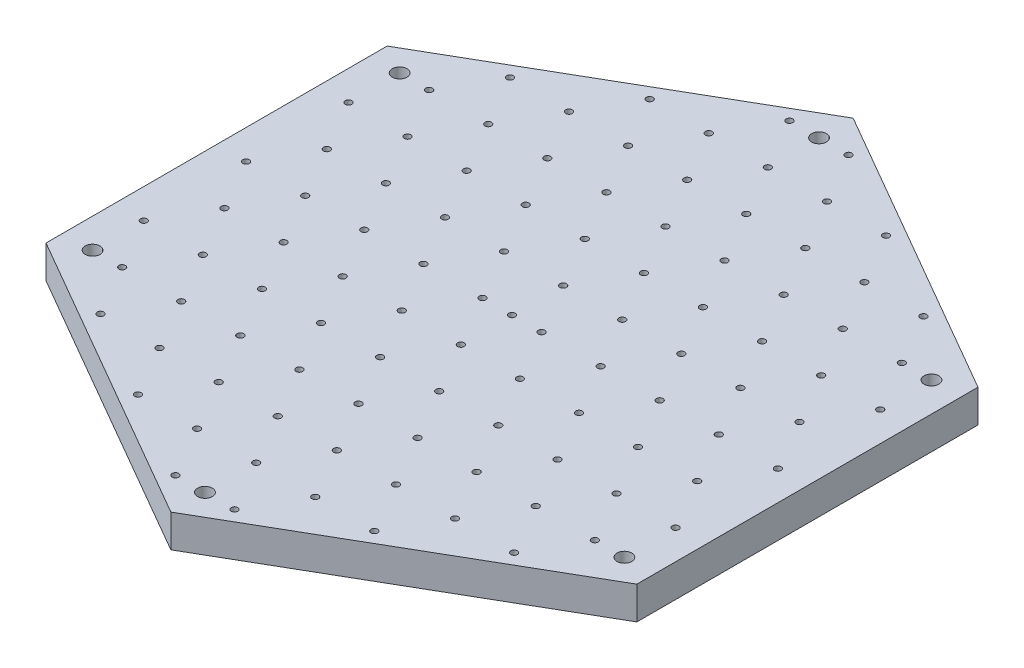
ISO-10303-21;
HEADER;
FILE_DESCRIPTION(('STEP AP214'),'2;1');
FILE_NAME('part.step','',(''),(''),'','','');
FILE_SCHEMA(('AUTOMOTIVE_DESIGN { 1 0 10303 214 1 1 1 1 }'));
ENDSEC;
DATA;
#1=APPLICATION_CONTEXT('core data for automotive mechanical design processes');
#2=APPLICATION_PROTOCOL_DEFINITION('international standard','automotive_design',2000,#1);
#3=PRODUCT_CONTEXT('',#1,'mechanical');
#4=PRODUCT('Part','Part','',(#3));
#5=PRODUCT_RELATED_PRODUCT_CATEGORY('part','',(#4));
#6=PRODUCT_DEFINITION_FORMATION('','',#4);
#7=PRODUCT_DEFINITION_CONTEXT('part definition',#1,'design');
#8=PRODUCT_DEFINITION('design','',#6,#7);
#9=PRODUCT_DEFINITION_SHAPE('','',#8);
#10=(LENGTH_UNIT() NAMED_UNIT(*) SI_UNIT(.MILLI.,.METRE.));
#11=(NAMED_UNIT(*) PLANE_ANGLE_UNIT() SI_UNIT($,.RADIAN.));
#12=(NAMED_UNIT(*) SI_UNIT($,.STERADIAN.) SOLID_ANGLE_UNIT());
#13=UNCERTAINTY_MEASURE_WITH_UNIT(LENGTH_MEASURE(1.E-05),#10,'distance_accuracy_value','');
#14=(GEOMETRIC_REPRESENTATION_CONTEXT(3) GLOBAL_UNCERTAINTY_ASSIGNED_CONTEXT((#13)) GLOBAL_UNIT_ASSIGNED_CONTEXT((#10,
#11,#12)) REPRESENTATION_CONTEXT('',''));
#15=CARTESIAN_POINT('',(0.,0.,0.));
#16=DIRECTION('',(0.,0.,1.));
#17=DIRECTION('',(1.,0.,0.));
#18=AXIS2_PLACEMENT_3D('',#15,#16,#17);
#19=CARTESIAN_POINT('',(54.1265877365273,6.,-31.25));
#20=DIRECTION('',(-0.5,0.,0.866025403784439));
#21=DIRECTION('',(0.866025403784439,0.,0.5));
#22=AXIS2_PLACEMENT_3D('',#19,#20,#21);
#23=PLANE('',#22);
#24=DIRECTION('',(-0.866025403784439,0.,-0.5));
#25=VECTOR('',#24,1.);
#26=CARTESIAN_POINT('',(54.1265877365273,0.,-31.25));
#27=LINE('',#26,#25);
#28=CARTESIAN_POINT('',(54.1265877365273,0.,-31.25));
#29=VERTEX_POINT('',#28);
#30=CARTESIAN_POINT('',(0.,0.,-62.5));
#31=VERTEX_POINT('',#30);
#32=EDGE_CURVE('E114',#29,#31,#27,.T.);
#33=ORIENTED_EDGE('',*,*,#32,.T.);
#34=DIRECTION('',(0.,-1.,0.));
#35=VECTOR('',#34,1.);
#36=CARTESIAN_POINT('',(0.,6.,-62.5));
#37=LINE('',#36,#35);
#38=CARTESIAN_POINT('',(0.,6.,-62.5));
#39=VERTEX_POINT('',#38);
#40=EDGE_CURVE('E11',#39,#31,#37,.T.);
#41=ORIENTED_EDGE('',*,*,#40,.F.);
#42=DIRECTION('',(-0.866025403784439,0.,-0.5));
#43=VECTOR('',#42,1.);
#44=CARTESIAN_POINT('',(54.1265877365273,6.,-31.25));
#45=LINE('',#44,#43);
#46=CARTESIAN_POINT('',(54.1265877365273,6.,-31.25));
#47=VERTEX_POINT('',#46);
#48=EDGE_CURVE('E81',#47,#39,#45,.T.);
#49=ORIENTED_EDGE('',*,*,#48,.F.);
#50=DIRECTION('',(0.,-1.,0.));
#51=VECTOR('',#50,1.);
#52=CARTESIAN_POINT('',(54.1265877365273,6.,-31.25));
#53=LINE('',#52,#51);
#54=EDGE_CURVE('E77',#47,#29,#53,.T.);
#55=ORIENTED_EDGE('',*,*,#54,.T.);
#56=EDGE_LOOP('',(#33,#41,#49,#55));
#57=FACE_BOUND('',#56,.T.);
#58=ADVANCED_FACE('F33',(#57),#23,.F.);
#59=CARTESIAN_POINT('',(0.,6.,-62.5));
#60=DIRECTION('',(0.5,0.,0.866025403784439));
#61=DIRECTION('',(0.866025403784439,0.,-0.5));
#62=AXIS2_PLACEMENT_3D('',#59,#60,#61);
#63=PLANE('',#62);
#64=DIRECTION('',(0.,-1.,0.));
#65=VECTOR('',#64,1.);
#66=CARTESIAN_POINT('',(-54.1265877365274,6.,-31.25));
#67=LINE('',#66,#65);
#68=CARTESIAN_POINT('',(-54.1265877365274,6.,-31.25));
#69=VERTEX_POINT('',#68);
#70=CARTESIAN_POINT('',(-54.1265877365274,0.,-31.25));
#71=VERTEX_POINT('',#70);
#72=EDGE_CURVE('E41',#69,#71,#67,.T.);
#73=ORIENTED_EDGE('',*,*,#72,.F.);
#74=DIRECTION('',(-0.866025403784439,0.,0.5));
#75=VECTOR('',#74,1.);
#76=CARTESIAN_POINT('',(0.,6.,-62.5));
#77=LINE('',#76,#75);
#78=EDGE_CURVE('E143',#39,#69,#77,.T.);
#79=ORIENTED_EDGE('',*,*,#78,.F.);
#80=ORIENTED_EDGE('',*,*,#40,.T.);
#81=DIRECTION('',(-0.866025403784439,0.,0.5));
#82=VECTOR('',#81,1.);
#83=CARTESIAN_POINT('',(0.,0.,-62.5));
#84=LINE('',#83,#82);
#85=EDGE_CURVE('E116',#31,#71,#84,.T.);
#86=ORIENTED_EDGE('',*,*,#85,.T.);
#87=EDGE_LOOP('',(#73,#79,#80,#86));
#88=FACE_BOUND('',#87,.T.);
#89=ADVANCED_FACE('F136',(#88),#63,.F.);
#90=CARTESIAN_POINT('',(-54.1265877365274,6.,-31.25));
#91=DIRECTION('',(1.,0.,0.));
#92=DIRECTION('',(0.,0.,-1.));
#93=AXIS2_PLACEMENT_3D('',#90,#91,#92);
#94=PLANE('',#93);
#95=DIRECTION('',(0.,-1.,0.));
#96=VECTOR('',#95,1.);
#97=CARTESIAN_POINT('',(-54.1265877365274,6.,31.25));
#98=LINE('',#97,#96);
#99=CARTESIAN_POINT('',(-54.1265877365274,6.,31.25));
#100=VERTEX_POINT('',#99);
#101=CARTESIAN_POINT('',(-54.1265877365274,0.,31.25));
#102=VERTEX_POINT('',#101);
#103=EDGE_CURVE('E107',#100,#102,#98,.T.);
#104=ORIENTED_EDGE('',*,*,#103,.F.);
#105=DIRECTION('',(0.,0.,1.));
#106=VECTOR('',#105,1.);
#107=CARTESIAN_POINT('',(-54.1265877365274,6.,-31.25));
#108=LINE('',#107,#106);
#109=EDGE_CURVE('E96',#69,#100,#108,.T.);
#110=ORIENTED_EDGE('',*,*,#109,.F.);
#111=ORIENTED_EDGE('',*,*,#72,.T.);
#112=DIRECTION('',(0.,0.,1.));
#113=VECTOR('',#112,1.);
#114=CARTESIAN_POINT('',(-54.1265877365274,0.,-31.25));
#115=LINE('',#114,#113);
#116=EDGE_CURVE('E120',#71,#102,#115,.T.);
#117=ORIENTED_EDGE('',*,*,#116,.T.);
#118=EDGE_LOOP('',(#104,#110,#111,#117));
#119=FACE_BOUND('',#118,.T.);
#120=ADVANCED_FACE('F132',(#119),#94,.F.);
#121=CARTESIAN_POINT('',(-54.1265877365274,6.,31.25));
#122=DIRECTION('',(0.5,0.,-0.866025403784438));
#123=DIRECTION('',(-0.866025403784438,0.,-0.5));
#124=AXIS2_PLACEMENT_3D('',#121,#122,#123);
#125=PLANE('',#124);
#126=DIRECTION('',(0.866025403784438,0.,0.5));
#127=VECTOR('',#126,1.);
#128=CARTESIAN_POINT('',(-54.1265877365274,0.,31.25));
#129=LINE('',#128,#127);
#130=CARTESIAN_POINT('',(0.,0.,62.5));
#131=VERTEX_POINT('',#130);
#132=EDGE_CURVE('E104',#102,#131,#129,.T.);
#133=ORIENTED_EDGE('',*,*,#132,.T.);
#134=DIRECTION('',(0.,-1.,0.));
#135=VECTOR('',#134,1.);
#136=CARTESIAN_POINT('',(0.,6.,62.5));
#137=LINE('',#136,#135);
#138=CARTESIAN_POINT('',(0.,6.,62.5));
#139=VERTEX_POINT('',#138);
#140=EDGE_CURVE('E101',#139,#131,#137,.T.);
#141=ORIENTED_EDGE('',*,*,#140,.F.);
#142=DIRECTION('',(0.866025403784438,0.,0.5));
#143=VECTOR('',#142,1.);
#144=CARTESIAN_POINT('',(-54.1265877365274,6.,31.25));
#145=LINE('',#144,#143);
#146=EDGE_CURVE('E89',#100,#139,#145,.T.);
#147=ORIENTED_EDGE('',*,*,#146,.F.);
#148=ORIENTED_EDGE('',*,*,#103,.T.);
#149=EDGE_LOOP('',(#133,#141,#147,#148));
#150=FACE_BOUND('',#149,.T.);
#151=ADVANCED_FACE('F102',(#150),#125,.F.);
#152=CARTESIAN_POINT('',(0.,6.,62.5));
#153=DIRECTION('',(-0.5,0.,-0.866025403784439));
#154=DIRECTION('',(-0.866025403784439,0.,0.5));
#155=AXIS2_PLACEMENT_3D('',#152,#153,#154);
#156=PLANE('',#155);
#157=DIRECTION('',(0.866025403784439,0.,-0.5));
#158=VECTOR('',#157,1.);
#159=CARTESIAN_POINT('',(0.,0.,62.5));
#160=LINE('',#159,#158);
#161=CARTESIAN_POINT('',(54.1265877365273,0.,31.25));
#162=VERTEX_POINT('',#161);
#163=EDGE_CURVE('E124',#131,#162,#160,.T.);
#164=ORIENTED_EDGE('',*,*,#163,.T.);
#165=DIRECTION('',(0.,-1.,0.));
#166=VECTOR('',#165,1.);
#167=CARTESIAN_POINT('',(54.1265877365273,6.,31.25));
#168=LINE('',#167,#166);
#169=CARTESIAN_POINT('',(54.1265877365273,6.,31.25));
#170=VERTEX_POINT('',#169);
#171=EDGE_CURVE('E70',#170,#162,#168,.T.);
#172=ORIENTED_EDGE('',*,*,#171,.F.);
#173=DIRECTION('',(0.866025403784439,0.,-0.5));
#174=VECTOR('',#173,1.);
#175=CARTESIAN_POINT('',(0.,6.,62.5));
#176=LINE('',#175,#174);
#177=EDGE_CURVE('E94',#139,#170,#176,.T.);
#178=ORIENTED_EDGE('',*,*,#177,.F.);
#179=ORIENTED_EDGE('',*,*,#140,.T.);
#180=EDGE_LOOP('',(#164,#172,#178,#179));
#181=FACE_BOUND('',#180,.T.);
#182=ADVANCED_FACE('F109',(#181),#156,.F.);
#183=CARTESIAN_POINT('',(54.1265877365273,6.,31.25));
#184=DIRECTION('',(-1.,0.,0.));
#185=DIRECTION('',(0.,0.,1.));
#186=AXIS2_PLACEMENT_3D('',#183,#184,#185);
#187=PLANE('',#186);
#188=ORIENTED_EDGE('',*,*,#54,.F.);
#189=DIRECTION('',(0.,0.,-1.));
#190=VECTOR('',#189,1.);
#191=CARTESIAN_POINT('',(54.1265877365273,6.,31.25));
#192=LINE('',#191,#190);
#193=EDGE_CURVE('E49',#170,#47,#192,.T.);
#194=ORIENTED_EDGE('',*,*,#193,.F.);
#195=ORIENTED_EDGE('',*,*,#171,.T.);
#196=DIRECTION('',(0.,0.,-1.));
#197=VECTOR('',#196,1.);
#198=CARTESIAN_POINT('',(54.1265877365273,0.,31.25));
#199=LINE('',#198,#197);
#200=EDGE_CURVE('E126',#162,#29,#199,.T.);
#201=ORIENTED_EDGE('',*,*,#200,.T.);
#202=EDGE_LOOP('',(#188,#194,#195,#201));
#203=FACE_BOUND('',#202,.T.);
#204=ADVANCED_FACE('F142',(#203),#187,.F.);
#205=CARTESIAN_POINT('',(0.,6.,0.));
#206=DIRECTION('',(0.,1.,0.));
#207=DIRECTION('',(0.,0.,1.));
#208=AXIS2_PLACEMENT_3D('',#205,#206,#207);
#209=PLANE('',#208);
#210=CARTESIAN_POINT('',(48.71385,6.,-18.7499696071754));
#211=DIRECTION('',(0.,1.,0.));
#212=DIRECTION('',(0.,0.,1.));
#213=AXIS2_PLACEMENT_3D('',#210,#211,#212);
#214=CIRCLE('',#213,0.599999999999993);
#215=CARTESIAN_POINT('',(48.71385,6.,-18.1499696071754));
#216=VERTEX_POINT('',#215);
#217=EDGE_CURVE('E759',#216,#216,#214,.T.);
#218=ORIENTED_EDGE('',*,*,#217,.F.);
#219=EDGE_LOOP('',(#218));
#220=FACE_BOUND('',#219,.T.);
#221=CARTESIAN_POINT('',(43.3012,6.,-28.1249544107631));
#222=DIRECTION('',(0.,1.,0.));
#223=DIRECTION('',(0.,0.,1.));
#224=AXIS2_PLACEMENT_3D('',#221,#222,#223);
#225=CIRCLE('',#224,0.6);
#226=CARTESIAN_POINT('',(43.3012,6.,-27.5249544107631));
#227=VERTEX_POINT('',#226);
#228=EDGE_CURVE('E753',#227,#227,#225,.T.);
#229=ORIENTED_EDGE('',*,*,#228,.F.);
#230=EDGE_LOOP('',(#229));
#231=FACE_BOUND('',#230,.T.);
#232=CARTESIAN_POINT('',(37.88855,6.,-37.4999392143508));
#233=DIRECTION('',(0.,1.,0.));
#234=DIRECTION('',(0.,0.,1.));
#235=AXIS2_PLACEMENT_3D('',#232,#233,#234);
#236=CIRCLE('',#235,0.6);
#237=CARTESIAN_POINT('',(37.88855,6.,-36.8999392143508));
#238=VERTEX_POINT('',#237);
#239=EDGE_CURVE('E747',#238,#238,#236,.T.);
#240=ORIENTED_EDGE('',*,*,#239,.F.);
#241=EDGE_LOOP('',(#240));
#242=FACE_BOUND('',#241,.T.);
#243=CARTESIAN_POINT('',(-21.6506,6.,46.8749240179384));
#244=DIRECTION('',(0.,1.,0.));
#245=DIRECTION('',(0.,0.,1.));
#246=AXIS2_PLACEMENT_3D('',#243,#244,#245);
#247=CIRCLE('',#246,0.600000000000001);
#248=CARTESIAN_POINT('',(-21.6506,6.,47.4749240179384));
#249=VERTEX_POINT('',#248);
#250=EDGE_CURVE('E741',#249,#249,#247,.T.);
#251=ORIENTED_EDGE('',*,*,#250,.F.);
#252=EDGE_LOOP('',(#251));
#253=FACE_BOUND('',#252,.T.);
#254=CARTESIAN_POINT('',(-5.41265000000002,6.,56.2499088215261));
#255=DIRECTION('',(0.,1.,0.));
#256=DIRECTION('',(0.,0.,1.));
#257=AXIS2_PLACEMENT_3D('',#254,#255,#256);
#258=CIRCLE('',#257,0.600000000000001);
#259=CARTESIAN_POINT('',(-5.41265000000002,6.,56.8499088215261));
#260=VERTEX_POINT('',#259);
#261=EDGE_CURVE('E735',#260,#260,#258,.T.);
#262=ORIENTED_EDGE('',*,*,#261,.F.);
#263=EDGE_LOOP('',(#262));
#264=FACE_BOUND('',#263,.T.);
#265=CARTESIAN_POINT('',(-10.8253,6.,46.8749240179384));
#266=DIRECTION('',(0.,1.,0.));
#267=DIRECTION('',(0.,0.,1.));
#268=AXIS2_PLACEMENT_3D('',#265,#266,#267);
#269=CIRCLE('',#268,0.600000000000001);
#270=CARTESIAN_POINT('',(-10.8253,6.,47.4749240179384));
#271=VERTEX_POINT('',#270);
#272=EDGE_CURVE('E729',#271,#271,#269,.T.);
#273=ORIENTED_EDGE('',*,*,#272,.F.);
#274=EDGE_LOOP('',(#273));
#275=FACE_BOUND('',#274,.T.);
#276=CARTESIAN_POINT('',(-16.23795,6.,37.4999392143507));
#277=DIRECTION('',(0.,1.,0.));
#278=DIRECTION('',(0.,0.,1.));
#279=AXIS2_PLACEMENT_3D('',#276,#277,#278);
#280=CIRCLE('',#279,0.600000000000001);
#281=CARTESIAN_POINT('',(-16.23795,6.,38.0999392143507));
#282=VERTEX_POINT('',#281);
#283=EDGE_CURVE('E723',#282,#282,#280,.T.);
#284=ORIENTED_EDGE('',*,*,#283,.F.);
#285=EDGE_LOOP('',(#284));
#286=FACE_BOUND('',#285,.T.);
#287=CARTESIAN_POINT('',(-48.71385,6.,-18.7499696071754));
#288=DIRECTION('',(0.,1.,0.));
#289=DIRECTION('',(0.,0.,1.));
#290=AXIS2_PLACEMENT_3D('',#287,#288,#289);
#291=CIRCLE('',#290,0.600000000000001);
#292=CARTESIAN_POINT('',(-48.71385,6.,-18.1499696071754));
#293=VERTEX_POINT('',#292);
#294=EDGE_CURVE('E717',#293,#293,#291,.T.);
#295=ORIENTED_EDGE('',*,*,#294,.F.);
#296=EDGE_LOOP('',(#295));
#297=FACE_BOUND('',#296,.T.);
#298=CARTESIAN_POINT('',(5.41264999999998,6.,56.2499088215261));
#299=DIRECTION('',(0.,1.,0.));
#300=DIRECTION('',(0.,0.,1.));
#301=AXIS2_PLACEMENT_3D('',#298,#299,#300);
#302=CIRCLE('',#301,0.6);
#303=CARTESIAN_POINT('',(5.41264999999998,6.,56.8499088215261));
#304=VERTEX_POINT('',#303);
#305=EDGE_CURVE('E711',#304,#304,#302,.T.);
#306=ORIENTED_EDGE('',*,*,#305,.F.);
#307=EDGE_LOOP('',(#306));
#308=FACE_BOUND('',#307,.T.);
#309=CARTESIAN_POINT('',(0.,6.,46.8749240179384));
#310=DIRECTION('',(0.,1.,0.));
#311=DIRECTION('',(0.,0.,1.));
#312=AXIS2_PLACEMENT_3D('',#309,#310,#311);
#313=CIRCLE('',#312,0.6);
#314=CARTESIAN_POINT('',(0.,6.,47.4749240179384));
#315=VERTEX_POINT('',#314);
#316=EDGE_CURVE('E705',#315,#315,#313,.T.);
#317=ORIENTED_EDGE('',*,*,#316,.F.);
#318=EDGE_LOOP('',(#317));
#319=FACE_BOUND('',#318,.T.);
#320=CARTESIAN_POINT('',(-5.41265000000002,6.,37.4999392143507));
#321=DIRECTION('',(0.,1.,0.));
#322=DIRECTION('',(0.,0.,1.));
#323=AXIS2_PLACEMENT_3D('',#320,#321,#322);
#324=CIRCLE('',#323,0.6);
#325=CARTESIAN_POINT('',(-5.41265000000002,6.,38.0999392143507));
#326=VERTEX_POINT('',#325);
#327=EDGE_CURVE('E699',#326,#326,#324,.T.);
#328=ORIENTED_EDGE('',*,*,#327,.F.);
#329=EDGE_LOOP('',(#328));
#330=FACE_BOUND('',#329,.T.);
#331=CARTESIAN_POINT('',(-10.8253,6.,28.124954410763));
#332=DIRECTION('',(0.,1.,0.));
#333=DIRECTION('',(0.,0.,1.));
#334=AXIS2_PLACEMENT_3D('',#331,#332,#333);
#335=CIRCLE('',#334,0.6);
#336=CARTESIAN_POINT('',(-10.8253,6.,28.7249544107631));
#337=VERTEX_POINT('',#336);
#338=EDGE_CURVE('E693',#337,#337,#335,.T.);
#339=ORIENTED_EDGE('',*,*,#338,.F.);
#340=EDGE_LOOP('',(#339));
#341=FACE_BOUND('',#340,.T.);
#342=CARTESIAN_POINT('',(-43.3012,6.,-28.1249544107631));
#343=DIRECTION('',(0.,1.,0.));
#344=DIRECTION('',(0.,0.,1.));
#345=AXIS2_PLACEMENT_3D('',#342,#343,#344);
#346=CIRCLE('',#345,0.6);
#347=CARTESIAN_POINT('',(-43.3012,6.,-27.5249544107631));
#348=VERTEX_POINT('',#347);
#349=EDGE_CURVE('E687',#348,#348,#346,.T.);
#350=ORIENTED_EDGE('',*,*,#349,.F.);
#351=EDGE_LOOP('',(#350));
#352=FACE_BOUND('',#351,.T.);
#353=CARTESIAN_POINT('',(10.8253,6.,46.8749240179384));
#354=DIRECTION('',(0.,1.,0.));
#355=DIRECTION('',(0.,0.,1.));
#356=AXIS2_PLACEMENT_3D('',#353,#354,#355);
#357=CIRCLE('',#356,0.6);
#358=CARTESIAN_POINT('',(10.8253,6.,47.4749240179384));
#359=VERTEX_POINT('',#358);
#360=EDGE_CURVE('E681',#359,#359,#357,.T.);
#361=ORIENTED_EDGE('',*,*,#360,.F.);
#362=EDGE_LOOP('',(#361));
#363=FACE_BOUND('',#362,.T.);
#364=CARTESIAN_POINT('',(5.41264999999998,6.,37.4999392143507));
#365=DIRECTION('',(0.,1.,0.));
#366=DIRECTION('',(0.,0.,1.));
#367=AXIS2_PLACEMENT_3D('',#364,#365,#366);
#368=CIRCLE('',#367,0.6);
#369=CARTESIAN_POINT('',(5.41264999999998,6.,38.0999392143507));
#370=VERTEX_POINT('',#369);
#371=EDGE_CURVE('E675',#370,#370,#368,.T.);
#372=ORIENTED_EDGE('',*,*,#371,.F.);
#373=EDGE_LOOP('',(#372));
#374=FACE_BOUND('',#373,.T.);
#375=CARTESIAN_POINT('',(0.,6.,28.124954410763));
#376=DIRECTION('',(0.,1.,0.));
#377=DIRECTION('',(0.,0.,1.));
#378=AXIS2_PLACEMENT_3D('',#375,#376,#377);
#379=CIRCLE('',#378,0.6);
#380=CARTESIAN_POINT('',(0.,6.,28.7249544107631));
#381=VERTEX_POINT('',#380);
#382=EDGE_CURVE('E669',#381,#381,#379,.T.);
#383=ORIENTED_EDGE('',*,*,#382,.F.);
#384=EDGE_LOOP('',(#383));
#385=FACE_BOUND('',#384,.T.);
#386=CARTESIAN_POINT('',(-5.41265000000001,6.,18.7499696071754));
#387=DIRECTION('',(0.,1.,0.));
#388=DIRECTION('',(0.,0.,1.));
#389=AXIS2_PLACEMENT_3D('',#386,#387,#388);
#390=CIRCLE('',#389,0.6);
#391=CARTESIAN_POINT('',(-5.41265000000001,6.,19.3499696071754));
#392=VERTEX_POINT('',#391);
#393=EDGE_CURVE('E663',#392,#392,#390,.T.);
#394=ORIENTED_EDGE('',*,*,#393,.F.);
#395=EDGE_LOOP('',(#394));
#396=FACE_BOUND('',#395,.T.);
#397=CARTESIAN_POINT('',(-37.88855,6.,-37.4999392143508));
#398=DIRECTION('',(0.,1.,0.));
#399=DIRECTION('',(0.,0.,1.));
#400=AXIS2_PLACEMENT_3D('',#397,#398,#399);
#401=CIRCLE('',#400,0.6);
#402=CARTESIAN_POINT('',(-37.88855,6.,-36.8999392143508));
#403=VERTEX_POINT('',#402);
#404=EDGE_CURVE('E657',#403,#403,#401,.T.);
#405=ORIENTED_EDGE('',*,*,#404,.F.);
#406=EDGE_LOOP('',(#405));
#407=FACE_BOUND('',#406,.T.);
#408=CARTESIAN_POINT('',(21.6506,6.,46.8749240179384));
#409=DIRECTION('',(0.,1.,0.));
#410=DIRECTION('',(0.,0.,1.));
#411=AXIS2_PLACEMENT_3D('',#408,#409,#410);
#412=CIRCLE('',#411,0.6);
#413=CARTESIAN_POINT('',(21.6506,6.,47.4749240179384));
#414=VERTEX_POINT('',#413);
#415=EDGE_CURVE('E651',#414,#414,#412,.T.);
#416=ORIENTED_EDGE('',*,*,#415,.F.);
#417=EDGE_LOOP('',(#416));
#418=FACE_BOUND('',#417,.T.);
#419=CARTESIAN_POINT('',(16.23795,6.,37.4999392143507));
#420=DIRECTION('',(0.,1.,0.));
#421=DIRECTION('',(0.,0.,1.));
#422=AXIS2_PLACEMENT_3D('',#419,#420,#421);
#423=CIRCLE('',#422,0.6);
#424=CARTESIAN_POINT('',(16.23795,6.,38.0999392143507));
#425=VERTEX_POINT('',#424);
#426=EDGE_CURVE('E645',#425,#425,#423,.T.);
#427=ORIENTED_EDGE('',*,*,#426,.F.);
#428=EDGE_LOOP('',(#427));
#429=FACE_BOUND('',#428,.T.);
#430=CARTESIAN_POINT('',(10.8253,6.,28.124954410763));
#431=DIRECTION('',(0.,1.,0.));
#432=DIRECTION('',(0.,0.,1.));
#433=AXIS2_PLACEMENT_3D('',#430,#431,#432);
#434=CIRCLE('',#433,0.6);
#435=CARTESIAN_POINT('',(10.8253,6.,28.7249544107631));
#436=VERTEX_POINT('',#435);
#437=EDGE_CURVE('E639',#436,#436,#434,.T.);
#438=ORIENTED_EDGE('',*,*,#437,.F.);
#439=EDGE_LOOP('',(#438));
#440=FACE_BOUND('',#439,.T.);
#441=CARTESIAN_POINT('',(5.41264999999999,6.,18.7499696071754));
#442=DIRECTION('',(0.,1.,0.));
#443=DIRECTION('',(0.,0.,1.));
#444=AXIS2_PLACEMENT_3D('',#441,#442,#443);
#445=CIRCLE('',#444,0.6);
#446=CARTESIAN_POINT('',(5.41264999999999,6.,19.3499696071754));
#447=VERTEX_POINT('',#446);
#448=EDGE_CURVE('E633',#447,#447,#445,.T.);
#449=ORIENTED_EDGE('',*,*,#448,.F.);
#450=EDGE_LOOP('',(#449));
#451=FACE_BOUND('',#450,.T.);
#452=CARTESIAN_POINT('',(0.,6.,9.37498480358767));
#453=DIRECTION('',(0.,1.,0.));
#454=DIRECTION('',(0.,0.,1.));
#455=AXIS2_PLACEMENT_3D('',#452,#453,#454);
#456=CIRCLE('',#455,0.6);
#457=CARTESIAN_POINT('',(0.,6.,9.97498480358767));
#458=VERTEX_POINT('',#457);
#459=EDGE_CURVE('E627',#458,#458,#456,.T.);
#460=ORIENTED_EDGE('',*,*,#459,.F.);
#461=EDGE_LOOP('',(#460));
#462=FACE_BOUND('',#461,.T.);
#463=CARTESIAN_POINT('',(-27.06325,6.,-37.4999392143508));
#464=DIRECTION('',(0.,1.,0.));
#465=DIRECTION('',(0.,0.,1.));
#466=AXIS2_PLACEMENT_3D('',#463,#464,#465);
#467=CIRCLE('',#466,0.600000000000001);
#468=CARTESIAN_POINT('',(-27.06325,6.,-36.8999392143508));
#469=VERTEX_POINT('',#468);
#470=EDGE_CURVE('E621',#469,#469,#467,.T.);
#471=ORIENTED_EDGE('',*,*,#470,.F.);
#472=EDGE_LOOP('',(#471));
#473=FACE_BOUND('',#472,.T.);
#474=CARTESIAN_POINT('',(-32.4759,6.,-28.1249544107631));
#475=DIRECTION('',(0.,1.,0.));
#476=DIRECTION('',(0.,0.,1.));
#477=AXIS2_PLACEMENT_3D('',#474,#475,#476);
#478=CIRCLE('',#477,0.600000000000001);
#479=CARTESIAN_POINT('',(-32.4759,6.,-27.5249544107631));
#480=VERTEX_POINT('',#479);
#481=EDGE_CURVE('E615',#480,#480,#478,.T.);
#482=ORIENTED_EDGE('',*,*,#481,.F.);
#483=EDGE_LOOP('',(#482));
#484=FACE_BOUND('',#483,.T.);
#485=CARTESIAN_POINT('',(-37.88855,6.,-18.7499696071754));
#486=DIRECTION('',(0.,1.,0.));
#487=DIRECTION('',(0.,0.,1.));
#488=AXIS2_PLACEMENT_3D('',#485,#486,#487);
#489=CIRCLE('',#488,0.600000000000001);
#490=CARTESIAN_POINT('',(-37.88855,6.,-18.1499696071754));
#491=VERTEX_POINT('',#490);
#492=EDGE_CURVE('E609',#491,#491,#489,.T.);
#493=ORIENTED_EDGE('',*,*,#492,.F.);
#494=EDGE_LOOP('',(#493));
#495=FACE_BOUND('',#494,.T.);
#496=CARTESIAN_POINT('',(-43.3012,6.,-9.3749848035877));
#497=DIRECTION('',(0.,1.,0.));
#498=DIRECTION('',(0.,0.,1.));
#499=AXIS2_PLACEMENT_3D('',#496,#497,#498);
#500=CIRCLE('',#499,0.600000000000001);
#501=CARTESIAN_POINT('',(-43.3012,6.,-8.7749848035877));
#502=VERTEX_POINT('',#501);
#503=EDGE_CURVE('E603',#502,#502,#500,.T.);
#504=ORIENTED_EDGE('',*,*,#503,.F.);
#505=EDGE_LOOP('',(#504));
#506=FACE_BOUND('',#505,.T.);
#507=CARTESIAN_POINT('',(-21.6506,6.,-28.1249544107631));
#508=DIRECTION('',(0.,1.,0.));
#509=DIRECTION('',(0.,0.,1.));
#510=AXIS2_PLACEMENT_3D('',#507,#508,#509);
#511=CIRCLE('',#510,0.600000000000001);
#512=CARTESIAN_POINT('',(-21.6506,6.,-27.5249544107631));
#513=VERTEX_POINT('',#512);
#514=EDGE_CURVE('E597',#513,#513,#511,.T.);
#515=ORIENTED_EDGE('',*,*,#514,.F.);
#516=EDGE_LOOP('',(#515));
#517=FACE_BOUND('',#516,.T.);
#518=CARTESIAN_POINT('',(-27.06325,6.,-18.7499696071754));
#519=DIRECTION('',(0.,1.,0.));
#520=DIRECTION('',(0.,0.,1.));
#521=AXIS2_PLACEMENT_3D('',#518,#519,#520);
#522=CIRCLE('',#521,0.600000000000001);
#523=CARTESIAN_POINT('',(-27.06325,6.,-18.1499696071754));
#524=VERTEX_POINT('',#523);
#525=EDGE_CURVE('E591',#524,#524,#522,.T.);
#526=ORIENTED_EDGE('',*,*,#525,.F.);
#527=EDGE_LOOP('',(#526));
#528=FACE_BOUND('',#527,.T.);
#529=CARTESIAN_POINT('',(-32.4759,6.,-9.3749848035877));
#530=DIRECTION('',(0.,1.,0.));
#531=DIRECTION('',(0.,0.,1.));
#532=AXIS2_PLACEMENT_3D('',#529,#530,#531);
#533=CIRCLE('',#532,0.600000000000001);
#534=CARTESIAN_POINT('',(-32.4759,6.,-8.7749848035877));
#535=VERTEX_POINT('',#534);
#536=EDGE_CURVE('E585',#535,#535,#533,.T.);
#537=ORIENTED_EDGE('',*,*,#536,.F.);
#538=EDGE_LOOP('',(#537));
#539=FACE_BOUND('',#538,.T.);
#540=CARTESIAN_POINT('',(-48.71385,6.,18.7499696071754));
#541=DIRECTION('',(0.,1.,0.));
#542=DIRECTION('',(0.,0.,1.));
#543=AXIS2_PLACEMENT_3D('',#540,#541,#542);
#544=CIRCLE('',#543,0.600000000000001);
#545=CARTESIAN_POINT('',(-48.71385,6.,19.3499696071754));
#546=VERTEX_POINT('',#545);
#547=EDGE_CURVE('E579',#546,#546,#544,.T.);
#548=ORIENTED_EDGE('',*,*,#547,.F.);
#549=EDGE_LOOP('',(#548));
#550=FACE_BOUND('',#549,.T.);
#551=CARTESIAN_POINT('',(-43.3012,6.,9.37498480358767));
#552=DIRECTION('',(0.,1.,0.));
#553=DIRECTION('',(0.,0.,1.));
#554=AXIS2_PLACEMENT_3D('',#551,#552,#553);
#555=CIRCLE('',#554,0.600000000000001);
#556=CARTESIAN_POINT('',(-43.3012,6.,9.97498480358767));
#557=VERTEX_POINT('',#556);
#558=EDGE_CURVE('E573',#557,#557,#555,.T.);
#559=ORIENTED_EDGE('',*,*,#558,.F.);
#560=EDGE_LOOP('',(#559));
#561=FACE_BOUND('',#560,.T.);
#562=CARTESIAN_POINT('',(-43.3012,6.,28.124954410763));
#563=DIRECTION('',(0.,1.,0.));
#564=DIRECTION('',(0.,0.,1.));
#565=AXIS2_PLACEMENT_3D('',#562,#563,#564);
#566=CIRCLE('',#565,0.6);
#567=CARTESIAN_POINT('',(-43.3012,6.,28.7249544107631));
#568=VERTEX_POINT('',#567);
#569=EDGE_CURVE('E567',#568,#568,#566,.T.);
#570=ORIENTED_EDGE('',*,*,#569,.F.);
#571=EDGE_LOOP('',(#570));
#572=FACE_BOUND('',#571,.T.);
#573=CARTESIAN_POINT('',(-37.88855,6.,18.7499696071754));
#574=DIRECTION('',(0.,1.,0.));
#575=DIRECTION('',(0.,0.,1.));
#576=AXIS2_PLACEMENT_3D('',#573,#574,#575);
#577=CIRCLE('',#576,0.6);
#578=CARTESIAN_POINT('',(-37.88855,6.,19.3499696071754));
#579=VERTEX_POINT('',#578);
#580=EDGE_CURVE('E561',#579,#579,#577,.T.);
#581=ORIENTED_EDGE('',*,*,#580,.F.);
#582=EDGE_LOOP('',(#581));
#583=FACE_BOUND('',#582,.T.);
#584=CARTESIAN_POINT('',(-32.4759,6.,9.37498480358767));
#585=DIRECTION('',(0.,1.,0.));
#586=DIRECTION('',(0.,0.,1.));
#587=AXIS2_PLACEMENT_3D('',#584,#585,#586);
#588=CIRCLE('',#587,0.6);
#589=CARTESIAN_POINT('',(-32.4759,6.,9.97498480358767));
#590=VERTEX_POINT('',#589);
#591=EDGE_CURVE('E555',#590,#590,#588,.T.);
#592=ORIENTED_EDGE('',*,*,#591,.F.);
#593=EDGE_LOOP('',(#592));
#594=FACE_BOUND('',#593,.T.);
#595=CARTESIAN_POINT('',(-16.23795,6.,-18.7499696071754));
#596=DIRECTION('',(0.,1.,0.));
#597=DIRECTION('',(0.,0.,1.));
#598=AXIS2_PLACEMENT_3D('',#595,#596,#597);
#599=CIRCLE('',#598,0.6);
#600=CARTESIAN_POINT('',(-16.23795,6.,-18.1499696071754));
#601=VERTEX_POINT('',#600);
#602=EDGE_CURVE('E549',#601,#601,#599,.T.);
#603=ORIENTED_EDGE('',*,*,#602,.F.);
#604=EDGE_LOOP('',(#603));
#605=FACE_BOUND('',#604,.T.);
#606=CARTESIAN_POINT('',(-21.6506,6.,-9.3749848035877));
#607=DIRECTION('',(0.,1.,0.));
#608=DIRECTION('',(0.,0.,1.));
#609=AXIS2_PLACEMENT_3D('',#606,#607,#608);
#610=CIRCLE('',#609,0.6);
#611=CARTESIAN_POINT('',(-21.6506,6.,-8.7749848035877));
#612=VERTEX_POINT('',#611);
#613=EDGE_CURVE('E543',#612,#612,#610,.T.);
#614=ORIENTED_EDGE('',*,*,#613,.F.);
#615=EDGE_LOOP('',(#614));
#616=FACE_BOUND('',#615,.T.);
#617=CARTESIAN_POINT('',(-37.88855,6.,37.4999392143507));
#618=DIRECTION('',(0.,1.,0.));
#619=DIRECTION('',(0.,0.,1.));
#620=AXIS2_PLACEMENT_3D('',#617,#618,#619);
#621=CIRCLE('',#620,0.6);
#622=CARTESIAN_POINT('',(-37.88855,6.,38.0999392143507));
#623=VERTEX_POINT('',#622);
#624=EDGE_CURVE('E537',#623,#623,#621,.T.);
#625=ORIENTED_EDGE('',*,*,#624,.F.);
#626=EDGE_LOOP('',(#625));
#627=FACE_BOUND('',#626,.T.);
#628=CARTESIAN_POINT('',(-32.4759,6.,28.124954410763));
#629=DIRECTION('',(0.,1.,0.));
#630=DIRECTION('',(0.,0.,1.));
#631=AXIS2_PLACEMENT_3D('',#628,#629,#630);
#632=CIRCLE('',#631,0.6);
#633=CARTESIAN_POINT('',(-32.4759,6.,28.7249544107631));
#634=VERTEX_POINT('',#633);
#635=EDGE_CURVE('E531',#634,#634,#632,.T.);
#636=ORIENTED_EDGE('',*,*,#635,.F.);
#637=EDGE_LOOP('',(#636));
#638=FACE_BOUND('',#637,.T.);
#639=CARTESIAN_POINT('',(-27.06325,6.,18.7499696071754));
#640=DIRECTION('',(0.,1.,0.));
#641=DIRECTION('',(0.,0.,1.));
#642=AXIS2_PLACEMENT_3D('',#639,#640,#641);
#643=CIRCLE('',#642,0.6);
#644=CARTESIAN_POINT('',(-27.06325,6.,19.3499696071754));
#645=VERTEX_POINT('',#644);
#646=EDGE_CURVE('E525',#645,#645,#643,.T.);
#647=ORIENTED_EDGE('',*,*,#646,.F.);
#648=EDGE_LOOP('',(#647));
#649=FACE_BOUND('',#648,.T.);
#650=CARTESIAN_POINT('',(-21.6506,6.,9.37498480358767));
#651=DIRECTION('',(0.,1.,0.));
#652=DIRECTION('',(0.,0.,1.));
#653=AXIS2_PLACEMENT_3D('',#650,#651,#652);
#654=CIRCLE('',#653,0.6);
#655=CARTESIAN_POINT('',(-21.6506,6.,9.97498480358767));
#656=VERTEX_POINT('',#655);
#657=EDGE_CURVE('E519',#656,#656,#654,.T.);
#658=ORIENTED_EDGE('',*,*,#657,.F.);
#659=EDGE_LOOP('',(#658));
#660=FACE_BOUND('',#659,.T.);
#661=CARTESIAN_POINT('',(-10.8253,6.,-9.3749848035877));
#662=DIRECTION('',(0.,1.,0.));
#663=DIRECTION('',(0.,0.,1.));
#664=AXIS2_PLACEMENT_3D('',#661,#662,#663);
#665=CIRCLE('',#664,0.6);
#666=CARTESIAN_POINT('',(-10.8253,6.,-8.7749848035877));
#667=VERTEX_POINT('',#666);
#668=EDGE_CURVE('E513',#667,#667,#665,.T.);
#669=ORIENTED_EDGE('',*,*,#668,.F.);
#670=EDGE_LOOP('',(#669));
#671=FACE_BOUND('',#670,.T.);
#672=CARTESIAN_POINT('',(-27.06325,6.,37.4999392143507));
#673=DIRECTION('',(0.,1.,0.));
#674=DIRECTION('',(0.,0.,1.));
#675=AXIS2_PLACEMENT_3D('',#672,#673,#674);
#676=CIRCLE('',#675,0.6);
#677=CARTESIAN_POINT('',(-27.06325,6.,38.0999392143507));
#678=VERTEX_POINT('',#677);
#679=EDGE_CURVE('E507',#678,#678,#676,.T.);
#680=ORIENTED_EDGE('',*,*,#679,.F.);
#681=EDGE_LOOP('',(#680));
#682=FACE_BOUND('',#681,.T.);
#683=CARTESIAN_POINT('',(-21.6506,6.,28.124954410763));
#684=DIRECTION('',(0.,1.,0.));
#685=DIRECTION('',(0.,0.,1.));
#686=AXIS2_PLACEMENT_3D('',#683,#684,#685);
#687=CIRCLE('',#686,0.6);
#688=CARTESIAN_POINT('',(-21.6506,6.,28.7249544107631));
#689=VERTEX_POINT('',#688);
#690=EDGE_CURVE('E501',#689,#689,#687,.T.);
#691=ORIENTED_EDGE('',*,*,#690,.F.);
#692=EDGE_LOOP('',(#691));
#693=FACE_BOUND('',#692,.T.);
#694=CARTESIAN_POINT('',(-16.23795,6.,18.7499696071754));
#695=DIRECTION('',(0.,1.,0.));
#696=DIRECTION('',(0.,0.,1.));
#697=AXIS2_PLACEMENT_3D('',#694,#695,#696);
#698=CIRCLE('',#697,0.6);
#699=CARTESIAN_POINT('',(-16.23795,6.,19.3499696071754));
#700=VERTEX_POINT('',#699);
#701=EDGE_CURVE('E495',#700,#700,#698,.T.);
#702=ORIENTED_EDGE('',*,*,#701,.F.);
#703=EDGE_LOOP('',(#702));
#704=FACE_BOUND('',#703,.T.);
#705=CARTESIAN_POINT('',(-10.8253,6.,9.37498480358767));
#706=DIRECTION('',(0.,1.,0.));
#707=DIRECTION('',(0.,0.,1.));
#708=AXIS2_PLACEMENT_3D('',#705,#706,#707);
#709=CIRCLE('',#708,0.6);
#710=CARTESIAN_POINT('',(-10.8253,6.,9.97498480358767));
#711=VERTEX_POINT('',#710);
#712=EDGE_CURVE('E489',#711,#711,#709,.T.);
#713=ORIENTED_EDGE('',*,*,#712,.F.);
#714=EDGE_LOOP('',(#713));
#715=FACE_BOUND('',#714,.T.);
#716=CARTESIAN_POINT('',(21.6506,6.,-46.8749240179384));
#717=DIRECTION('',(0.,1.,0.));
#718=DIRECTION('',(0.,0.,1.));
#719=AXIS2_PLACEMENT_3D('',#716,#717,#718);
#720=CIRCLE('',#719,0.600000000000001);
#721=CARTESIAN_POINT('',(21.6506,6.,-46.2749240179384));
#722=VERTEX_POINT('',#721);
#723=EDGE_CURVE('E483',#722,#722,#720,.T.);
#724=ORIENTED_EDGE('',*,*,#723,.F.);
#725=EDGE_LOOP('',(#724));
#726=FACE_BOUND('',#725,.T.);
#727=CARTESIAN_POINT('',(27.06325,6.,-37.4999392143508));
#728=DIRECTION('',(0.,1.,0.));
#729=DIRECTION('',(0.,0.,1.));
#730=AXIS2_PLACEMENT_3D('',#727,#728,#729);
#731=CIRCLE('',#730,0.600000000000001);
#732=CARTESIAN_POINT('',(27.06325,6.,-36.8999392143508));
#733=VERTEX_POINT('',#732);
#734=EDGE_CURVE('E477',#733,#733,#731,.T.);
#735=ORIENTED_EDGE('',*,*,#734,.F.);
#736=EDGE_LOOP('',(#735));
#737=FACE_BOUND('',#736,.T.);
#738=CARTESIAN_POINT('',(32.4759,6.,-28.1249544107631));
#739=DIRECTION('',(0.,1.,0.));
#740=DIRECTION('',(0.,0.,1.));
#741=AXIS2_PLACEMENT_3D('',#738,#739,#740);
#742=CIRCLE('',#741,0.600000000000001);
#743=CARTESIAN_POINT('',(32.4759,6.,-27.5249544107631));
#744=VERTEX_POINT('',#743);
#745=EDGE_CURVE('E471',#744,#744,#742,.T.);
#746=ORIENTED_EDGE('',*,*,#745,.F.);
#747=EDGE_LOOP('',(#746));
#748=FACE_BOUND('',#747,.T.);
#749=CARTESIAN_POINT('',(37.88855,6.,-18.7499696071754));
#750=DIRECTION('',(0.,1.,0.));
#751=DIRECTION('',(0.,0.,1.));
#752=AXIS2_PLACEMENT_3D('',#749,#750,#751);
#753=CIRCLE('',#752,0.600000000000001);
#754=CARTESIAN_POINT('',(37.88855,6.,-18.1499696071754));
#755=VERTEX_POINT('',#754);
#756=EDGE_CURVE('E465',#755,#755,#753,.T.);
#757=ORIENTED_EDGE('',*,*,#756,.F.);
#758=EDGE_LOOP('',(#757));
#759=FACE_BOUND('',#758,.T.);
#760=CARTESIAN_POINT('',(43.3012,6.,-9.3749848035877));
#761=DIRECTION('',(0.,1.,0.));
#762=DIRECTION('',(0.,0.,1.));
#763=AXIS2_PLACEMENT_3D('',#760,#761,#762);
#764=CIRCLE('',#763,0.600000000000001);
#765=CARTESIAN_POINT('',(43.3012,6.,-8.7749848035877));
#766=VERTEX_POINT('',#765);
#767=EDGE_CURVE('E459',#766,#766,#764,.T.);
#768=ORIENTED_EDGE('',*,*,#767,.F.);
#769=EDGE_LOOP('',(#768));
#770=FACE_BOUND('',#769,.T.);
#771=CARTESIAN_POINT('',(48.71385,6.,18.7499696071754));
#772=DIRECTION('',(0.,1.,0.));
#773=DIRECTION('',(0.,0.,1.));
#774=AXIS2_PLACEMENT_3D('',#771,#772,#773);
#775=CIRCLE('',#774,0.599999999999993);
#776=CARTESIAN_POINT('',(48.71385,6.,19.3499696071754));
#777=VERTEX_POINT('',#776);
#778=EDGE_CURVE('E453',#777,#777,#775,.T.);
#779=ORIENTED_EDGE('',*,*,#778,.F.);
#780=EDGE_LOOP('',(#779));
#781=FACE_BOUND('',#780,.T.);
#782=CARTESIAN_POINT('',(43.3012,6.,9.37498480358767));
#783=DIRECTION('',(0.,1.,0.));
#784=DIRECTION('',(0.,0.,1.));
#785=AXIS2_PLACEMENT_3D('',#782,#783,#784);
#786=CIRCLE('',#785,0.599999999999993);
#787=CARTESIAN_POINT('',(43.3012,6.,9.97498480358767));
#788=VERTEX_POINT('',#787);
#789=EDGE_CURVE('E447',#788,#788,#786,.T.);
#790=ORIENTED_EDGE('',*,*,#789,.F.);
#791=EDGE_LOOP('',(#790));
#792=FACE_BOUND('',#791,.T.);
#793=CARTESIAN_POINT('',(5.41265000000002,6.,-56.2499088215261));
#794=DIRECTION('',(0.,1.,0.));
#795=DIRECTION('',(0.,0.,1.));
#796=AXIS2_PLACEMENT_3D('',#793,#794,#795);
#797=CIRCLE('',#796,0.599999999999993);
#798=CARTESIAN_POINT('',(5.41265000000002,6.,-55.6499088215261));
#799=VERTEX_POINT('',#798);
#800=EDGE_CURVE('E441',#799,#799,#797,.T.);
#801=ORIENTED_EDGE('',*,*,#800,.F.);
#802=EDGE_LOOP('',(#801));
#803=FACE_BOUND('',#802,.T.);
#804=CARTESIAN_POINT('',(10.8253,6.,-46.8749240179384));
#805=DIRECTION('',(0.,1.,0.));
#806=DIRECTION('',(0.,0.,1.));
#807=AXIS2_PLACEMENT_3D('',#804,#805,#806);
#808=CIRCLE('',#807,0.599999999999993);
#809=CARTESIAN_POINT('',(10.8253,6.,-46.2749240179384));
#810=VERTEX_POINT('',#809);
#811=EDGE_CURVE('E435',#810,#810,#808,.T.);
#812=ORIENTED_EDGE('',*,*,#811,.F.);
#813=EDGE_LOOP('',(#812));
#814=FACE_BOUND('',#813,.T.);
#815=CARTESIAN_POINT('',(16.23795,6.,-37.4999392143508));
#816=DIRECTION('',(0.,1.,0.));
#817=DIRECTION('',(0.,0.,1.));
#818=AXIS2_PLACEMENT_3D('',#815,#816,#817);
#819=CIRCLE('',#818,0.599999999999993);
#820=CARTESIAN_POINT('',(16.23795,6.,-36.8999392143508));
#821=VERTEX_POINT('',#820);
#822=EDGE_CURVE('E429',#821,#821,#819,.T.);
#823=ORIENTED_EDGE('',*,*,#822,.F.);
#824=EDGE_LOOP('',(#823));
#825=FACE_BOUND('',#824,.T.);
#826=CARTESIAN_POINT('',(21.6506,6.,-28.1249544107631));
#827=DIRECTION('',(0.,1.,0.));
#828=DIRECTION('',(0.,0.,1.));
#829=AXIS2_PLACEMENT_3D('',#826,#827,#828);
#830=CIRCLE('',#829,0.599999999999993);
#831=CARTESIAN_POINT('',(21.6506,6.,-27.5249544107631));
#832=VERTEX_POINT('',#831);
#833=EDGE_CURVE('E423',#832,#832,#830,.T.);
#834=ORIENTED_EDGE('',*,*,#833,.F.);
#835=EDGE_LOOP('',(#834));
#836=FACE_BOUND('',#835,.T.);
#837=CARTESIAN_POINT('',(27.06325,6.,-18.7499696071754));
#838=DIRECTION('',(0.,1.,0.));
#839=DIRECTION('',(0.,0.,1.));
#840=AXIS2_PLACEMENT_3D('',#837,#838,#839);
#841=CIRCLE('',#840,0.599999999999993);
#842=CARTESIAN_POINT('',(27.06325,6.,-18.1499696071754));
#843=VERTEX_POINT('',#842);
#844=EDGE_CURVE('E417',#843,#843,#841,.T.);
#845=ORIENTED_EDGE('',*,*,#844,.F.);
#846=EDGE_LOOP('',(#845));
#847=FACE_BOUND('',#846,.T.);
#848=CARTESIAN_POINT('',(32.4759,6.,-9.3749848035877));
#849=DIRECTION('',(0.,1.,0.));
#850=DIRECTION('',(0.,0.,1.));
#851=AXIS2_PLACEMENT_3D('',#848,#849,#850);
#852=CIRCLE('',#851,0.599999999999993);
#853=CARTESIAN_POINT('',(32.4759,6.,-8.77498480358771));
#854=VERTEX_POINT('',#853);
#855=EDGE_CURVE('E411',#854,#854,#852,.T.);
#856=ORIENTED_EDGE('',*,*,#855,.F.);
#857=EDGE_LOOP('',(#856));
#858=FACE_BOUND('',#857,.T.);
#859=CARTESIAN_POINT('',(43.3012,6.,28.124954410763));
#860=DIRECTION('',(0.,1.,0.));
#861=DIRECTION('',(0.,0.,1.));
#862=AXIS2_PLACEMENT_3D('',#859,#860,#861);
#863=CIRCLE('',#862,0.6);
#864=CARTESIAN_POINT('',(43.3012,6.,28.7249544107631));
#865=VERTEX_POINT('',#864);
#866=EDGE_CURVE('E405',#865,#865,#863,.T.);
#867=ORIENTED_EDGE('',*,*,#866,.F.);
#868=EDGE_LOOP('',(#867));
#869=FACE_BOUND('',#868,.T.);
#870=CARTESIAN_POINT('',(37.88855,6.,18.7499696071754));
#871=DIRECTION('',(0.,1.,0.));
#872=DIRECTION('',(0.,0.,1.));
#873=AXIS2_PLACEMENT_3D('',#870,#871,#872);
#874=CIRCLE('',#873,0.6);
#875=CARTESIAN_POINT('',(37.88855,6.,19.3499696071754));
#876=VERTEX_POINT('',#875);
#877=EDGE_CURVE('E399',#876,#876,#874,.T.);
#878=ORIENTED_EDGE('',*,*,#877,.F.);
#879=EDGE_LOOP('',(#878));
#880=FACE_BOUND('',#879,.T.);
#881=CARTESIAN_POINT('',(32.4759,6.,9.37498480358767));
#882=DIRECTION('',(0.,1.,0.));
#883=DIRECTION('',(0.,0.,1.));
#884=AXIS2_PLACEMENT_3D('',#881,#882,#883);
#885=CIRCLE('',#884,0.6);
#886=CARTESIAN_POINT('',(32.4759,6.,9.97498480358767));
#887=VERTEX_POINT('',#886);
#888=EDGE_CURVE('E393',#887,#887,#885,.T.);
#889=ORIENTED_EDGE('',*,*,#888,.F.);
#890=EDGE_LOOP('',(#889));
#891=FACE_BOUND('',#890,.T.);
#892=CARTESIAN_POINT('',(-5.41264999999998,6.,-56.2499088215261));
#893=DIRECTION('',(0.,1.,0.));
#894=DIRECTION('',(0.,0.,1.));
#895=AXIS2_PLACEMENT_3D('',#892,#893,#894);
#896=CIRCLE('',#895,0.6);
#897=CARTESIAN_POINT('',(-5.41264999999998,6.,-55.6499088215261));
#898=VERTEX_POINT('',#897);
#899=EDGE_CURVE('E387',#898,#898,#896,.T.);
#900=ORIENTED_EDGE('',*,*,#899,.F.);
#901=EDGE_LOOP('',(#900));
#902=FACE_BOUND('',#901,.T.);
#903=CARTESIAN_POINT('',(0.,6.,-46.8749240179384));
#904=DIRECTION('',(0.,1.,0.));
#905=DIRECTION('',(0.,0.,1.));
#906=AXIS2_PLACEMENT_3D('',#903,#904,#905);
#907=CIRCLE('',#906,0.6);
#908=CARTESIAN_POINT('',(0.,6.,-46.2749240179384));
#909=VERTEX_POINT('',#908);
#910=EDGE_CURVE('E381',#909,#909,#907,.T.);
#911=ORIENTED_EDGE('',*,*,#910,.F.);
#912=EDGE_LOOP('',(#911));
#913=FACE_BOUND('',#912,.T.);
#914=CARTESIAN_POINT('',(5.41265000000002,6.,-37.4999392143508));
#915=DIRECTION('',(0.,1.,0.));
#916=DIRECTION('',(0.,0.,1.));
#917=AXIS2_PLACEMENT_3D('',#914,#915,#916);
#918=CIRCLE('',#917,0.6);
#919=CARTESIAN_POINT('',(5.41265000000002,6.,-36.8999392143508));
#920=VERTEX_POINT('',#919);
#921=EDGE_CURVE('E375',#920,#920,#918,.T.);
#922=ORIENTED_EDGE('',*,*,#921,.F.);
#923=EDGE_LOOP('',(#922));
#924=FACE_BOUND('',#923,.T.);
#925=CARTESIAN_POINT('',(10.8253,6.,-28.1249544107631));
#926=DIRECTION('',(0.,1.,0.));
#927=DIRECTION('',(0.,0.,1.));
#928=AXIS2_PLACEMENT_3D('',#925,#926,#927);
#929=CIRCLE('',#928,0.6);
#930=CARTESIAN_POINT('',(10.8253,6.,-27.5249544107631));
#931=VERTEX_POINT('',#930);
#932=EDGE_CURVE('E369',#931,#931,#929,.T.);
#933=ORIENTED_EDGE('',*,*,#932,.F.);
#934=EDGE_LOOP('',(#933));
#935=FACE_BOUND('',#934,.T.);
#936=CARTESIAN_POINT('',(16.23795,6.,-18.7499696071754));
#937=DIRECTION('',(0.,1.,0.));
#938=DIRECTION('',(0.,0.,1.));
#939=AXIS2_PLACEMENT_3D('',#936,#937,#938);
#940=CIRCLE('',#939,0.6);
#941=CARTESIAN_POINT('',(16.23795,6.,-18.1499696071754));
#942=VERTEX_POINT('',#941);
#943=EDGE_CURVE('E363',#942,#942,#940,.T.);
#944=ORIENTED_EDGE('',*,*,#943,.F.);
#945=EDGE_LOOP('',(#944));
#946=FACE_BOUND('',#945,.T.);
#947=CARTESIAN_POINT('',(21.6506,6.,-9.3749848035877));
#948=DIRECTION('',(0.,1.,0.));
#949=DIRECTION('',(0.,0.,1.));
#950=AXIS2_PLACEMENT_3D('',#947,#948,#949);
#951=CIRCLE('',#950,0.6);
#952=CARTESIAN_POINT('',(21.6506,6.,-8.7749848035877));
#953=VERTEX_POINT('',#952);
#954=EDGE_CURVE('E357',#953,#953,#951,.T.);
#955=ORIENTED_EDGE('',*,*,#954,.F.);
#956=EDGE_LOOP('',(#955));
#957=FACE_BOUND('',#956,.T.);
#958=CARTESIAN_POINT('',(-10.8253,6.,-46.8749240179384));
#959=DIRECTION('',(0.,1.,0.));
#960=DIRECTION('',(0.,0.,1.));
#961=AXIS2_PLACEMENT_3D('',#958,#959,#960);
#962=CIRCLE('',#961,0.6);
#963=CARTESIAN_POINT('',(-10.8253,6.,-46.2749240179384));
#964=VERTEX_POINT('',#963);
#965=EDGE_CURVE('E351',#964,#964,#962,.T.);
#966=ORIENTED_EDGE('',*,*,#965,.F.);
#967=EDGE_LOOP('',(#966));
#968=FACE_BOUND('',#967,.T.);
#969=CARTESIAN_POINT('',(-5.41264999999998,6.,-37.4999392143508));
#970=DIRECTION('',(0.,1.,0.));
#971=DIRECTION('',(0.,0.,1.));
#972=AXIS2_PLACEMENT_3D('',#969,#970,#971);
#973=CIRCLE('',#972,0.6);
#974=CARTESIAN_POINT('',(-5.41264999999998,6.,-36.8999392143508));
#975=VERTEX_POINT('',#974);
#976=EDGE_CURVE('E345',#975,#975,#973,.T.);
#977=ORIENTED_EDGE('',*,*,#976,.F.);
#978=EDGE_LOOP('',(#977));
#979=FACE_BOUND('',#978,.T.);
#980=CARTESIAN_POINT('',(0.,6.,-28.1249544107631));
#981=DIRECTION('',(0.,1.,0.));
#982=DIRECTION('',(0.,0.,1.));
#983=AXIS2_PLACEMENT_3D('',#980,#981,#982);
#984=CIRCLE('',#983,0.6);
#985=CARTESIAN_POINT('',(0.,6.,-27.5249544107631));
#986=VERTEX_POINT('',#985);
#987=EDGE_CURVE('E339',#986,#986,#984,.T.);
#988=ORIENTED_EDGE('',*,*,#987,.F.);
#989=EDGE_LOOP('',(#988));
#990=FACE_BOUND('',#989,.T.);
#991=CARTESIAN_POINT('',(5.41265000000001,6.,-18.7499696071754));
#992=DIRECTION('',(0.,1.,0.));
#993=DIRECTION('',(0.,0.,1.));
#994=AXIS2_PLACEMENT_3D('',#991,#992,#993);
#995=CIRCLE('',#994,0.6);
#996=CARTESIAN_POINT('',(5.41265000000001,6.,-18.1499696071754));
#997=VERTEX_POINT('',#996);
#998=EDGE_CURVE('E333',#997,#997,#995,.T.);
#999=ORIENTED_EDGE('',*,*,#998,.F.);
#1000=EDGE_LOOP('',(#999));
#1001=FACE_BOUND('',#1000,.T.);
#1002=CARTESIAN_POINT('',(10.8253,6.,-9.3749848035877));
#1003=DIRECTION('',(0.,1.,0.));
#1004=DIRECTION('',(0.,0.,1.));
#1005=AXIS2_PLACEMENT_3D('',#1002,#1003,#1004);
#1006=CIRCLE('',#1005,0.6);
#1007=CARTESIAN_POINT('',(10.8253,6.,-8.7749848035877));
#1008=VERTEX_POINT('',#1007);
#1009=EDGE_CURVE('E327',#1008,#1008,#1006,.T.);
#1010=ORIENTED_EDGE('',*,*,#1009,.F.);
#1011=EDGE_LOOP('',(#1010));
#1012=FACE_BOUND('',#1011,.T.);
#1013=CARTESIAN_POINT('',(37.88855,6.,37.4999392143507));
#1014=DIRECTION('',(0.,1.,0.));
#1015=DIRECTION('',(0.,0.,1.));
#1016=AXIS2_PLACEMENT_3D('',#1013,#1014,#1015);
#1017=CIRCLE('',#1016,0.6);
#1018=CARTESIAN_POINT('',(37.88855,6.,38.0999392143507));
#1019=VERTEX_POINT('',#1018);
#1020=EDGE_CURVE('E321',#1019,#1019,#1017,.T.);
#1021=ORIENTED_EDGE('',*,*,#1020,.F.);
#1022=EDGE_LOOP('',(#1021));
#1023=FACE_BOUND('',#1022,.T.);
#1024=CARTESIAN_POINT('',(32.4759,6.,28.124954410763));
#1025=DIRECTION('',(0.,1.,0.));
#1026=DIRECTION('',(0.,0.,1.));
#1027=AXIS2_PLACEMENT_3D('',#1024,#1025,#1026);
#1028=CIRCLE('',#1027,0.6);
#1029=CARTESIAN_POINT('',(32.4759,6.,28.7249544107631));
#1030=VERTEX_POINT('',#1029);
#1031=EDGE_CURVE('E315',#1030,#1030,#1028,.T.);
#1032=ORIENTED_EDGE('',*,*,#1031,.F.);
#1033=EDGE_LOOP('',(#1032));
#1034=FACE_BOUND('',#1033,.T.);
#1035=CARTESIAN_POINT('',(27.06325,6.,18.7499696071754));
#1036=DIRECTION('',(0.,1.,0.));
#1037=DIRECTION('',(0.,0.,1.));
#1038=AXIS2_PLACEMENT_3D('',#1035,#1036,#1037);
#1039=CIRCLE('',#1038,0.6);
#1040=CARTESIAN_POINT('',(27.06325,6.,19.3499696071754));
#1041=VERTEX_POINT('',#1040);
#1042=EDGE_CURVE('E309',#1041,#1041,#1039,.T.);
#1043=ORIENTED_EDGE('',*,*,#1042,.F.);
#1044=EDGE_LOOP('',(#1043));
#1045=FACE_BOUND('',#1044,.T.);
#1046=CARTESIAN_POINT('',(21.6506,6.,9.37498480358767));
#1047=DIRECTION('',(0.,1.,0.));
#1048=DIRECTION('',(0.,0.,1.));
#1049=AXIS2_PLACEMENT_3D('',#1046,#1047,#1048);
#1050=CIRCLE('',#1049,0.6);
#1051=CARTESIAN_POINT('',(21.6506,6.,9.97498480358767));
#1052=VERTEX_POINT('',#1051);
#1053=EDGE_CURVE('E303',#1052,#1052,#1050,.T.);
#1054=ORIENTED_EDGE('',*,*,#1053,.F.);
#1055=EDGE_LOOP('',(#1054));
#1056=FACE_BOUND('',#1055,.T.);
#1057=CARTESIAN_POINT('',(27.06325,6.,37.4999392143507));
#1058=DIRECTION('',(0.,1.,0.));
#1059=DIRECTION('',(0.,0.,1.));
#1060=AXIS2_PLACEMENT_3D('',#1057,#1058,#1059);
#1061=CIRCLE('',#1060,0.6);
#1062=CARTESIAN_POINT('',(27.06325,6.,38.0999392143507));
#1063=VERTEX_POINT('',#1062);
#1064=EDGE_CURVE('E297',#1063,#1063,#1061,.T.);
#1065=ORIENTED_EDGE('',*,*,#1064,.F.);
#1066=EDGE_LOOP('',(#1065));
#1067=FACE_BOUND('',#1066,.T.);
#1068=CARTESIAN_POINT('',(21.6506,6.,28.124954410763));
#1069=DIRECTION('',(0.,1.,0.));
#1070=DIRECTION('',(0.,0.,1.));
#1071=AXIS2_PLACEMENT_3D('',#1068,#1069,#1070);
#1072=CIRCLE('',#1071,0.6);
#1073=CARTESIAN_POINT('',(21.6506,6.,28.7249544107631));
#1074=VERTEX_POINT('',#1073);
#1075=EDGE_CURVE('E291',#1074,#1074,#1072,.T.);
#1076=ORIENTED_EDGE('',*,*,#1075,.F.);
#1077=EDGE_LOOP('',(#1076));
#1078=FACE_BOUND('',#1077,.T.);
#1079=CARTESIAN_POINT('',(16.23795,6.,18.7499696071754));
#1080=DIRECTION('',(0.,1.,0.));
#1081=DIRECTION('',(0.,0.,1.));
#1082=AXIS2_PLACEMENT_3D('',#1079,#1080,#1081);
#1083=CIRCLE('',#1082,0.6);
#1084=CARTESIAN_POINT('',(16.23795,6.,19.3499696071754));
#1085=VERTEX_POINT('',#1084);
#1086=EDGE_CURVE('E285',#1085,#1085,#1083,.T.);
#1087=ORIENTED_EDGE('',*,*,#1086,.F.);
#1088=EDGE_LOOP('',(#1087));
#1089=FACE_BOUND('',#1088,.T.);
#1090=CARTESIAN_POINT('',(10.8253,6.,9.37498480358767));
#1091=DIRECTION('',(0.,1.,0.));
#1092=DIRECTION('',(0.,0.,1.));
#1093=AXIS2_PLACEMENT_3D('',#1090,#1091,#1092);
#1094=CIRCLE('',#1093,0.6);
#1095=CARTESIAN_POINT('',(10.8253,6.,9.97498480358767));
#1096=VERTEX_POINT('',#1095);
#1097=EDGE_CURVE('E279',#1096,#1096,#1094,.T.);
#1098=ORIENTED_EDGE('',*,*,#1097,.F.);
#1099=EDGE_LOOP('',(#1098));
#1100=FACE_BOUND('',#1099,.T.);
#1101=CARTESIAN_POINT('',(-21.6506,6.,-46.8749240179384));
#1102=DIRECTION('',(0.,1.,0.));
#1103=DIRECTION('',(0.,0.,1.));
#1104=AXIS2_PLACEMENT_3D('',#1101,#1102,#1103);
#1105=CIRCLE('',#1104,0.6);
#1106=CARTESIAN_POINT('',(-21.6506,6.,-46.2749240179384));
#1107=VERTEX_POINT('',#1106);
#1108=EDGE_CURVE('E273',#1107,#1107,#1105,.T.);
#1109=ORIENTED_EDGE('',*,*,#1108,.F.);
#1110=EDGE_LOOP('',(#1109));
#1111=FACE_BOUND('',#1110,.T.);
#1112=CARTESIAN_POINT('',(-16.23795,6.,-37.4999392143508));
#1113=DIRECTION('',(0.,1.,0.));
#1114=DIRECTION('',(0.,0.,1.));
#1115=AXIS2_PLACEMENT_3D('',#1112,#1113,#1114);
#1116=CIRCLE('',#1115,0.6);
#1117=CARTESIAN_POINT('',(-16.23795,6.,-36.8999392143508));
#1118=VERTEX_POINT('',#1117);
#1119=EDGE_CURVE('E267',#1118,#1118,#1116,.T.);
#1120=ORIENTED_EDGE('',*,*,#1119,.F.);
#1121=EDGE_LOOP('',(#1120));
#1122=FACE_BOUND('',#1121,.T.);
#1123=CARTESIAN_POINT('',(-10.8253,6.,-28.1249544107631));
#1124=DIRECTION('',(0.,1.,0.));
#1125=DIRECTION('',(0.,0.,1.));
#1126=AXIS2_PLACEMENT_3D('',#1123,#1124,#1125);
#1127=CIRCLE('',#1126,0.6);
#1128=CARTESIAN_POINT('',(-10.8253,6.,-27.5249544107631));
#1129=VERTEX_POINT('',#1128);
#1130=EDGE_CURVE('E261',#1129,#1129,#1127,.T.);
#1131=ORIENTED_EDGE('',*,*,#1130,.F.);
#1132=EDGE_LOOP('',(#1131));
#1133=FACE_BOUND('',#1132,.T.);
#1134=CARTESIAN_POINT('',(-5.41264999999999,6.,-18.7499696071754));
#1135=DIRECTION('',(0.,1.,0.));
#1136=DIRECTION('',(0.,0.,1.));
#1137=AXIS2_PLACEMENT_3D('',#1134,#1135,#1136);
#1138=CIRCLE('',#1137,0.6);
#1139=CARTESIAN_POINT('',(-5.41264999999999,6.,-18.1499696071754));
#1140=VERTEX_POINT('',#1139);
#1141=EDGE_CURVE('E255',#1140,#1140,#1138,.T.);
#1142=ORIENTED_EDGE('',*,*,#1141,.F.);
#1143=EDGE_LOOP('',(#1142));
#1144=FACE_BOUND('',#1143,.T.);
#1145=CARTESIAN_POINT('',(0.,6.,-9.3749848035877));
#1146=DIRECTION('',(0.,1.,0.));
#1147=DIRECTION('',(0.,0.,1.));
#1148=AXIS2_PLACEMENT_3D('',#1145,#1146,#1147);
#1149=CIRCLE('',#1148,0.6);
#1150=CARTESIAN_POINT('',(0.,6.,-8.7749848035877));
#1151=VERTEX_POINT('',#1150);
#1152=EDGE_CURVE('E249',#1151,#1151,#1149,.T.);
#1153=ORIENTED_EDGE('',*,*,#1152,.F.);
#1154=EDGE_LOOP('',(#1153));
#1155=FACE_BOUND('',#1154,.T.);
#1156=CARTESIAN_POINT('',(-48.71385,6.,0.));
#1157=DIRECTION('',(0.,1.,0.));
#1158=DIRECTION('',(0.,0.,1.));
#1159=AXIS2_PLACEMENT_3D('',#1156,#1157,#1158);
#1160=CIRCLE('',#1159,0.600000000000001);
#1161=CARTESIAN_POINT('',(-48.71385,6.,0.599999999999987));
#1162=VERTEX_POINT('',#1161);
#1163=EDGE_CURVE('E243',#1162,#1162,#1160,.T.);
#1164=ORIENTED_EDGE('',*,*,#1163,.F.);
#1165=EDGE_LOOP('',(#1164));
#1166=FACE_BOUND('',#1165,.T.);
#1167=CARTESIAN_POINT('',(-37.88855,6.,0.));
#1168=DIRECTION('',(0.,1.,0.));
#1169=DIRECTION('',(0.,0.,1.));
#1170=AXIS2_PLACEMENT_3D('',#1167,#1168,#1169);
#1171=CIRCLE('',#1170,0.600000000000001);
#1172=CARTESIAN_POINT('',(-37.88855,6.,0.599999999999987));
#1173=VERTEX_POINT('',#1172);
#1174=EDGE_CURVE('E237',#1173,#1173,#1171,.T.);
#1175=ORIENTED_EDGE('',*,*,#1174,.F.);
#1176=EDGE_LOOP('',(#1175));
#1177=FACE_BOUND('',#1176,.T.);
#1178=CARTESIAN_POINT('',(-27.06325,6.,0.));
#1179=DIRECTION('',(0.,1.,0.));
#1180=DIRECTION('',(0.,0.,1.));
#1181=AXIS2_PLACEMENT_3D('',#1178,#1179,#1180);
#1182=CIRCLE('',#1181,0.6);
#1183=CARTESIAN_POINT('',(-27.06325,6.,0.599999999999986));
#1184=VERTEX_POINT('',#1183);
#1185=EDGE_CURVE('E231',#1184,#1184,#1182,.T.);
#1186=ORIENTED_EDGE('',*,*,#1185,.F.);
#1187=EDGE_LOOP('',(#1186));
#1188=FACE_BOUND('',#1187,.T.);
#1189=CARTESIAN_POINT('',(-16.23795,6.,0.));
#1190=DIRECTION('',(0.,1.,0.));
#1191=DIRECTION('',(0.,0.,1.));
#1192=AXIS2_PLACEMENT_3D('',#1189,#1190,#1191);
#1193=CIRCLE('',#1192,0.6);
#1194=CARTESIAN_POINT('',(-16.23795,6.,0.599999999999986));
#1195=VERTEX_POINT('',#1194);
#1196=EDGE_CURVE('E225',#1195,#1195,#1193,.T.);
#1197=ORIENTED_EDGE('',*,*,#1196,.F.);
#1198=EDGE_LOOP('',(#1197));
#1199=FACE_BOUND('',#1198,.T.);
#1200=CARTESIAN_POINT('',(-5.41265,6.,0.));
#1201=DIRECTION('',(0.,1.,0.));
#1202=DIRECTION('',(0.,0.,1.));
#1203=AXIS2_PLACEMENT_3D('',#1200,#1201,#1202);
#1204=CIRCLE('',#1203,0.6);
#1205=CARTESIAN_POINT('',(-5.41265,6.,0.599999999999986));
#1206=VERTEX_POINT('',#1205);
#1207=EDGE_CURVE('E219',#1206,#1206,#1204,.T.);
#1208=ORIENTED_EDGE('',*,*,#1207,.F.);
#1209=EDGE_LOOP('',(#1208));
#1210=FACE_BOUND('',#1209,.T.);
#1211=CARTESIAN_POINT('',(48.71385,6.,0.));
#1212=DIRECTION('',(0.,1.,0.));
#1213=DIRECTION('',(0.,0.,1.));
#1214=AXIS2_PLACEMENT_3D('',#1211,#1212,#1213);
#1215=CIRCLE('',#1214,0.600000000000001);
#1216=CARTESIAN_POINT('',(48.71385,6.,0.599999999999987));
#1217=VERTEX_POINT('',#1216);
#1218=EDGE_CURVE('E213',#1217,#1217,#1215,.T.);
#1219=ORIENTED_EDGE('',*,*,#1218,.F.);
#1220=EDGE_LOOP('',(#1219));
#1221=FACE_BOUND('',#1220,.T.);
#1222=CARTESIAN_POINT('',(37.88855,6.,0.));
#1223=DIRECTION('',(0.,1.,0.));
#1224=DIRECTION('',(0.,0.,1.));
#1225=AXIS2_PLACEMENT_3D('',#1222,#1223,#1224);
#1226=CIRCLE('',#1225,0.599999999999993);
#1227=CARTESIAN_POINT('',(37.88855,6.,0.599999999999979));
#1228=VERTEX_POINT('',#1227);
#1229=EDGE_CURVE('E207',#1228,#1228,#1226,.T.);
#1230=ORIENTED_EDGE('',*,*,#1229,.F.);
#1231=EDGE_LOOP('',(#1230));
#1232=FACE_BOUND('',#1231,.T.);
#1233=CARTESIAN_POINT('',(27.06325,6.,0.));
#1234=DIRECTION('',(0.,1.,0.));
#1235=DIRECTION('',(0.,0.,1.));
#1236=AXIS2_PLACEMENT_3D('',#1233,#1234,#1235);
#1237=CIRCLE('',#1236,0.6);
#1238=CARTESIAN_POINT('',(27.06325,6.,0.599999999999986));
#1239=VERTEX_POINT('',#1238);
#1240=EDGE_CURVE('E201',#1239,#1239,#1237,.T.);
#1241=ORIENTED_EDGE('',*,*,#1240,.F.);
#1242=EDGE_LOOP('',(#1241));
#1243=FACE_BOUND('',#1242,.T.);
#1244=CARTESIAN_POINT('',(16.23795,6.,0.));
#1245=DIRECTION('',(0.,1.,0.));
#1246=DIRECTION('',(0.,0.,1.));
#1247=AXIS2_PLACEMENT_3D('',#1244,#1245,#1246);
#1248=CIRCLE('',#1247,0.6);
#1249=CARTESIAN_POINT('',(16.23795,6.,0.599999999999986));
#1250=VERTEX_POINT('',#1249);
#1251=EDGE_CURVE('E195',#1250,#1250,#1248,.T.);
#1252=ORIENTED_EDGE('',*,*,#1251,.F.);
#1253=EDGE_LOOP('',(#1252));
#1254=FACE_BOUND('',#1253,.T.);
#1255=CARTESIAN_POINT('',(5.41265,6.,0.));
#1256=DIRECTION('',(0.,1.,0.));
#1257=DIRECTION('',(0.,0.,1.));
#1258=AXIS2_PLACEMENT_3D('',#1255,#1256,#1257);
#1259=CIRCLE('',#1258,0.6);
#1260=CARTESIAN_POINT('',(5.41265,6.,0.599999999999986));
#1261=VERTEX_POINT('',#1260);
#1262=EDGE_CURVE('E189',#1261,#1261,#1259,.T.);
#1263=ORIENTED_EDGE('',*,*,#1262,.F.);
#1264=EDGE_LOOP('',(#1263));
#1265=FACE_BOUND('',#1264,.T.);
#1266=CARTESIAN_POINT('',(48.7165877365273,6.,-28.1265350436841));
#1267=DIRECTION('',(0.,1.,0.));
#1268=DIRECTION('',(0.,0.,1.));
#1269=AXIS2_PLACEMENT_3D('',#1266,#1267,#1268);
#1270=CIRCLE('',#1269,1.35);
#1271=CARTESIAN_POINT('',(48.7165877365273,6.,-26.7765350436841));
#1272=VERTEX_POINT('',#1271);
#1273=EDGE_CURVE('E183',#1272,#1272,#1270,.T.);
#1274=ORIENTED_EDGE('',*,*,#1273,.F.);
#1275=EDGE_LOOP('',(#1274));
#1276=FACE_BOUND('',#1275,.T.);
#1277=CARTESIAN_POINT('',(48.7165877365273,6.,28.1265350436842));
#1278=DIRECTION('',(0.,1.,0.));
#1279=DIRECTION('',(0.,0.,1.));
#1280=AXIS2_PLACEMENT_3D('',#1277,#1278,#1279);
#1281=CIRCLE('',#1280,1.35);
#1282=CARTESIAN_POINT('',(48.7165877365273,6.,29.4765350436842));
#1283=VERTEX_POINT('',#1282);
#1284=EDGE_CURVE('E177',#1283,#1283,#1281,.T.);
#1285=ORIENTED_EDGE('',*,*,#1284,.F.);
#1286=EDGE_LOOP('',(#1285));
#1287=FACE_BOUND('',#1286,.T.);
#1288=CARTESIAN_POINT('',(0.,6.,56.2530700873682));
#1289=DIRECTION('',(0.,1.,0.));
#1290=DIRECTION('',(0.,0.,1.));
#1291=AXIS2_PLACEMENT_3D('',#1288,#1289,#1290);
#1292=CIRCLE('',#1291,1.35);
#1293=CARTESIAN_POINT('',(0.,6.,57.6030700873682));
#1294=VERTEX_POINT('',#1293);
#1295=EDGE_CURVE('E171',#1294,#1294,#1292,.T.);
#1296=ORIENTED_EDGE('',*,*,#1295,.F.);
#1297=EDGE_LOOP('',(#1296));
#1298=FACE_BOUND('',#1297,.T.);
#1299=CARTESIAN_POINT('',(-48.7165877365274,6.,28.1265350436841));
#1300=DIRECTION('',(0.,1.,0.));
#1301=DIRECTION('',(0.,0.,1.));
#1302=AXIS2_PLACEMENT_3D('',#1299,#1300,#1301);
#1303=CIRCLE('',#1302,1.35);
#1304=CARTESIAN_POINT('',(-48.7165877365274,6.,29.4765350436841));
#1305=VERTEX_POINT('',#1304);
#1306=EDGE_CURVE('E165',#1305,#1305,#1303,.T.);
#1307=ORIENTED_EDGE('',*,*,#1306,.F.);
#1308=EDGE_LOOP('',(#1307));
#1309=FACE_BOUND('',#1308,.T.);
#1310=CARTESIAN_POINT('',(-48.7139289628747,6.,-28.125));
#1311=DIRECTION('',(0.,1.,0.));
#1312=DIRECTION('',(0.,0.,1.));
#1313=AXIS2_PLACEMENT_3D('',#1310,#1311,#1312);
#1314=CIRCLE('',#1313,1.35);
#1315=CARTESIAN_POINT('',(-48.7139289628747,6.,-26.775));
#1316=VERTEX_POINT('',#1315);
#1317=EDGE_CURVE('E159',#1316,#1316,#1314,.T.);
#1318=ORIENTED_EDGE('',*,*,#1317,.F.);
#1319=EDGE_LOOP('',(#1318));
#1320=FACE_BOUND('',#1319,.T.);
#1321=CARTESIAN_POINT('',(0.,6.,-56.2530700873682));
#1322=DIRECTION('',(0.,1.,0.));
#1323=DIRECTION('',(0.,0.,1.));
#1324=AXIS2_PLACEMENT_3D('',#1321,#1322,#1323);
#1325=CIRCLE('',#1324,1.35);
#1326=CARTESIAN_POINT('',(0.,6.,-54.9030700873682));
#1327=VERTEX_POINT('',#1326);
#1328=EDGE_CURVE('E153',#1327,#1327,#1325,.T.);
#1329=ORIENTED_EDGE('',*,*,#1328,.F.);
#1330=EDGE_LOOP('',(#1329));
#1331=FACE_BOUND('',#1330,.T.);
#1332=ORIENTED_EDGE('',*,*,#109,.T.);
#1333=ORIENTED_EDGE('',*,*,#146,.T.);
#1334=ORIENTED_EDGE('',*,*,#177,.T.);
#1335=ORIENTED_EDGE('',*,*,#193,.T.);
#1336=ORIENTED_EDGE('',*,*,#48,.T.);
#1337=ORIENTED_EDGE('',*,*,#78,.T.);
#1338=EDGE_LOOP('',(#1332,#1333,#1334,#1335,#1336,#1337));
#1339=FACE_BOUND('',#1338,.T.);
#1340=CARTESIAN_POINT('',(0.,6.,0.));
#1341=DIRECTION('',(0.,1.,0.));
#1342=DIRECTION('',(0.,0.,1.));
#1343=AXIS2_PLACEMENT_3D('',#1340,#1341,#1342);
#1344=CIRCLE('',#1343,0.6);
#1345=CARTESIAN_POINT('',(0.,6.,0.6));
#1346=VERTEX_POINT('',#1345);
#1347=EDGE_CURVE('E147',#1346,#1346,#1344,.T.);
#1348=ORIENTED_EDGE('',*,*,#1347,.F.);
#1349=EDGE_LOOP('',(#1348));
#1350=FACE_BOUND('',#1349,.T.);
#1351=ADVANCED_FACE('F91',(#220,#231,#242,#253,#264,#275,#286,#297,#308,#319,#330,#341,#352,
#363,#374,#385,#396,#407,#418,#429,#440,#451,#462,#473,#484,#495,#506,#517,#528,#539,#550,#561,
#572,#583,#594,#605,#616,#627,#638,#649,#660,#671,#682,#693,#704,#715,#726,#737,#748,#759,#770,
#781,#792,#803,#814,#825,#836,#847,#858,#869,#880,#891,#902,#913,#924,#935,#946,#957,#968,#979,
#990,#1001,#1012,#1023,#1034,#1045,#1056,#1067,#1078,#1089,#1100,#1111,#1122,#1133,#1144,#1155,
#1166,#1177,#1188,#1199,#1210,#1221,#1232,#1243,#1254,#1265,#1276,#1287,#1298,#1309,#1320,#1331,
#1339,#1350),#209,.T.);
#1352=CARTESIAN_POINT('',(0.,0.,0.));
#1353=DIRECTION('',(0.,1.,0.));
#1354=DIRECTION('',(0.,0.,1.));
#1355=AXIS2_PLACEMENT_3D('',#1352,#1353,#1354);
#1356=PLANE('',#1355);
#1357=CARTESIAN_POINT('',(48.71385,0.,-18.7499696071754));
#1358=DIRECTION('',(0.,1.,0.));
#1359=DIRECTION('',(0.,0.,1.));
#1360=AXIS2_PLACEMENT_3D('',#1357,#1358,#1359);
#1361=CIRCLE('',#1360,0.599999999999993);
#1362=CARTESIAN_POINT('',(48.71385,0.,-18.1499696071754));
#1363=VERTEX_POINT('',#1362);
#1364=EDGE_CURVE('E756',#1363,#1363,#1361,.T.);
#1365=ORIENTED_EDGE('',*,*,#1364,.T.);
#1366=EDGE_LOOP('',(#1365));
#1367=FACE_BOUND('',#1366,.T.);
#1368=CARTESIAN_POINT('',(43.3012,0.,-28.1249544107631));
#1369=DIRECTION('',(0.,1.,0.));
#1370=DIRECTION('',(0.,0.,1.));
#1371=AXIS2_PLACEMENT_3D('',#1368,#1369,#1370);
#1372=CIRCLE('',#1371,0.6);
#1373=CARTESIAN_POINT('',(43.3012,0.,-27.5249544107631));
#1374=VERTEX_POINT('',#1373);
#1375=EDGE_CURVE('E750',#1374,#1374,#1372,.T.);
#1376=ORIENTED_EDGE('',*,*,#1375,.T.);
#1377=EDGE_LOOP('',(#1376));
#1378=FACE_BOUND('',#1377,.T.);
#1379=CARTESIAN_POINT('',(37.88855,0.,-37.4999392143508));
#1380=DIRECTION('',(0.,1.,0.));
#1381=DIRECTION('',(0.,0.,1.));
#1382=AXIS2_PLACEMENT_3D('',#1379,#1380,#1381);
#1383=CIRCLE('',#1382,0.6);
#1384=CARTESIAN_POINT('',(37.88855,0.,-36.8999392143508));
#1385=VERTEX_POINT('',#1384);
#1386=EDGE_CURVE('E744',#1385,#1385,#1383,.T.);
#1387=ORIENTED_EDGE('',*,*,#1386,.T.);
#1388=EDGE_LOOP('',(#1387));
#1389=FACE_BOUND('',#1388,.T.);
#1390=CARTESIAN_POINT('',(-21.6506,0.,46.8749240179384));
#1391=DIRECTION('',(0.,1.,0.));
#1392=DIRECTION('',(0.,0.,1.));
#1393=AXIS2_PLACEMENT_3D('',#1390,#1391,#1392);
#1394=CIRCLE('',#1393,0.600000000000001);
#1395=CARTESIAN_POINT('',(-21.6506,0.,47.4749240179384));
#1396=VERTEX_POINT('',#1395);
#1397=EDGE_CURVE('E738',#1396,#1396,#1394,.T.);
#1398=ORIENTED_EDGE('',*,*,#1397,.T.);
#1399=EDGE_LOOP('',(#1398));
#1400=FACE_BOUND('',#1399,.T.);
#1401=CARTESIAN_POINT('',(-5.41265000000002,0.,56.2499088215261));
#1402=DIRECTION('',(0.,1.,0.));
#1403=DIRECTION('',(0.,0.,1.));
#1404=AXIS2_PLACEMENT_3D('',#1401,#1402,#1403);
#1405=CIRCLE('',#1404,0.600000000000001);
#1406=CARTESIAN_POINT('',(-5.41265000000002,0.,56.8499088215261));
#1407=VERTEX_POINT('',#1406);
#1408=EDGE_CURVE('E732',#1407,#1407,#1405,.T.);
#1409=ORIENTED_EDGE('',*,*,#1408,.T.);
#1410=EDGE_LOOP('',(#1409));
#1411=FACE_BOUND('',#1410,.T.);
#1412=CARTESIAN_POINT('',(-10.8253,0.,46.8749240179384));
#1413=DIRECTION('',(0.,1.,0.));
#1414=DIRECTION('',(0.,0.,1.));
#1415=AXIS2_PLACEMENT_3D('',#1412,#1413,#1414);
#1416=CIRCLE('',#1415,0.600000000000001);
#1417=CARTESIAN_POINT('',(-10.8253,0.,47.4749240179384));
#1418=VERTEX_POINT('',#1417);
#1419=EDGE_CURVE('E726',#1418,#1418,#1416,.T.);
#1420=ORIENTED_EDGE('',*,*,#1419,.T.);
#1421=EDGE_LOOP('',(#1420));
#1422=FACE_BOUND('',#1421,.T.);
#1423=CARTESIAN_POINT('',(-16.23795,0.,37.4999392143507));
#1424=DIRECTION('',(0.,1.,0.));
#1425=DIRECTION('',(0.,0.,1.));
#1426=AXIS2_PLACEMENT_3D('',#1423,#1424,#1425);
#1427=CIRCLE('',#1426,0.600000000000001);
#1428=CARTESIAN_POINT('',(-16.23795,0.,38.0999392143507));
#1429=VERTEX_POINT('',#1428);
#1430=EDGE_CURVE('E720',#1429,#1429,#1427,.T.);
#1431=ORIENTED_EDGE('',*,*,#1430,.T.);
#1432=EDGE_LOOP('',(#1431));
#1433=FACE_BOUND('',#1432,.T.);
#1434=CARTESIAN_POINT('',(-48.71385,0.,-18.7499696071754));
#1435=DIRECTION('',(0.,1.,0.));
#1436=DIRECTION('',(0.,0.,1.));
#1437=AXIS2_PLACEMENT_3D('',#1434,#1435,#1436);
#1438=CIRCLE('',#1437,0.600000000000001);
#1439=CARTESIAN_POINT('',(-48.71385,0.,-18.1499696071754));
#1440=VERTEX_POINT('',#1439);
#1441=EDGE_CURVE('E714',#1440,#1440,#1438,.T.);
#1442=ORIENTED_EDGE('',*,*,#1441,.T.);
#1443=EDGE_LOOP('',(#1442));
#1444=FACE_BOUND('',#1443,.T.);
#1445=CARTESIAN_POINT('',(5.41264999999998,0.,56.2499088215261));
#1446=DIRECTION('',(0.,1.,0.));
#1447=DIRECTION('',(0.,0.,1.));
#1448=AXIS2_PLACEMENT_3D('',#1445,#1446,#1447);
#1449=CIRCLE('',#1448,0.6);
#1450=CARTESIAN_POINT('',(5.41264999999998,0.,56.8499088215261));
#1451=VERTEX_POINT('',#1450);
#1452=EDGE_CURVE('E708',#1451,#1451,#1449,.T.);
#1453=ORIENTED_EDGE('',*,*,#1452,.T.);
#1454=EDGE_LOOP('',(#1453));
#1455=FACE_BOUND('',#1454,.T.);
#1456=CARTESIAN_POINT('',(0.,0.,46.8749240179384));
#1457=DIRECTION('',(0.,1.,0.));
#1458=DIRECTION('',(0.,0.,1.));
#1459=AXIS2_PLACEMENT_3D('',#1456,#1457,#1458);
#1460=CIRCLE('',#1459,0.6);
#1461=CARTESIAN_POINT('',(0.,0.,47.4749240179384));
#1462=VERTEX_POINT('',#1461);
#1463=EDGE_CURVE('E702',#1462,#1462,#1460,.T.);
#1464=ORIENTED_EDGE('',*,*,#1463,.T.);
#1465=EDGE_LOOP('',(#1464));
#1466=FACE_BOUND('',#1465,.T.);
#1467=CARTESIAN_POINT('',(-5.41265000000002,0.,37.4999392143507));
#1468=DIRECTION('',(0.,1.,0.));
#1469=DIRECTION('',(0.,0.,1.));
#1470=AXIS2_PLACEMENT_3D('',#1467,#1468,#1469);
#1471=CIRCLE('',#1470,0.6);
#1472=CARTESIAN_POINT('',(-5.41265000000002,0.,38.0999392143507));
#1473=VERTEX_POINT('',#1472);
#1474=EDGE_CURVE('E696',#1473,#1473,#1471,.T.);
#1475=ORIENTED_EDGE('',*,*,#1474,.T.);
#1476=EDGE_LOOP('',(#1475));
#1477=FACE_BOUND('',#1476,.T.);
#1478=CARTESIAN_POINT('',(-10.8253,0.,28.124954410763));
#1479=DIRECTION('',(0.,1.,0.));
#1480=DIRECTION('',(0.,0.,1.));
#1481=AXIS2_PLACEMENT_3D('',#1478,#1479,#1480);
#1482=CIRCLE('',#1481,0.6);
#1483=CARTESIAN_POINT('',(-10.8253,0.,28.7249544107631));
#1484=VERTEX_POINT('',#1483);
#1485=EDGE_CURVE('E690',#1484,#1484,#1482,.T.);
#1486=ORIENTED_EDGE('',*,*,#1485,.T.);
#1487=EDGE_LOOP('',(#1486));
#1488=FACE_BOUND('',#1487,.T.);
#1489=CARTESIAN_POINT('',(-43.3012,0.,-28.1249544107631));
#1490=DIRECTION('',(0.,1.,0.));
#1491=DIRECTION('',(0.,0.,1.));
#1492=AXIS2_PLACEMENT_3D('',#1489,#1490,#1491);
#1493=CIRCLE('',#1492,0.6);
#1494=CARTESIAN_POINT('',(-43.3012,0.,-27.5249544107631));
#1495=VERTEX_POINT('',#1494);
#1496=EDGE_CURVE('E684',#1495,#1495,#1493,.T.);
#1497=ORIENTED_EDGE('',*,*,#1496,.T.);
#1498=EDGE_LOOP('',(#1497));
#1499=FACE_BOUND('',#1498,.T.);
#1500=CARTESIAN_POINT('',(10.8253,0.,46.8749240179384));
#1501=DIRECTION('',(0.,1.,0.));
#1502=DIRECTION('',(0.,0.,1.));
#1503=AXIS2_PLACEMENT_3D('',#1500,#1501,#1502);
#1504=CIRCLE('',#1503,0.6);
#1505=CARTESIAN_POINT('',(10.8253,0.,47.4749240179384));
#1506=VERTEX_POINT('',#1505);
#1507=EDGE_CURVE('E678',#1506,#1506,#1504,.T.);
#1508=ORIENTED_EDGE('',*,*,#1507,.T.);
#1509=EDGE_LOOP('',(#1508));
#1510=FACE_BOUND('',#1509,.T.);
#1511=CARTESIAN_POINT('',(5.41264999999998,0.,37.4999392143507));
#1512=DIRECTION('',(0.,1.,0.));
#1513=DIRECTION('',(0.,0.,1.));
#1514=AXIS2_PLACEMENT_3D('',#1511,#1512,#1513);
#1515=CIRCLE('',#1514,0.6);
#1516=CARTESIAN_POINT('',(5.41264999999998,0.,38.0999392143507));
#1517=VERTEX_POINT('',#1516);
#1518=EDGE_CURVE('E672',#1517,#1517,#1515,.T.);
#1519=ORIENTED_EDGE('',*,*,#1518,.T.);
#1520=EDGE_LOOP('',(#1519));
#1521=FACE_BOUND('',#1520,.T.);
#1522=CARTESIAN_POINT('',(0.,0.,28.124954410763));
#1523=DIRECTION('',(0.,1.,0.));
#1524=DIRECTION('',(0.,0.,1.));
#1525=AXIS2_PLACEMENT_3D('',#1522,#1523,#1524);
#1526=CIRCLE('',#1525,0.6);
#1527=CARTESIAN_POINT('',(0.,0.,28.7249544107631));
#1528=VERTEX_POINT('',#1527);
#1529=EDGE_CURVE('E666',#1528,#1528,#1526,.T.);
#1530=ORIENTED_EDGE('',*,*,#1529,.T.);
#1531=EDGE_LOOP('',(#1530));
#1532=FACE_BOUND('',#1531,.T.);
#1533=CARTESIAN_POINT('',(-5.41265000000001,0.,18.7499696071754));
#1534=DIRECTION('',(0.,1.,0.));
#1535=DIRECTION('',(0.,0.,1.));
#1536=AXIS2_PLACEMENT_3D('',#1533,#1534,#1535);
#1537=CIRCLE('',#1536,0.6);
#1538=CARTESIAN_POINT('',(-5.41265000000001,0.,19.3499696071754));
#1539=VERTEX_POINT('',#1538);
#1540=EDGE_CURVE('E660',#1539,#1539,#1537,.T.);
#1541=ORIENTED_EDGE('',*,*,#1540,.T.);
#1542=EDGE_LOOP('',(#1541));
#1543=FACE_BOUND('',#1542,.T.);
#1544=CARTESIAN_POINT('',(-37.88855,0.,-37.4999392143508));
#1545=DIRECTION('',(0.,1.,0.));
#1546=DIRECTION('',(0.,0.,1.));
#1547=AXIS2_PLACEMENT_3D('',#1544,#1545,#1546);
#1548=CIRCLE('',#1547,0.6);
#1549=CARTESIAN_POINT('',(-37.88855,0.,-36.8999392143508));
#1550=VERTEX_POINT('',#1549);
#1551=EDGE_CURVE('E654',#1550,#1550,#1548,.T.);
#1552=ORIENTED_EDGE('',*,*,#1551,.T.);
#1553=EDGE_LOOP('',(#1552));
#1554=FACE_BOUND('',#1553,.T.);
#1555=CARTESIAN_POINT('',(21.6506,0.,46.8749240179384));
#1556=DIRECTION('',(0.,1.,0.));
#1557=DIRECTION('',(0.,0.,1.));
#1558=AXIS2_PLACEMENT_3D('',#1555,#1556,#1557);
#1559=CIRCLE('',#1558,0.6);
#1560=CARTESIAN_POINT('',(21.6506,0.,47.4749240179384));
#1561=VERTEX_POINT('',#1560);
#1562=EDGE_CURVE('E648',#1561,#1561,#1559,.T.);
#1563=ORIENTED_EDGE('',*,*,#1562,.T.);
#1564=EDGE_LOOP('',(#1563));
#1565=FACE_BOUND('',#1564,.T.);
#1566=CARTESIAN_POINT('',(16.23795,0.,37.4999392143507));
#1567=DIRECTION('',(0.,1.,0.));
#1568=DIRECTION('',(0.,0.,1.));
#1569=AXIS2_PLACEMENT_3D('',#1566,#1567,#1568);
#1570=CIRCLE('',#1569,0.6);
#1571=CARTESIAN_POINT('',(16.23795,0.,38.0999392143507));
#1572=VERTEX_POINT('',#1571);
#1573=EDGE_CURVE('E642',#1572,#1572,#1570,.T.);
#1574=ORIENTED_EDGE('',*,*,#1573,.T.);
#1575=EDGE_LOOP('',(#1574));
#1576=FACE_BOUND('',#1575,.T.);
#1577=CARTESIAN_POINT('',(10.8253,0.,28.124954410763));
#1578=DIRECTION('',(0.,1.,0.));
#1579=DIRECTION('',(0.,0.,1.));
#1580=AXIS2_PLACEMENT_3D('',#1577,#1578,#1579);
#1581=CIRCLE('',#1580,0.6);
#1582=CARTESIAN_POINT('',(10.8253,0.,28.7249544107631));
#1583=VERTEX_POINT('',#1582);
#1584=EDGE_CURVE('E636',#1583,#1583,#1581,.T.);
#1585=ORIENTED_EDGE('',*,*,#1584,.T.);
#1586=EDGE_LOOP('',(#1585));
#1587=FACE_BOUND('',#1586,.T.);
#1588=CARTESIAN_POINT('',(5.41264999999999,0.,18.7499696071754));
#1589=DIRECTION('',(0.,1.,0.));
#1590=DIRECTION('',(0.,0.,1.));
#1591=AXIS2_PLACEMENT_3D('',#1588,#1589,#1590);
#1592=CIRCLE('',#1591,0.6);
#1593=CARTESIAN_POINT('',(5.41264999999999,0.,19.3499696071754));
#1594=VERTEX_POINT('',#1593);
#1595=EDGE_CURVE('E630',#1594,#1594,#1592,.T.);
#1596=ORIENTED_EDGE('',*,*,#1595,.T.);
#1597=EDGE_LOOP('',(#1596));
#1598=FACE_BOUND('',#1597,.T.);
#1599=CARTESIAN_POINT('',(0.,0.,9.37498480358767));
#1600=DIRECTION('',(0.,1.,0.));
#1601=DIRECTION('',(0.,0.,1.));
#1602=AXIS2_PLACEMENT_3D('',#1599,#1600,#1601);
#1603=CIRCLE('',#1602,0.6);
#1604=CARTESIAN_POINT('',(0.,0.,9.97498480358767));
#1605=VERTEX_POINT('',#1604);
#1606=EDGE_CURVE('E624',#1605,#1605,#1603,.T.);
#1607=ORIENTED_EDGE('',*,*,#1606,.T.);
#1608=EDGE_LOOP('',(#1607));
#1609=FACE_BOUND('',#1608,.T.);
#1610=CARTESIAN_POINT('',(-27.06325,0.,-37.4999392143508));
#1611=DIRECTION('',(0.,1.,0.));
#1612=DIRECTION('',(0.,0.,1.));
#1613=AXIS2_PLACEMENT_3D('',#1610,#1611,#1612);
#1614=CIRCLE('',#1613,0.600000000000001);
#1615=CARTESIAN_POINT('',(-27.06325,0.,-36.8999392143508));
#1616=VERTEX_POINT('',#1615);
#1617=EDGE_CURVE('E618',#1616,#1616,#1614,.T.);
#1618=ORIENTED_EDGE('',*,*,#1617,.T.);
#1619=EDGE_LOOP('',(#1618));
#1620=FACE_BOUND('',#1619,.T.);
#1621=CARTESIAN_POINT('',(-32.4759,0.,-28.1249544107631));
#1622=DIRECTION('',(0.,1.,0.));
#1623=DIRECTION('',(0.,0.,1.));
#1624=AXIS2_PLACEMENT_3D('',#1621,#1622,#1623);
#1625=CIRCLE('',#1624,0.600000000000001);
#1626=CARTESIAN_POINT('',(-32.4759,0.,-27.5249544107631));
#1627=VERTEX_POINT('',#1626);
#1628=EDGE_CURVE('E612',#1627,#1627,#1625,.T.);
#1629=ORIENTED_EDGE('',*,*,#1628,.T.);
#1630=EDGE_LOOP('',(#1629));
#1631=FACE_BOUND('',#1630,.T.);
#1632=CARTESIAN_POINT('',(-37.88855,0.,-18.7499696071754));
#1633=DIRECTION('',(0.,1.,0.));
#1634=DIRECTION('',(0.,0.,1.));
#1635=AXIS2_PLACEMENT_3D('',#1632,#1633,#1634);
#1636=CIRCLE('',#1635,0.600000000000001);
#1637=CARTESIAN_POINT('',(-37.88855,0.,-18.1499696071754));
#1638=VERTEX_POINT('',#1637);
#1639=EDGE_CURVE('E606',#1638,#1638,#1636,.T.);
#1640=ORIENTED_EDGE('',*,*,#1639,.T.);
#1641=EDGE_LOOP('',(#1640));
#1642=FACE_BOUND('',#1641,.T.);
#1643=CARTESIAN_POINT('',(-43.3012,0.,-9.3749848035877));
#1644=DIRECTION('',(0.,1.,0.));
#1645=DIRECTION('',(0.,0.,1.));
#1646=AXIS2_PLACEMENT_3D('',#1643,#1644,#1645);
#1647=CIRCLE('',#1646,0.600000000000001);
#1648=CARTESIAN_POINT('',(-43.3012,0.,-8.7749848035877));
#1649=VERTEX_POINT('',#1648);
#1650=EDGE_CURVE('E600',#1649,#1649,#1647,.T.);
#1651=ORIENTED_EDGE('',*,*,#1650,.T.);
#1652=EDGE_LOOP('',(#1651));
#1653=FACE_BOUND('',#1652,.T.);
#1654=CARTESIAN_POINT('',(-21.6506,0.,-28.1249544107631));
#1655=DIRECTION('',(0.,1.,0.));
#1656=DIRECTION('',(0.,0.,1.));
#1657=AXIS2_PLACEMENT_3D('',#1654,#1655,#1656);
#1658=CIRCLE('',#1657,0.600000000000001);
#1659=CARTESIAN_POINT('',(-21.6506,0.,-27.5249544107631));
#1660=VERTEX_POINT('',#1659);
#1661=EDGE_CURVE('E594',#1660,#1660,#1658,.T.);
#1662=ORIENTED_EDGE('',*,*,#1661,.T.);
#1663=EDGE_LOOP('',(#1662));
#1664=FACE_BOUND('',#1663,.T.);
#1665=CARTESIAN_POINT('',(-27.06325,0.,-18.7499696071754));
#1666=DIRECTION('',(0.,1.,0.));
#1667=DIRECTION('',(0.,0.,1.));
#1668=AXIS2_PLACEMENT_3D('',#1665,#1666,#1667);
#1669=CIRCLE('',#1668,0.600000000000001);
#1670=CARTESIAN_POINT('',(-27.06325,0.,-18.1499696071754));
#1671=VERTEX_POINT('',#1670);
#1672=EDGE_CURVE('E588',#1671,#1671,#1669,.T.);
#1673=ORIENTED_EDGE('',*,*,#1672,.T.);
#1674=EDGE_LOOP('',(#1673));
#1675=FACE_BOUND('',#1674,.T.);
#1676=CARTESIAN_POINT('',(-32.4759,0.,-9.3749848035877));
#1677=DIRECTION('',(0.,1.,0.));
#1678=DIRECTION('',(0.,0.,1.));
#1679=AXIS2_PLACEMENT_3D('',#1676,#1677,#1678);
#1680=CIRCLE('',#1679,0.600000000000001);
#1681=CARTESIAN_POINT('',(-32.4759,0.,-8.7749848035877));
#1682=VERTEX_POINT('',#1681);
#1683=EDGE_CURVE('E582',#1682,#1682,#1680,.T.);
#1684=ORIENTED_EDGE('',*,*,#1683,.T.);
#1685=EDGE_LOOP('',(#1684));
#1686=FACE_BOUND('',#1685,.T.);
#1687=CARTESIAN_POINT('',(-48.71385,0.,18.7499696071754));
#1688=DIRECTION('',(0.,1.,0.));
#1689=DIRECTION('',(0.,0.,1.));
#1690=AXIS2_PLACEMENT_3D('',#1687,#1688,#1689);
#1691=CIRCLE('',#1690,0.600000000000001);
#1692=CARTESIAN_POINT('',(-48.71385,0.,19.3499696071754));
#1693=VERTEX_POINT('',#1692);
#1694=EDGE_CURVE('E576',#1693,#1693,#1691,.T.);
#1695=ORIENTED_EDGE('',*,*,#1694,.T.);
#1696=EDGE_LOOP('',(#1695));
#1697=FACE_BOUND('',#1696,.T.);
#1698=CARTESIAN_POINT('',(-43.3012,0.,9.37498480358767));
#1699=DIRECTION('',(0.,1.,0.));
#1700=DIRECTION('',(0.,0.,1.));
#1701=AXIS2_PLACEMENT_3D('',#1698,#1699,#1700);
#1702=CIRCLE('',#1701,0.600000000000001);
#1703=CARTESIAN_POINT('',(-43.3012,0.,9.97498480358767));
#1704=VERTEX_POINT('',#1703);
#1705=EDGE_CURVE('E570',#1704,#1704,#1702,.T.);
#1706=ORIENTED_EDGE('',*,*,#1705,.T.);
#1707=EDGE_LOOP('',(#1706));
#1708=FACE_BOUND('',#1707,.T.);
#1709=CARTESIAN_POINT('',(-43.3012,0.,28.124954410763));
#1710=DIRECTION('',(0.,1.,0.));
#1711=DIRECTION('',(0.,0.,1.));
#1712=AXIS2_PLACEMENT_3D('',#1709,#1710,#1711);
#1713=CIRCLE('',#1712,0.6);
#1714=CARTESIAN_POINT('',(-43.3012,0.,28.7249544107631));
#1715=VERTEX_POINT('',#1714);
#1716=EDGE_CURVE('E564',#1715,#1715,#1713,.T.);
#1717=ORIENTED_EDGE('',*,*,#1716,.T.);
#1718=EDGE_LOOP('',(#1717));
#1719=FACE_BOUND('',#1718,.T.);
#1720=CARTESIAN_POINT('',(-37.88855,0.,18.7499696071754));
#1721=DIRECTION('',(0.,1.,0.));
#1722=DIRECTION('',(0.,0.,1.));
#1723=AXIS2_PLACEMENT_3D('',#1720,#1721,#1722);
#1724=CIRCLE('',#1723,0.6);
#1725=CARTESIAN_POINT('',(-37.88855,0.,19.3499696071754));
#1726=VERTEX_POINT('',#1725);
#1727=EDGE_CURVE('E558',#1726,#1726,#1724,.T.);
#1728=ORIENTED_EDGE('',*,*,#1727,.T.);
#1729=EDGE_LOOP('',(#1728));
#1730=FACE_BOUND('',#1729,.T.);
#1731=CARTESIAN_POINT('',(-32.4759,0.,9.37498480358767));
#1732=DIRECTION('',(0.,1.,0.));
#1733=DIRECTION('',(0.,0.,1.));
#1734=AXIS2_PLACEMENT_3D('',#1731,#1732,#1733);
#1735=CIRCLE('',#1734,0.6);
#1736=CARTESIAN_POINT('',(-32.4759,0.,9.97498480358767));
#1737=VERTEX_POINT('',#1736);
#1738=EDGE_CURVE('E552',#1737,#1737,#1735,.T.);
#1739=ORIENTED_EDGE('',*,*,#1738,.T.);
#1740=EDGE_LOOP('',(#1739));
#1741=FACE_BOUND('',#1740,.T.);
#1742=CARTESIAN_POINT('',(-16.23795,0.,-18.7499696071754));
#1743=DIRECTION('',(0.,1.,0.));
#1744=DIRECTION('',(0.,0.,1.));
#1745=AXIS2_PLACEMENT_3D('',#1742,#1743,#1744);
#1746=CIRCLE('',#1745,0.6);
#1747=CARTESIAN_POINT('',(-16.23795,0.,-18.1499696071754));
#1748=VERTEX_POINT('',#1747);
#1749=EDGE_CURVE('E546',#1748,#1748,#1746,.T.);
#1750=ORIENTED_EDGE('',*,*,#1749,.T.);
#1751=EDGE_LOOP('',(#1750));
#1752=FACE_BOUND('',#1751,.T.);
#1753=CARTESIAN_POINT('',(-21.6506,0.,-9.3749848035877));
#1754=DIRECTION('',(0.,1.,0.));
#1755=DIRECTION('',(0.,0.,1.));
#1756=AXIS2_PLACEMENT_3D('',#1753,#1754,#1755);
#1757=CIRCLE('',#1756,0.6);
#1758=CARTESIAN_POINT('',(-21.6506,0.,-8.7749848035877));
#1759=VERTEX_POINT('',#1758);
#1760=EDGE_CURVE('E540',#1759,#1759,#1757,.T.);
#1761=ORIENTED_EDGE('',*,*,#1760,.T.);
#1762=EDGE_LOOP('',(#1761));
#1763=FACE_BOUND('',#1762,.T.);
#1764=CARTESIAN_POINT('',(-37.88855,0.,37.4999392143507));
#1765=DIRECTION('',(0.,1.,0.));
#1766=DIRECTION('',(0.,0.,1.));
#1767=AXIS2_PLACEMENT_3D('',#1764,#1765,#1766);
#1768=CIRCLE('',#1767,0.6);
#1769=CARTESIAN_POINT('',(-37.88855,0.,38.0999392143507));
#1770=VERTEX_POINT('',#1769);
#1771=EDGE_CURVE('E534',#1770,#1770,#1768,.T.);
#1772=ORIENTED_EDGE('',*,*,#1771,.T.);
#1773=EDGE_LOOP('',(#1772));
#1774=FACE_BOUND('',#1773,.T.);
#1775=CARTESIAN_POINT('',(-32.4759,0.,28.124954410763));
#1776=DIRECTION('',(0.,1.,0.));
#1777=DIRECTION('',(0.,0.,1.));
#1778=AXIS2_PLACEMENT_3D('',#1775,#1776,#1777);
#1779=CIRCLE('',#1778,0.6);
#1780=CARTESIAN_POINT('',(-32.4759,0.,28.7249544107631));
#1781=VERTEX_POINT('',#1780);
#1782=EDGE_CURVE('E528',#1781,#1781,#1779,.T.);
#1783=ORIENTED_EDGE('',*,*,#1782,.T.);
#1784=EDGE_LOOP('',(#1783));
#1785=FACE_BOUND('',#1784,.T.);
#1786=CARTESIAN_POINT('',(-27.06325,0.,18.7499696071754));
#1787=DIRECTION('',(0.,1.,0.));
#1788=DIRECTION('',(0.,0.,1.));
#1789=AXIS2_PLACEMENT_3D('',#1786,#1787,#1788);
#1790=CIRCLE('',#1789,0.6);
#1791=CARTESIAN_POINT('',(-27.06325,0.,19.3499696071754));
#1792=VERTEX_POINT('',#1791);
#1793=EDGE_CURVE('E522',#1792,#1792,#1790,.T.);
#1794=ORIENTED_EDGE('',*,*,#1793,.T.);
#1795=EDGE_LOOP('',(#1794));
#1796=FACE_BOUND('',#1795,.T.);
#1797=CARTESIAN_POINT('',(-21.6506,0.,9.37498480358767));
#1798=DIRECTION('',(0.,1.,0.));
#1799=DIRECTION('',(0.,0.,1.));
#1800=AXIS2_PLACEMENT_3D('',#1797,#1798,#1799);
#1801=CIRCLE('',#1800,0.6);
#1802=CARTESIAN_POINT('',(-21.6506,0.,9.97498480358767));
#1803=VERTEX_POINT('',#1802);
#1804=EDGE_CURVE('E516',#1803,#1803,#1801,.T.);
#1805=ORIENTED_EDGE('',*,*,#1804,.T.);
#1806=EDGE_LOOP('',(#1805));
#1807=FACE_BOUND('',#1806,.T.);
#1808=CARTESIAN_POINT('',(-10.8253,0.,-9.3749848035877));
#1809=DIRECTION('',(0.,1.,0.));
#1810=DIRECTION('',(0.,0.,1.));
#1811=AXIS2_PLACEMENT_3D('',#1808,#1809,#1810);
#1812=CIRCLE('',#1811,0.6);
#1813=CARTESIAN_POINT('',(-10.8253,0.,-8.7749848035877));
#1814=VERTEX_POINT('',#1813);
#1815=EDGE_CURVE('E510',#1814,#1814,#1812,.T.);
#1816=ORIENTED_EDGE('',*,*,#1815,.T.);
#1817=EDGE_LOOP('',(#1816));
#1818=FACE_BOUND('',#1817,.T.);
#1819=CARTESIAN_POINT('',(-27.06325,0.,37.4999392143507));
#1820=DIRECTION('',(0.,1.,0.));
#1821=DIRECTION('',(0.,0.,1.));
#1822=AXIS2_PLACEMENT_3D('',#1819,#1820,#1821);
#1823=CIRCLE('',#1822,0.6);
#1824=CARTESIAN_POINT('',(-27.06325,0.,38.0999392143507));
#1825=VERTEX_POINT('',#1824);
#1826=EDGE_CURVE('E504',#1825,#1825,#1823,.T.);
#1827=ORIENTED_EDGE('',*,*,#1826,.T.);
#1828=EDGE_LOOP('',(#1827));
#1829=FACE_BOUND('',#1828,.T.);
#1830=CARTESIAN_POINT('',(-21.6506,0.,28.124954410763));
#1831=DIRECTION('',(0.,1.,0.));
#1832=DIRECTION('',(0.,0.,1.));
#1833=AXIS2_PLACEMENT_3D('',#1830,#1831,#1832);
#1834=CIRCLE('',#1833,0.6);
#1835=CARTESIAN_POINT('',(-21.6506,0.,28.7249544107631));
#1836=VERTEX_POINT('',#1835);
#1837=EDGE_CURVE('E498',#1836,#1836,#1834,.T.);
#1838=ORIENTED_EDGE('',*,*,#1837,.T.);
#1839=EDGE_LOOP('',(#1838));
#1840=FACE_BOUND('',#1839,.T.);
#1841=CARTESIAN_POINT('',(-16.23795,0.,18.7499696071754));
#1842=DIRECTION('',(0.,1.,0.));
#1843=DIRECTION('',(0.,0.,1.));
#1844=AXIS2_PLACEMENT_3D('',#1841,#1842,#1843);
#1845=CIRCLE('',#1844,0.6);
#1846=CARTESIAN_POINT('',(-16.23795,0.,19.3499696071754));
#1847=VERTEX_POINT('',#1846);
#1848=EDGE_CURVE('E492',#1847,#1847,#1845,.T.);
#1849=ORIENTED_EDGE('',*,*,#1848,.T.);
#1850=EDGE_LOOP('',(#1849));
#1851=FACE_BOUND('',#1850,.T.);
#1852=CARTESIAN_POINT('',(-10.8253,0.,9.37498480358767));
#1853=DIRECTION('',(0.,1.,0.));
#1854=DIRECTION('',(0.,0.,1.));
#1855=AXIS2_PLACEMENT_3D('',#1852,#1853,#1854);
#1856=CIRCLE('',#1855,0.6);
#1857=CARTESIAN_POINT('',(-10.8253,0.,9.97498480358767));
#1858=VERTEX_POINT('',#1857);
#1859=EDGE_CURVE('E486',#1858,#1858,#1856,.T.);
#1860=ORIENTED_EDGE('',*,*,#1859,.T.);
#1861=EDGE_LOOP('',(#1860));
#1862=FACE_BOUND('',#1861,.T.);
#1863=CARTESIAN_POINT('',(21.6506,0.,-46.8749240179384));
#1864=DIRECTION('',(0.,1.,0.));
#1865=DIRECTION('',(0.,0.,1.));
#1866=AXIS2_PLACEMENT_3D('',#1863,#1864,#1865);
#1867=CIRCLE('',#1866,0.600000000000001);
#1868=CARTESIAN_POINT('',(21.6506,0.,-46.2749240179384));
#1869=VERTEX_POINT('',#1868);
#1870=EDGE_CURVE('E480',#1869,#1869,#1867,.T.);
#1871=ORIENTED_EDGE('',*,*,#1870,.T.);
#1872=EDGE_LOOP('',(#1871));
#1873=FACE_BOUND('',#1872,.T.);
#1874=CARTESIAN_POINT('',(27.06325,0.,-37.4999392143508));
#1875=DIRECTION('',(0.,1.,0.));
#1876=DIRECTION('',(0.,0.,1.));
#1877=AXIS2_PLACEMENT_3D('',#1874,#1875,#1876);
#1878=CIRCLE('',#1877,0.600000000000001);
#1879=CARTESIAN_POINT('',(27.06325,0.,-36.8999392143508));
#1880=VERTEX_POINT('',#1879);
#1881=EDGE_CURVE('E474',#1880,#1880,#1878,.T.);
#1882=ORIENTED_EDGE('',*,*,#1881,.T.);
#1883=EDGE_LOOP('',(#1882));
#1884=FACE_BOUND('',#1883,.T.);
#1885=CARTESIAN_POINT('',(32.4759,0.,-28.1249544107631));
#1886=DIRECTION('',(0.,1.,0.));
#1887=DIRECTION('',(0.,0.,1.));
#1888=AXIS2_PLACEMENT_3D('',#1885,#1886,#1887);
#1889=CIRCLE('',#1888,0.600000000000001);
#1890=CARTESIAN_POINT('',(32.4759,0.,-27.5249544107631));
#1891=VERTEX_POINT('',#1890);
#1892=EDGE_CURVE('E468',#1891,#1891,#1889,.T.);
#1893=ORIENTED_EDGE('',*,*,#1892,.T.);
#1894=EDGE_LOOP('',(#1893));
#1895=FACE_BOUND('',#1894,.T.);
#1896=CARTESIAN_POINT('',(37.88855,0.,-18.7499696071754));
#1897=DIRECTION('',(0.,1.,0.));
#1898=DIRECTION('',(0.,0.,1.));
#1899=AXIS2_PLACEMENT_3D('',#1896,#1897,#1898);
#1900=CIRCLE('',#1899,0.600000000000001);
#1901=CARTESIAN_POINT('',(37.88855,0.,-18.1499696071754));
#1902=VERTEX_POINT('',#1901);
#1903=EDGE_CURVE('E462',#1902,#1902,#1900,.T.);
#1904=ORIENTED_EDGE('',*,*,#1903,.T.);
#1905=EDGE_LOOP('',(#1904));
#1906=FACE_BOUND('',#1905,.T.);
#1907=CARTESIAN_POINT('',(43.3012,0.,-9.3749848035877));
#1908=DIRECTION('',(0.,1.,0.));
#1909=DIRECTION('',(0.,0.,1.));
#1910=AXIS2_PLACEMENT_3D('',#1907,#1908,#1909);
#1911=CIRCLE('',#1910,0.600000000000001);
#1912=CARTESIAN_POINT('',(43.3012,0.,-8.7749848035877));
#1913=VERTEX_POINT('',#1912);
#1914=EDGE_CURVE('E456',#1913,#1913,#1911,.T.);
#1915=ORIENTED_EDGE('',*,*,#1914,.T.);
#1916=EDGE_LOOP('',(#1915));
#1917=FACE_BOUND('',#1916,.T.);
#1918=CARTESIAN_POINT('',(48.71385,0.,18.7499696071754));
#1919=DIRECTION('',(0.,1.,0.));
#1920=DIRECTION('',(0.,0.,1.));
#1921=AXIS2_PLACEMENT_3D('',#1918,#1919,#1920);
#1922=CIRCLE('',#1921,0.599999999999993);
#1923=CARTESIAN_POINT('',(48.71385,0.,19.3499696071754));
#1924=VERTEX_POINT('',#1923);
#1925=EDGE_CURVE('E450',#1924,#1924,#1922,.T.);
#1926=ORIENTED_EDGE('',*,*,#1925,.T.);
#1927=EDGE_LOOP('',(#1926));
#1928=FACE_BOUND('',#1927,.T.);
#1929=CARTESIAN_POINT('',(43.3012,0.,9.37498480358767));
#1930=DIRECTION('',(0.,1.,0.));
#1931=DIRECTION('',(0.,0.,1.));
#1932=AXIS2_PLACEMENT_3D('',#1929,#1930,#1931);
#1933=CIRCLE('',#1932,0.599999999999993);
#1934=CARTESIAN_POINT('',(43.3012,0.,9.97498480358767));
#1935=VERTEX_POINT('',#1934);
#1936=EDGE_CURVE('E444',#1935,#1935,#1933,.T.);
#1937=ORIENTED_EDGE('',*,*,#1936,.T.);
#1938=EDGE_LOOP('',(#1937));
#1939=FACE_BOUND('',#1938,.T.);
#1940=CARTESIAN_POINT('',(5.41265000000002,0.,-56.2499088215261));
#1941=DIRECTION('',(0.,1.,0.));
#1942=DIRECTION('',(0.,0.,1.));
#1943=AXIS2_PLACEMENT_3D('',#1940,#1941,#1942);
#1944=CIRCLE('',#1943,0.599999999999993);
#1945=CARTESIAN_POINT('',(5.41265000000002,0.,-55.6499088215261));
#1946=VERTEX_POINT('',#1945);
#1947=EDGE_CURVE('E438',#1946,#1946,#1944,.T.);
#1948=ORIENTED_EDGE('',*,*,#1947,.T.);
#1949=EDGE_LOOP('',(#1948));
#1950=FACE_BOUND('',#1949,.T.);
#1951=CARTESIAN_POINT('',(10.8253,0.,-46.8749240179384));
#1952=DIRECTION('',(0.,1.,0.));
#1953=DIRECTION('',(0.,0.,1.));
#1954=AXIS2_PLACEMENT_3D('',#1951,#1952,#1953);
#1955=CIRCLE('',#1954,0.599999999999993);
#1956=CARTESIAN_POINT('',(10.8253,0.,-46.2749240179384));
#1957=VERTEX_POINT('',#1956);
#1958=EDGE_CURVE('E432',#1957,#1957,#1955,.T.);
#1959=ORIENTED_EDGE('',*,*,#1958,.T.);
#1960=EDGE_LOOP('',(#1959));
#1961=FACE_BOUND('',#1960,.T.);
#1962=CARTESIAN_POINT('',(16.23795,0.,-37.4999392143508));
#1963=DIRECTION('',(0.,1.,0.));
#1964=DIRECTION('',(0.,0.,1.));
#1965=AXIS2_PLACEMENT_3D('',#1962,#1963,#1964);
#1966=CIRCLE('',#1965,0.599999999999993);
#1967=CARTESIAN_POINT('',(16.23795,0.,-36.8999392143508));
#1968=VERTEX_POINT('',#1967);
#1969=EDGE_CURVE('E426',#1968,#1968,#1966,.T.);
#1970=ORIENTED_EDGE('',*,*,#1969,.T.);
#1971=EDGE_LOOP('',(#1970));
#1972=FACE_BOUND('',#1971,.T.);
#1973=CARTESIAN_POINT('',(21.6506,0.,-28.1249544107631));
#1974=DIRECTION('',(0.,1.,0.));
#1975=DIRECTION('',(0.,0.,1.));
#1976=AXIS2_PLACEMENT_3D('',#1973,#1974,#1975);
#1977=CIRCLE('',#1976,0.599999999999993);
#1978=CARTESIAN_POINT('',(21.6506,0.,-27.5249544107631));
#1979=VERTEX_POINT('',#1978);
#1980=EDGE_CURVE('E420',#1979,#1979,#1977,.T.);
#1981=ORIENTED_EDGE('',*,*,#1980,.T.);
#1982=EDGE_LOOP('',(#1981));
#1983=FACE_BOUND('',#1982,.T.);
#1984=CARTESIAN_POINT('',(27.06325,0.,-18.7499696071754));
#1985=DIRECTION('',(0.,1.,0.));
#1986=DIRECTION('',(0.,0.,1.));
#1987=AXIS2_PLACEMENT_3D('',#1984,#1985,#1986);
#1988=CIRCLE('',#1987,0.599999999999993);
#1989=CARTESIAN_POINT('',(27.06325,0.,-18.1499696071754));
#1990=VERTEX_POINT('',#1989);
#1991=EDGE_CURVE('E414',#1990,#1990,#1988,.T.);
#1992=ORIENTED_EDGE('',*,*,#1991,.T.);
#1993=EDGE_LOOP('',(#1992));
#1994=FACE_BOUND('',#1993,.T.);
#1995=CARTESIAN_POINT('',(32.4759,0.,-9.3749848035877));
#1996=DIRECTION('',(0.,1.,0.));
#1997=DIRECTION('',(0.,0.,1.));
#1998=AXIS2_PLACEMENT_3D('',#1995,#1996,#1997);
#1999=CIRCLE('',#1998,0.599999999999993);
#2000=CARTESIAN_POINT('',(32.4759,0.,-8.77498480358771));
#2001=VERTEX_POINT('',#2000);
#2002=EDGE_CURVE('E408',#2001,#2001,#1999,.T.);
#2003=ORIENTED_EDGE('',*,*,#2002,.T.);
#2004=EDGE_LOOP('',(#2003));
#2005=FACE_BOUND('',#2004,.T.);
#2006=CARTESIAN_POINT('',(43.3012,0.,28.124954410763));
#2007=DIRECTION('',(0.,1.,0.));
#2008=DIRECTION('',(0.,0.,1.));
#2009=AXIS2_PLACEMENT_3D('',#2006,#2007,#2008);
#2010=CIRCLE('',#2009,0.6);
#2011=CARTESIAN_POINT('',(43.3012,0.,28.7249544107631));
#2012=VERTEX_POINT('',#2011);
#2013=EDGE_CURVE('E402',#2012,#2012,#2010,.T.);
#2014=ORIENTED_EDGE('',*,*,#2013,.T.);
#2015=EDGE_LOOP('',(#2014));
#2016=FACE_BOUND('',#2015,.T.);
#2017=CARTESIAN_POINT('',(37.88855,0.,18.7499696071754));
#2018=DIRECTION('',(0.,1.,0.));
#2019=DIRECTION('',(0.,0.,1.));
#2020=AXIS2_PLACEMENT_3D('',#2017,#2018,#2019);
#2021=CIRCLE('',#2020,0.6);
#2022=CARTESIAN_POINT('',(37.88855,0.,19.3499696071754));
#2023=VERTEX_POINT('',#2022);
#2024=EDGE_CURVE('E396',#2023,#2023,#2021,.T.);
#2025=ORIENTED_EDGE('',*,*,#2024,.T.);
#2026=EDGE_LOOP('',(#2025));
#2027=FACE_BOUND('',#2026,.T.);
#2028=CARTESIAN_POINT('',(32.4759,0.,9.37498480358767));
#2029=DIRECTION('',(0.,1.,0.));
#2030=DIRECTION('',(0.,0.,1.));
#2031=AXIS2_PLACEMENT_3D('',#2028,#2029,#2030);
#2032=CIRCLE('',#2031,0.6);
#2033=CARTESIAN_POINT('',(32.4759,0.,9.97498480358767));
#2034=VERTEX_POINT('',#2033);
#2035=EDGE_CURVE('E390',#2034,#2034,#2032,.T.);
#2036=ORIENTED_EDGE('',*,*,#2035,.T.);
#2037=EDGE_LOOP('',(#2036));
#2038=FACE_BOUND('',#2037,.T.);
#2039=CARTESIAN_POINT('',(-5.41264999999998,0.,-56.2499088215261));
#2040=DIRECTION('',(0.,1.,0.));
#2041=DIRECTION('',(0.,0.,1.));
#2042=AXIS2_PLACEMENT_3D('',#2039,#2040,#2041);
#2043=CIRCLE('',#2042,0.6);
#2044=CARTESIAN_POINT('',(-5.41264999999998,0.,-55.6499088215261));
#2045=VERTEX_POINT('',#2044);
#2046=EDGE_CURVE('E384',#2045,#2045,#2043,.T.);
#2047=ORIENTED_EDGE('',*,*,#2046,.T.);
#2048=EDGE_LOOP('',(#2047));
#2049=FACE_BOUND('',#2048,.T.);
#2050=CARTESIAN_POINT('',(0.,0.,-46.8749240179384));
#2051=DIRECTION('',(0.,1.,0.));
#2052=DIRECTION('',(0.,0.,1.));
#2053=AXIS2_PLACEMENT_3D('',#2050,#2051,#2052);
#2054=CIRCLE('',#2053,0.6);
#2055=CARTESIAN_POINT('',(0.,0.,-46.2749240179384));
#2056=VERTEX_POINT('',#2055);
#2057=EDGE_CURVE('E378',#2056,#2056,#2054,.T.);
#2058=ORIENTED_EDGE('',*,*,#2057,.T.);
#2059=EDGE_LOOP('',(#2058));
#2060=FACE_BOUND('',#2059,.T.);
#2061=CARTESIAN_POINT('',(5.41265000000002,0.,-37.4999392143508));
#2062=DIRECTION('',(0.,1.,0.));
#2063=DIRECTION('',(0.,0.,1.));
#2064=AXIS2_PLACEMENT_3D('',#2061,#2062,#2063);
#2065=CIRCLE('',#2064,0.6);
#2066=CARTESIAN_POINT('',(5.41265000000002,0.,-36.8999392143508));
#2067=VERTEX_POINT('',#2066);
#2068=EDGE_CURVE('E372',#2067,#2067,#2065,.T.);
#2069=ORIENTED_EDGE('',*,*,#2068,.T.);
#2070=EDGE_LOOP('',(#2069));
#2071=FACE_BOUND('',#2070,.T.);
#2072=CARTESIAN_POINT('',(10.8253,0.,-28.1249544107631));
#2073=DIRECTION('',(0.,1.,0.));
#2074=DIRECTION('',(0.,0.,1.));
#2075=AXIS2_PLACEMENT_3D('',#2072,#2073,#2074);
#2076=CIRCLE('',#2075,0.6);
#2077=CARTESIAN_POINT('',(10.8253,0.,-27.5249544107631));
#2078=VERTEX_POINT('',#2077);
#2079=EDGE_CURVE('E366',#2078,#2078,#2076,.T.);
#2080=ORIENTED_EDGE('',*,*,#2079,.T.);
#2081=EDGE_LOOP('',(#2080));
#2082=FACE_BOUND('',#2081,.T.);
#2083=CARTESIAN_POINT('',(16.23795,0.,-18.7499696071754));
#2084=DIRECTION('',(0.,1.,0.));
#2085=DIRECTION('',(0.,0.,1.));
#2086=AXIS2_PLACEMENT_3D('',#2083,#2084,#2085);
#2087=CIRCLE('',#2086,0.6);
#2088=CARTESIAN_POINT('',(16.23795,0.,-18.1499696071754));
#2089=VERTEX_POINT('',#2088);
#2090=EDGE_CURVE('E360',#2089,#2089,#2087,.T.);
#2091=ORIENTED_EDGE('',*,*,#2090,.T.);
#2092=EDGE_LOOP('',(#2091));
#2093=FACE_BOUND('',#2092,.T.);
#2094=CARTESIAN_POINT('',(21.6506,0.,-9.3749848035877));
#2095=DIRECTION('',(0.,1.,0.));
#2096=DIRECTION('',(0.,0.,1.));
#2097=AXIS2_PLACEMENT_3D('',#2094,#2095,#2096);
#2098=CIRCLE('',#2097,0.6);
#2099=CARTESIAN_POINT('',(21.6506,0.,-8.7749848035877));
#2100=VERTEX_POINT('',#2099);
#2101=EDGE_CURVE('E354',#2100,#2100,#2098,.T.);
#2102=ORIENTED_EDGE('',*,*,#2101,.T.);
#2103=EDGE_LOOP('',(#2102));
#2104=FACE_BOUND('',#2103,.T.);
#2105=CARTESIAN_POINT('',(-10.8253,0.,-46.8749240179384));
#2106=DIRECTION('',(0.,1.,0.));
#2107=DIRECTION('',(0.,0.,1.));
#2108=AXIS2_PLACEMENT_3D('',#2105,#2106,#2107);
#2109=CIRCLE('',#2108,0.6);
#2110=CARTESIAN_POINT('',(-10.8253,0.,-46.2749240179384));
#2111=VERTEX_POINT('',#2110);
#2112=EDGE_CURVE('E348',#2111,#2111,#2109,.T.);
#2113=ORIENTED_EDGE('',*,*,#2112,.T.);
#2114=EDGE_LOOP('',(#2113));
#2115=FACE_BOUND('',#2114,.T.);
#2116=CARTESIAN_POINT('',(-5.41264999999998,0.,-37.4999392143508));
#2117=DIRECTION('',(0.,1.,0.));
#2118=DIRECTION('',(0.,0.,1.));
#2119=AXIS2_PLACEMENT_3D('',#2116,#2117,#2118);
#2120=CIRCLE('',#2119,0.6);
#2121=CARTESIAN_POINT('',(-5.41264999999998,0.,-36.8999392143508));
#2122=VERTEX_POINT('',#2121);
#2123=EDGE_CURVE('E342',#2122,#2122,#2120,.T.);
#2124=ORIENTED_EDGE('',*,*,#2123,.T.);
#2125=EDGE_LOOP('',(#2124));
#2126=FACE_BOUND('',#2125,.T.);
#2127=CARTESIAN_POINT('',(0.,0.,-28.1249544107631));
#2128=DIRECTION('',(0.,1.,0.));
#2129=DIRECTION('',(0.,0.,1.));
#2130=AXIS2_PLACEMENT_3D('',#2127,#2128,#2129);
#2131=CIRCLE('',#2130,0.6);
#2132=CARTESIAN_POINT('',(0.,0.,-27.5249544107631));
#2133=VERTEX_POINT('',#2132);
#2134=EDGE_CURVE('E336',#2133,#2133,#2131,.T.);
#2135=ORIENTED_EDGE('',*,*,#2134,.T.);
#2136=EDGE_LOOP('',(#2135));
#2137=FACE_BOUND('',#2136,.T.);
#2138=CARTESIAN_POINT('',(5.41265000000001,0.,-18.7499696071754));
#2139=DIRECTION('',(0.,1.,0.));
#2140=DIRECTION('',(0.,0.,1.));
#2141=AXIS2_PLACEMENT_3D('',#2138,#2139,#2140);
#2142=CIRCLE('',#2141,0.6);
#2143=CARTESIAN_POINT('',(5.41265000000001,0.,-18.1499696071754));
#2144=VERTEX_POINT('',#2143);
#2145=EDGE_CURVE('E330',#2144,#2144,#2142,.T.);
#2146=ORIENTED_EDGE('',*,*,#2145,.T.);
#2147=EDGE_LOOP('',(#2146));
#2148=FACE_BOUND('',#2147,.T.);
#2149=CARTESIAN_POINT('',(10.8253,0.,-9.3749848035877));
#2150=DIRECTION('',(0.,1.,0.));
#2151=DIRECTION('',(0.,0.,1.));
#2152=AXIS2_PLACEMENT_3D('',#2149,#2150,#2151);
#2153=CIRCLE('',#2152,0.6);
#2154=CARTESIAN_POINT('',(10.8253,0.,-8.7749848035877));
#2155=VERTEX_POINT('',#2154);
#2156=EDGE_CURVE('E324',#2155,#2155,#2153,.T.);
#2157=ORIENTED_EDGE('',*,*,#2156,.T.);
#2158=EDGE_LOOP('',(#2157));
#2159=FACE_BOUND('',#2158,.T.);
#2160=CARTESIAN_POINT('',(37.88855,0.,37.4999392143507));
#2161=DIRECTION('',(0.,1.,0.));
#2162=DIRECTION('',(0.,0.,1.));
#2163=AXIS2_PLACEMENT_3D('',#2160,#2161,#2162);
#2164=CIRCLE('',#2163,0.6);
#2165=CARTESIAN_POINT('',(37.88855,0.,38.0999392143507));
#2166=VERTEX_POINT('',#2165);
#2167=EDGE_CURVE('E318',#2166,#2166,#2164,.T.);
#2168=ORIENTED_EDGE('',*,*,#2167,.T.);
#2169=EDGE_LOOP('',(#2168));
#2170=FACE_BOUND('',#2169,.T.);
#2171=CARTESIAN_POINT('',(32.4759,0.,28.124954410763));
#2172=DIRECTION('',(0.,1.,0.));
#2173=DIRECTION('',(0.,0.,1.));
#2174=AXIS2_PLACEMENT_3D('',#2171,#2172,#2173);
#2175=CIRCLE('',#2174,0.6);
#2176=CARTESIAN_POINT('',(32.4759,0.,28.7249544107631));
#2177=VERTEX_POINT('',#2176);
#2178=EDGE_CURVE('E312',#2177,#2177,#2175,.T.);
#2179=ORIENTED_EDGE('',*,*,#2178,.T.);
#2180=EDGE_LOOP('',(#2179));
#2181=FACE_BOUND('',#2180,.T.);
#2182=CARTESIAN_POINT('',(27.06325,0.,18.7499696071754));
#2183=DIRECTION('',(0.,1.,0.));
#2184=DIRECTION('',(0.,0.,1.));
#2185=AXIS2_PLACEMENT_3D('',#2182,#2183,#2184);
#2186=CIRCLE('',#2185,0.6);
#2187=CARTESIAN_POINT('',(27.06325,0.,19.3499696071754));
#2188=VERTEX_POINT('',#2187);
#2189=EDGE_CURVE('E306',#2188,#2188,#2186,.T.);
#2190=ORIENTED_EDGE('',*,*,#2189,.T.);
#2191=EDGE_LOOP('',(#2190));
#2192=FACE_BOUND('',#2191,.T.);
#2193=CARTESIAN_POINT('',(21.6506,0.,9.37498480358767));
#2194=DIRECTION('',(0.,1.,0.));
#2195=DIRECTION('',(0.,0.,1.));
#2196=AXIS2_PLACEMENT_3D('',#2193,#2194,#2195);
#2197=CIRCLE('',#2196,0.6);
#2198=CARTESIAN_POINT('',(21.6506,0.,9.97498480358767));
#2199=VERTEX_POINT('',#2198);
#2200=EDGE_CURVE('E300',#2199,#2199,#2197,.T.);
#2201=ORIENTED_EDGE('',*,*,#2200,.T.);
#2202=EDGE_LOOP('',(#2201));
#2203=FACE_BOUND('',#2202,.T.);
#2204=CARTESIAN_POINT('',(27.06325,0.,37.4999392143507));
#2205=DIRECTION('',(0.,1.,0.));
#2206=DIRECTION('',(0.,0.,1.));
#2207=AXIS2_PLACEMENT_3D('',#2204,#2205,#2206);
#2208=CIRCLE('',#2207,0.6);
#2209=CARTESIAN_POINT('',(27.06325,0.,38.0999392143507));
#2210=VERTEX_POINT('',#2209);
#2211=EDGE_CURVE('E294',#2210,#2210,#2208,.T.);
#2212=ORIENTED_EDGE('',*,*,#2211,.T.);
#2213=EDGE_LOOP('',(#2212));
#2214=FACE_BOUND('',#2213,.T.);
#2215=CARTESIAN_POINT('',(21.6506,0.,28.124954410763));
#2216=DIRECTION('',(0.,1.,0.));
#2217=DIRECTION('',(0.,0.,1.));
#2218=AXIS2_PLACEMENT_3D('',#2215,#2216,#2217);
#2219=CIRCLE('',#2218,0.6);
#2220=CARTESIAN_POINT('',(21.6506,0.,28.7249544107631));
#2221=VERTEX_POINT('',#2220);
#2222=EDGE_CURVE('E288',#2221,#2221,#2219,.T.);
#2223=ORIENTED_EDGE('',*,*,#2222,.T.);
#2224=EDGE_LOOP('',(#2223));
#2225=FACE_BOUND('',#2224,.T.);
#2226=CARTESIAN_POINT('',(16.23795,0.,18.7499696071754));
#2227=DIRECTION('',(0.,1.,0.));
#2228=DIRECTION('',(0.,0.,1.));
#2229=AXIS2_PLACEMENT_3D('',#2226,#2227,#2228);
#2230=CIRCLE('',#2229,0.6);
#2231=CARTESIAN_POINT('',(16.23795,0.,19.3499696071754));
#2232=VERTEX_POINT('',#2231);
#2233=EDGE_CURVE('E282',#2232,#2232,#2230,.T.);
#2234=ORIENTED_EDGE('',*,*,#2233,.T.);
#2235=EDGE_LOOP('',(#2234));
#2236=FACE_BOUND('',#2235,.T.);
#2237=CARTESIAN_POINT('',(10.8253,0.,9.37498480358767));
#2238=DIRECTION('',(0.,1.,0.));
#2239=DIRECTION('',(0.,0.,1.));
#2240=AXIS2_PLACEMENT_3D('',#2237,#2238,#2239);
#2241=CIRCLE('',#2240,0.6);
#2242=CARTESIAN_POINT('',(10.8253,0.,9.97498480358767));
#2243=VERTEX_POINT('',#2242);
#2244=EDGE_CURVE('E276',#2243,#2243,#2241,.T.);
#2245=ORIENTED_EDGE('',*,*,#2244,.T.);
#2246=EDGE_LOOP('',(#2245));
#2247=FACE_BOUND('',#2246,.T.);
#2248=CARTESIAN_POINT('',(-21.6506,0.,-46.8749240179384));
#2249=DIRECTION('',(0.,1.,0.));
#2250=DIRECTION('',(0.,0.,1.));
#2251=AXIS2_PLACEMENT_3D('',#2248,#2249,#2250);
#2252=CIRCLE('',#2251,0.6);
#2253=CARTESIAN_POINT('',(-21.6506,0.,-46.2749240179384));
#2254=VERTEX_POINT('',#2253);
#2255=EDGE_CURVE('E270',#2254,#2254,#2252,.T.);
#2256=ORIENTED_EDGE('',*,*,#2255,.T.);
#2257=EDGE_LOOP('',(#2256));
#2258=FACE_BOUND('',#2257,.T.);
#2259=CARTESIAN_POINT('',(-16.23795,0.,-37.4999392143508));
#2260=DIRECTION('',(0.,1.,0.));
#2261=DIRECTION('',(0.,0.,1.));
#2262=AXIS2_PLACEMENT_3D('',#2259,#2260,#2261);
#2263=CIRCLE('',#2262,0.6);
#2264=CARTESIAN_POINT('',(-16.23795,0.,-36.8999392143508));
#2265=VERTEX_POINT('',#2264);
#2266=EDGE_CURVE('E264',#2265,#2265,#2263,.T.);
#2267=ORIENTED_EDGE('',*,*,#2266,.T.);
#2268=EDGE_LOOP('',(#2267));
#2269=FACE_BOUND('',#2268,.T.);
#2270=CARTESIAN_POINT('',(-10.8253,0.,-28.1249544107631));
#2271=DIRECTION('',(0.,1.,0.));
#2272=DIRECTION('',(0.,0.,1.));
#2273=AXIS2_PLACEMENT_3D('',#2270,#2271,#2272);
#2274=CIRCLE('',#2273,0.6);
#2275=CARTESIAN_POINT('',(-10.8253,0.,-27.5249544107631));
#2276=VERTEX_POINT('',#2275);
#2277=EDGE_CURVE('E258',#2276,#2276,#2274,.T.);
#2278=ORIENTED_EDGE('',*,*,#2277,.T.);
#2279=EDGE_LOOP('',(#2278));
#2280=FACE_BOUND('',#2279,.T.);
#2281=CARTESIAN_POINT('',(-5.41264999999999,0.,-18.7499696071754));
#2282=DIRECTION('',(0.,1.,0.));
#2283=DIRECTION('',(0.,0.,1.));
#2284=AXIS2_PLACEMENT_3D('',#2281,#2282,#2283);
#2285=CIRCLE('',#2284,0.6);
#2286=CARTESIAN_POINT('',(-5.41264999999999,0.,-18.1499696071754));
#2287=VERTEX_POINT('',#2286);
#2288=EDGE_CURVE('E252',#2287,#2287,#2285,.T.);
#2289=ORIENTED_EDGE('',*,*,#2288,.T.);
#2290=EDGE_LOOP('',(#2289));
#2291=FACE_BOUND('',#2290,.T.);
#2292=CARTESIAN_POINT('',(0.,0.,-9.3749848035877));
#2293=DIRECTION('',(0.,1.,0.));
#2294=DIRECTION('',(0.,0.,1.));
#2295=AXIS2_PLACEMENT_3D('',#2292,#2293,#2294);
#2296=CIRCLE('',#2295,0.6);
#2297=CARTESIAN_POINT('',(0.,0.,-8.7749848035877));
#2298=VERTEX_POINT('',#2297);
#2299=EDGE_CURVE('E246',#2298,#2298,#2296,.T.);
#2300=ORIENTED_EDGE('',*,*,#2299,.T.);
#2301=EDGE_LOOP('',(#2300));
#2302=FACE_BOUND('',#2301,.T.);
#2303=CARTESIAN_POINT('',(-48.71385,0.,0.));
#2304=DIRECTION('',(0.,1.,0.));
#2305=DIRECTION('',(0.,0.,1.));
#2306=AXIS2_PLACEMENT_3D('',#2303,#2304,#2305);
#2307=CIRCLE('',#2306,0.600000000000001);
#2308=CARTESIAN_POINT('',(-48.71385,0.,0.599999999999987));
#2309=VERTEX_POINT('',#2308);
#2310=EDGE_CURVE('E240',#2309,#2309,#2307,.T.);
#2311=ORIENTED_EDGE('',*,*,#2310,.T.);
#2312=EDGE_LOOP('',(#2311));
#2313=FACE_BOUND('',#2312,.T.);
#2314=CARTESIAN_POINT('',(-37.88855,0.,0.));
#2315=DIRECTION('',(0.,1.,0.));
#2316=DIRECTION('',(0.,0.,1.));
#2317=AXIS2_PLACEMENT_3D('',#2314,#2315,#2316);
#2318=CIRCLE('',#2317,0.600000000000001);
#2319=CARTESIAN_POINT('',(-37.88855,0.,0.599999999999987));
#2320=VERTEX_POINT('',#2319);
#2321=EDGE_CURVE('E234',#2320,#2320,#2318,.T.);
#2322=ORIENTED_EDGE('',*,*,#2321,.T.);
#2323=EDGE_LOOP('',(#2322));
#2324=FACE_BOUND('',#2323,.T.);
#2325=CARTESIAN_POINT('',(-27.06325,0.,0.));
#2326=DIRECTION('',(0.,1.,0.));
#2327=DIRECTION('',(0.,0.,1.));
#2328=AXIS2_PLACEMENT_3D('',#2325,#2326,#2327);
#2329=CIRCLE('',#2328,0.6);
#2330=CARTESIAN_POINT('',(-27.06325,0.,0.599999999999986));
#2331=VERTEX_POINT('',#2330);
#2332=EDGE_CURVE('E228',#2331,#2331,#2329,.T.);
#2333=ORIENTED_EDGE('',*,*,#2332,.T.);
#2334=EDGE_LOOP('',(#2333));
#2335=FACE_BOUND('',#2334,.T.);
#2336=CARTESIAN_POINT('',(-16.23795,0.,0.));
#2337=DIRECTION('',(0.,1.,0.));
#2338=DIRECTION('',(0.,0.,1.));
#2339=AXIS2_PLACEMENT_3D('',#2336,#2337,#2338);
#2340=CIRCLE('',#2339,0.6);
#2341=CARTESIAN_POINT('',(-16.23795,0.,0.599999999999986));
#2342=VERTEX_POINT('',#2341);
#2343=EDGE_CURVE('E222',#2342,#2342,#2340,.T.);
#2344=ORIENTED_EDGE('',*,*,#2343,.T.);
#2345=EDGE_LOOP('',(#2344));
#2346=FACE_BOUND('',#2345,.T.);
#2347=CARTESIAN_POINT('',(-5.41265,0.,0.));
#2348=DIRECTION('',(0.,1.,0.));
#2349=DIRECTION('',(0.,0.,1.));
#2350=AXIS2_PLACEMENT_3D('',#2347,#2348,#2349);
#2351=CIRCLE('',#2350,0.6);
#2352=CARTESIAN_POINT('',(-5.41265,0.,0.599999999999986));
#2353=VERTEX_POINT('',#2352);
#2354=EDGE_CURVE('E216',#2353,#2353,#2351,.T.);
#2355=ORIENTED_EDGE('',*,*,#2354,.T.);
#2356=EDGE_LOOP('',(#2355));
#2357=FACE_BOUND('',#2356,.T.);
#2358=CARTESIAN_POINT('',(48.71385,0.,0.));
#2359=DIRECTION('',(0.,1.,0.));
#2360=DIRECTION('',(0.,0.,1.));
#2361=AXIS2_PLACEMENT_3D('',#2358,#2359,#2360);
#2362=CIRCLE('',#2361,0.600000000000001);
#2363=CARTESIAN_POINT('',(48.71385,0.,0.599999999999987));
#2364=VERTEX_POINT('',#2363);
#2365=EDGE_CURVE('E210',#2364,#2364,#2362,.T.);
#2366=ORIENTED_EDGE('',*,*,#2365,.T.);
#2367=EDGE_LOOP('',(#2366));
#2368=FACE_BOUND('',#2367,.T.);
#2369=CARTESIAN_POINT('',(37.88855,0.,0.));
#2370=DIRECTION('',(0.,1.,0.));
#2371=DIRECTION('',(0.,0.,1.));
#2372=AXIS2_PLACEMENT_3D('',#2369,#2370,#2371);
#2373=CIRCLE('',#2372,0.599999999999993);
#2374=CARTESIAN_POINT('',(37.88855,0.,0.599999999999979));
#2375=VERTEX_POINT('',#2374);
#2376=EDGE_CURVE('E204',#2375,#2375,#2373,.T.);
#2377=ORIENTED_EDGE('',*,*,#2376,.T.);
#2378=EDGE_LOOP('',(#2377));
#2379=FACE_BOUND('',#2378,.T.);
#2380=CARTESIAN_POINT('',(27.06325,0.,0.));
#2381=DIRECTION('',(0.,1.,0.));
#2382=DIRECTION('',(0.,0.,1.));
#2383=AXIS2_PLACEMENT_3D('',#2380,#2381,#2382);
#2384=CIRCLE('',#2383,0.6);
#2385=CARTESIAN_POINT('',(27.06325,0.,0.599999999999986));
#2386=VERTEX_POINT('',#2385);
#2387=EDGE_CURVE('E198',#2386,#2386,#2384,.T.);
#2388=ORIENTED_EDGE('',*,*,#2387,.T.);
#2389=EDGE_LOOP('',(#2388));
#2390=FACE_BOUND('',#2389,.T.);
#2391=CARTESIAN_POINT('',(16.23795,0.,0.));
#2392=DIRECTION('',(0.,1.,0.));
#2393=DIRECTION('',(0.,0.,1.));
#2394=AXIS2_PLACEMENT_3D('',#2391,#2392,#2393);
#2395=CIRCLE('',#2394,0.6);
#2396=CARTESIAN_POINT('',(16.23795,0.,0.599999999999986));
#2397=VERTEX_POINT('',#2396);
#2398=EDGE_CURVE('E192',#2397,#2397,#2395,.T.);
#2399=ORIENTED_EDGE('',*,*,#2398,.T.);
#2400=EDGE_LOOP('',(#2399));
#2401=FACE_BOUND('',#2400,.T.);
#2402=CARTESIAN_POINT('',(5.41265,0.,0.));
#2403=DIRECTION('',(0.,1.,0.));
#2404=DIRECTION('',(0.,0.,1.));
#2405=AXIS2_PLACEMENT_3D('',#2402,#2403,#2404);
#2406=CIRCLE('',#2405,0.6);
#2407=CARTESIAN_POINT('',(5.41265,0.,0.599999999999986));
#2408=VERTEX_POINT('',#2407);
#2409=EDGE_CURVE('E186',#2408,#2408,#2406,.T.);
#2410=ORIENTED_EDGE('',*,*,#2409,.T.);
#2411=EDGE_LOOP('',(#2410));
#2412=FACE_BOUND('',#2411,.T.);
#2413=CARTESIAN_POINT('',(48.7165877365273,0.,-28.1265350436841));
#2414=DIRECTION('',(0.,1.,0.));
#2415=DIRECTION('',(0.,0.,1.));
#2416=AXIS2_PLACEMENT_3D('',#2413,#2414,#2415);
#2417=CIRCLE('',#2416,1.35);
#2418=CARTESIAN_POINT('',(48.7165877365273,0.,-26.7765350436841));
#2419=VERTEX_POINT('',#2418);
#2420=EDGE_CURVE('E180',#2419,#2419,#2417,.T.);
#2421=ORIENTED_EDGE('',*,*,#2420,.T.);
#2422=EDGE_LOOP('',(#2421));
#2423=FACE_BOUND('',#2422,.T.);
#2424=CARTESIAN_POINT('',(48.7165877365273,0.,28.1265350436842));
#2425=DIRECTION('',(0.,1.,0.));
#2426=DIRECTION('',(0.,0.,1.));
#2427=AXIS2_PLACEMENT_3D('',#2424,#2425,#2426);
#2428=CIRCLE('',#2427,1.35);
#2429=CARTESIAN_POINT('',(48.7165877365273,0.,29.4765350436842));
#2430=VERTEX_POINT('',#2429);
#2431=EDGE_CURVE('E174',#2430,#2430,#2428,.T.);
#2432=ORIENTED_EDGE('',*,*,#2431,.T.);
#2433=EDGE_LOOP('',(#2432));
#2434=FACE_BOUND('',#2433,.T.);
#2435=CARTESIAN_POINT('',(0.,0.,56.2530700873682));
#2436=DIRECTION('',(0.,1.,0.));
#2437=DIRECTION('',(0.,0.,1.));
#2438=AXIS2_PLACEMENT_3D('',#2435,#2436,#2437);
#2439=CIRCLE('',#2438,1.35);
#2440=CARTESIAN_POINT('',(0.,0.,57.6030700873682));
#2441=VERTEX_POINT('',#2440);
#2442=EDGE_CURVE('E168',#2441,#2441,#2439,.T.);
#2443=ORIENTED_EDGE('',*,*,#2442,.T.);
#2444=EDGE_LOOP('',(#2443));
#2445=FACE_BOUND('',#2444,.T.);
#2446=CARTESIAN_POINT('',(-48.7165877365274,0.,28.1265350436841));
#2447=DIRECTION('',(0.,1.,0.));
#2448=DIRECTION('',(0.,0.,1.));
#2449=AXIS2_PLACEMENT_3D('',#2446,#2447,#2448);
#2450=CIRCLE('',#2449,1.35);
#2451=CARTESIAN_POINT('',(-48.7165877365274,0.,29.4765350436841));
#2452=VERTEX_POINT('',#2451);
#2453=EDGE_CURVE('E162',#2452,#2452,#2450,.T.);
#2454=ORIENTED_EDGE('',*,*,#2453,.T.);
#2455=EDGE_LOOP('',(#2454));
#2456=FACE_BOUND('',#2455,.T.);
#2457=CARTESIAN_POINT('',(-48.7139289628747,0.,-28.125));
#2458=DIRECTION('',(0.,1.,0.));
#2459=DIRECTION('',(0.,0.,1.));
#2460=AXIS2_PLACEMENT_3D('',#2457,#2458,#2459);
#2461=CIRCLE('',#2460,1.35);
#2462=CARTESIAN_POINT('',(-48.7139289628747,0.,-26.775));
#2463=VERTEX_POINT('',#2462);
#2464=EDGE_CURVE('E156',#2463,#2463,#2461,.T.);
#2465=ORIENTED_EDGE('',*,*,#2464,.T.);
#2466=EDGE_LOOP('',(#2465));
#2467=FACE_BOUND('',#2466,.T.);
#2468=CARTESIAN_POINT('',(0.,0.,-56.2530700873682));
#2469=DIRECTION('',(0.,1.,0.));
#2470=DIRECTION('',(0.,0.,1.));
#2471=AXIS2_PLACEMENT_3D('',#2468,#2469,#2470);
#2472=CIRCLE('',#2471,1.35);
#2473=CARTESIAN_POINT('',(0.,0.,-54.9030700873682));
#2474=VERTEX_POINT('',#2473);
#2475=EDGE_CURVE('E150',#2474,#2474,#2472,.T.);
#2476=ORIENTED_EDGE('',*,*,#2475,.T.);
#2477=EDGE_LOOP('',(#2476));
#2478=FACE_BOUND('',#2477,.T.);
#2479=CARTESIAN_POINT('',(0.,0.,0.));
#2480=DIRECTION('',(0.,1.,0.));
#2481=DIRECTION('',(0.,0.,1.));
#2482=AXIS2_PLACEMENT_3D('',#2479,#2480,#2481);
#2483=CIRCLE('',#2482,0.6);
#2484=CARTESIAN_POINT('',(0.,0.,0.6));
#2485=VERTEX_POINT('',#2484);
#2486=EDGE_CURVE('E117',#2485,#2485,#2483,.T.);
#2487=ORIENTED_EDGE('',*,*,#2486,.T.);
#2488=EDGE_LOOP('',(#2487));
#2489=FACE_BOUND('',#2488,.T.);
#2490=ORIENTED_EDGE('',*,*,#32,.F.);
#2491=ORIENTED_EDGE('',*,*,#200,.F.);
#2492=ORIENTED_EDGE('',*,*,#163,.F.);
#2493=ORIENTED_EDGE('',*,*,#132,.F.);
#2494=ORIENTED_EDGE('',*,*,#116,.F.);
#2495=ORIENTED_EDGE('',*,*,#85,.F.);
#2496=EDGE_LOOP('',(#2490,#2491,#2492,#2493,#2494,#2495));
#2497=FACE_BOUND('',#2496,.T.);
#2498=ADVANCED_FACE('F140',(#1367,#1378,#1389,#1400,#1411,#1422,#1433,#1444,#1455,#1466,#1477,
#1488,#1499,#1510,#1521,#1532,#1543,#1554,#1565,#1576,#1587,#1598,#1609,#1620,#1631,#1642,#1653,
#1664,#1675,#1686,#1697,#1708,#1719,#1730,#1741,#1752,#1763,#1774,#1785,#1796,#1807,#1818,#1829,
#1840,#1851,#1862,#1873,#1884,#1895,#1906,#1917,#1928,#1939,#1950,#1961,#1972,#1983,#1994,#2005,
#2016,#2027,#2038,#2049,#2060,#2071,#2082,#2093,#2104,#2115,#2126,#2137,#2148,#2159,#2170,#2181,
#2192,#2203,#2214,#2225,#2236,#2247,#2258,#2269,#2280,#2291,#2302,#2313,#2324,#2335,#2346,#2357,
#2368,#2379,#2390,#2401,#2412,#2423,#2434,#2445,#2456,#2467,#2478,#2489,#2497),#1356,.F.);
#2499=CARTESIAN_POINT('',(0.,0.,0.));
#2500=DIRECTION('',(0.,1.,0.));
#2501=DIRECTION('',(0.,0.,1.));
#2502=AXIS2_PLACEMENT_3D('',#2499,#2500,#2501);
#2503=CYLINDRICAL_SURFACE('',#2502,0.6);
#2504=ORIENTED_EDGE('',*,*,#2486,.F.);
#2505=EDGE_LOOP('',(#2504));
#2506=FACE_BOUND('',#2505,.T.);
#2507=ORIENTED_EDGE('',*,*,#1347,.T.);
#2508=EDGE_LOOP('',(#2507));
#2509=FACE_BOUND('',#2508,.T.);
#2510=ADVANCED_FACE('F982',(#2506,#2509),#2503,.F.);
#2511=CARTESIAN_POINT('',(0.,0.,-56.2530700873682));
#2512=DIRECTION('',(0.,1.,0.));
#2513=DIRECTION('',(0.,0.,1.));
#2514=AXIS2_PLACEMENT_3D('',#2511,#2512,#2513);
#2515=CYLINDRICAL_SURFACE('',#2514,1.35);
#2516=ORIENTED_EDGE('',*,*,#2475,.F.);
#2517=EDGE_LOOP('',(#2516));
#2518=FACE_BOUND('',#2517,.T.);
#2519=ORIENTED_EDGE('',*,*,#1328,.T.);
#2520=EDGE_LOOP('',(#2519));
#2521=FACE_BOUND('',#2520,.T.);
#2522=ADVANCED_FACE('F979',(#2518,#2521),#2515,.F.);
#2523=CARTESIAN_POINT('',(-48.7139289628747,0.,-28.125));
#2524=DIRECTION('',(0.,1.,0.));
#2525=DIRECTION('',(0.,0.,1.));
#2526=AXIS2_PLACEMENT_3D('',#2523,#2524,#2525);
#2527=CYLINDRICAL_SURFACE('',#2526,1.35);
#2528=ORIENTED_EDGE('',*,*,#2464,.F.);
#2529=EDGE_LOOP('',(#2528));
#2530=FACE_BOUND('',#2529,.T.);
#2531=ORIENTED_EDGE('',*,*,#1317,.T.);
#2532=EDGE_LOOP('',(#2531));
#2533=FACE_BOUND('',#2532,.T.);
#2534=ADVANCED_FACE('F981',(#2530,#2533),#2527,.F.);
#2535=CARTESIAN_POINT('',(-48.7165877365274,0.,28.1265350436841));
#2536=DIRECTION('',(0.,1.,0.));
#2537=DIRECTION('',(0.,0.,1.));
#2538=AXIS2_PLACEMENT_3D('',#2535,#2536,#2537);
#2539=CYLINDRICAL_SURFACE('',#2538,1.35);
#2540=ORIENTED_EDGE('',*,*,#2453,.F.);
#2541=EDGE_LOOP('',(#2540));
#2542=FACE_BOUND('',#2541,.T.);
#2543=ORIENTED_EDGE('',*,*,#1306,.T.);
#2544=EDGE_LOOP('',(#2543));
#2545=FACE_BOUND('',#2544,.T.);
#2546=ADVANCED_FACE('F989',(#2542,#2545),#2539,.F.);
#2547=CARTESIAN_POINT('',(0.,0.,56.2530700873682));
#2548=DIRECTION('',(0.,1.,0.));
#2549=DIRECTION('',(0.,0.,1.));
#2550=AXIS2_PLACEMENT_3D('',#2547,#2548,#2549);
#2551=CYLINDRICAL_SURFACE('',#2550,1.35);
#2552=ORIENTED_EDGE('',*,*,#2442,.F.);
#2553=EDGE_LOOP('',(#2552));
#2554=FACE_BOUND('',#2553,.T.);
#2555=ORIENTED_EDGE('',*,*,#1295,.T.);
#2556=EDGE_LOOP('',(#2555));
#2557=FACE_BOUND('',#2556,.T.);
#2558=ADVANCED_FACE('F1072',(#2554,#2557),#2551,.F.);
#2559=CARTESIAN_POINT('',(48.7165877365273,0.,28.1265350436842));
#2560=DIRECTION('',(0.,1.,0.));
#2561=DIRECTION('',(0.,0.,1.));
#2562=AXIS2_PLACEMENT_3D('',#2559,#2560,#2561);
#2563=CYLINDRICAL_SURFACE('',#2562,1.35);
#2564=ORIENTED_EDGE('',*,*,#2431,.F.);
#2565=EDGE_LOOP('',(#2564));
#2566=FACE_BOUND('',#2565,.T.);
#2567=ORIENTED_EDGE('',*,*,#1284,.T.);
#2568=EDGE_LOOP('',(#2567));
#2569=FACE_BOUND('',#2568,.T.);
#2570=ADVANCED_FACE('F1082',(#2566,#2569),#2563,.F.);
#2571=CARTESIAN_POINT('',(48.7165877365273,0.,-28.1265350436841));
#2572=DIRECTION('',(0.,1.,0.));
#2573=DIRECTION('',(0.,0.,1.));
#2574=AXIS2_PLACEMENT_3D('',#2571,#2572,#2573);
#2575=CYLINDRICAL_SURFACE('',#2574,1.35);
#2576=ORIENTED_EDGE('',*,*,#2420,.F.);
#2577=EDGE_LOOP('',(#2576));
#2578=FACE_BOUND('',#2577,.T.);
#2579=ORIENTED_EDGE('',*,*,#1273,.T.);
#2580=EDGE_LOOP('',(#2579));
#2581=FACE_BOUND('',#2580,.T.);
#2582=ADVANCED_FACE('F1092',(#2578,#2581),#2575,.F.);
#2583=CARTESIAN_POINT('',(5.41265,0.,0.));
#2584=DIRECTION('',(0.,1.,0.));
#2585=DIRECTION('',(0.,0.,1.));
#2586=AXIS2_PLACEMENT_3D('',#2583,#2584,#2585);
#2587=CYLINDRICAL_SURFACE('',#2586,0.6);
#2588=ORIENTED_EDGE('',*,*,#2409,.F.);
#2589=EDGE_LOOP('',(#2588));
#2590=FACE_BOUND('',#2589,.T.);
#2591=ORIENTED_EDGE('',*,*,#1262,.T.);
#2592=EDGE_LOOP('',(#2591));
#2593=FACE_BOUND('',#2592,.T.);
#2594=ADVANCED_FACE('F1102',(#2590,#2593),#2587,.F.);
#2595=CARTESIAN_POINT('',(16.23795,0.,0.));
#2596=DIRECTION('',(0.,1.,0.));
#2597=DIRECTION('',(0.,0.,1.));
#2598=AXIS2_PLACEMENT_3D('',#2595,#2596,#2597);
#2599=CYLINDRICAL_SURFACE('',#2598,0.6);
#2600=ORIENTED_EDGE('',*,*,#2398,.F.);
#2601=EDGE_LOOP('',(#2600));
#2602=FACE_BOUND('',#2601,.T.);
#2603=ORIENTED_EDGE('',*,*,#1251,.T.);
#2604=EDGE_LOOP('',(#2603));
#2605=FACE_BOUND('',#2604,.T.);
#2606=ADVANCED_FACE('F1112',(#2602,#2605),#2599,.F.);
#2607=CARTESIAN_POINT('',(27.06325,0.,0.));
#2608=DIRECTION('',(0.,1.,0.));
#2609=DIRECTION('',(0.,0.,1.));
#2610=AXIS2_PLACEMENT_3D('',#2607,#2608,#2609);
#2611=CYLINDRICAL_SURFACE('',#2610,0.6);
#2612=ORIENTED_EDGE('',*,*,#2387,.F.);
#2613=EDGE_LOOP('',(#2612));
#2614=FACE_BOUND('',#2613,.T.);
#2615=ORIENTED_EDGE('',*,*,#1240,.T.);
#2616=EDGE_LOOP('',(#2615));
#2617=FACE_BOUND('',#2616,.T.);
#2618=ADVANCED_FACE('F1122',(#2614,#2617),#2611,.F.);
#2619=CARTESIAN_POINT('',(37.88855,0.,0.));
#2620=DIRECTION('',(0.,1.,0.));
#2621=DIRECTION('',(0.,0.,1.));
#2622=AXIS2_PLACEMENT_3D('',#2619,#2620,#2621);
#2623=CYLINDRICAL_SURFACE('',#2622,0.599999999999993);
#2624=ORIENTED_EDGE('',*,*,#2376,.F.);
#2625=EDGE_LOOP('',(#2624));
#2626=FACE_BOUND('',#2625,.T.);
#2627=ORIENTED_EDGE('',*,*,#1229,.T.);
#2628=EDGE_LOOP('',(#2627));
#2629=FACE_BOUND('',#2628,.T.);
#2630=ADVANCED_FACE('F1132',(#2626,#2629),#2623,.F.);
#2631=CARTESIAN_POINT('',(48.71385,0.,0.));
#2632=DIRECTION('',(0.,1.,0.));
#2633=DIRECTION('',(0.,0.,1.));
#2634=AXIS2_PLACEMENT_3D('',#2631,#2632,#2633);
#2635=CYLINDRICAL_SURFACE('',#2634,0.600000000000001);
#2636=ORIENTED_EDGE('',*,*,#2365,.F.);
#2637=EDGE_LOOP('',(#2636));
#2638=FACE_BOUND('',#2637,.T.);
#2639=ORIENTED_EDGE('',*,*,#1218,.T.);
#2640=EDGE_LOOP('',(#2639));
#2641=FACE_BOUND('',#2640,.T.);
#2642=ADVANCED_FACE('F1142',(#2638,#2641),#2635,.F.);
#2643=CARTESIAN_POINT('',(-5.41265,0.,0.));
#2644=DIRECTION('',(0.,1.,0.));
#2645=DIRECTION('',(0.,0.,1.));
#2646=AXIS2_PLACEMENT_3D('',#2643,#2644,#2645);
#2647=CYLINDRICAL_SURFACE('',#2646,0.6);
#2648=ORIENTED_EDGE('',*,*,#2354,.F.);
#2649=EDGE_LOOP('',(#2648));
#2650=FACE_BOUND('',#2649,.T.);
#2651=ORIENTED_EDGE('',*,*,#1207,.T.);
#2652=EDGE_LOOP('',(#2651));
#2653=FACE_BOUND('',#2652,.T.);
#2654=ADVANCED_FACE('F1152',(#2650,#2653),#2647,.F.);
#2655=CARTESIAN_POINT('',(-16.23795,0.,0.));
#2656=DIRECTION('',(0.,1.,0.));
#2657=DIRECTION('',(0.,0.,1.));
#2658=AXIS2_PLACEMENT_3D('',#2655,#2656,#2657);
#2659=CYLINDRICAL_SURFACE('',#2658,0.6);
#2660=ORIENTED_EDGE('',*,*,#2343,.F.);
#2661=EDGE_LOOP('',(#2660));
#2662=FACE_BOUND('',#2661,.T.);
#2663=ORIENTED_EDGE('',*,*,#1196,.T.);
#2664=EDGE_LOOP('',(#2663));
#2665=FACE_BOUND('',#2664,.T.);
#2666=ADVANCED_FACE('F1162',(#2662,#2665),#2659,.F.);
#2667=CARTESIAN_POINT('',(-27.06325,0.,0.));
#2668=DIRECTION('',(0.,1.,0.));
#2669=DIRECTION('',(0.,0.,1.));
#2670=AXIS2_PLACEMENT_3D('',#2667,#2668,#2669);
#2671=CYLINDRICAL_SURFACE('',#2670,0.6);
#2672=ORIENTED_EDGE('',*,*,#2332,.F.);
#2673=EDGE_LOOP('',(#2672));
#2674=FACE_BOUND('',#2673,.T.);
#2675=ORIENTED_EDGE('',*,*,#1185,.T.);
#2676=EDGE_LOOP('',(#2675));
#2677=FACE_BOUND('',#2676,.T.);
#2678=ADVANCED_FACE('F1172',(#2674,#2677),#2671,.F.);
#2679=CARTESIAN_POINT('',(-37.88855,0.,0.));
#2680=DIRECTION('',(0.,1.,0.));
#2681=DIRECTION('',(0.,0.,1.));
#2682=AXIS2_PLACEMENT_3D('',#2679,#2680,#2681);
#2683=CYLINDRICAL_SURFACE('',#2682,0.600000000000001);
#2684=ORIENTED_EDGE('',*,*,#2321,.F.);
#2685=EDGE_LOOP('',(#2684));
#2686=FACE_BOUND('',#2685,.T.);
#2687=ORIENTED_EDGE('',*,*,#1174,.T.);
#2688=EDGE_LOOP('',(#2687));
#2689=FACE_BOUND('',#2688,.T.);
#2690=ADVANCED_FACE('F1182',(#2686,#2689),#2683,.F.);
#2691=CARTESIAN_POINT('',(-48.71385,0.,0.));
#2692=DIRECTION('',(0.,1.,0.));
#2693=DIRECTION('',(0.,0.,1.));
#2694=AXIS2_PLACEMENT_3D('',#2691,#2692,#2693);
#2695=CYLINDRICAL_SURFACE('',#2694,0.600000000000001);
#2696=ORIENTED_EDGE('',*,*,#2310,.F.);
#2697=EDGE_LOOP('',(#2696));
#2698=FACE_BOUND('',#2697,.T.);
#2699=ORIENTED_EDGE('',*,*,#1163,.T.);
#2700=EDGE_LOOP('',(#2699));
#2701=FACE_BOUND('',#2700,.T.);
#2702=ADVANCED_FACE('F1192',(#2698,#2701),#2695,.F.);
#2703=CARTESIAN_POINT('',(0.,0.,-9.3749848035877));
#2704=DIRECTION('',(0.,1.,0.));
#2705=DIRECTION('',(0.,0.,1.));
#2706=AXIS2_PLACEMENT_3D('',#2703,#2704,#2705);
#2707=CYLINDRICAL_SURFACE('',#2706,0.6);
#2708=ORIENTED_EDGE('',*,*,#2299,.F.);
#2709=EDGE_LOOP('',(#2708));
#2710=FACE_BOUND('',#2709,.T.);
#2711=ORIENTED_EDGE('',*,*,#1152,.T.);
#2712=EDGE_LOOP('',(#2711));
#2713=FACE_BOUND('',#2712,.T.);
#2714=ADVANCED_FACE('F1202',(#2710,#2713),#2707,.F.);
#2715=CARTESIAN_POINT('',(-5.41264999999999,0.,-18.7499696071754));
#2716=DIRECTION('',(0.,1.,0.));
#2717=DIRECTION('',(0.,0.,1.));
#2718=AXIS2_PLACEMENT_3D('',#2715,#2716,#2717);
#2719=CYLINDRICAL_SURFACE('',#2718,0.6);
#2720=ORIENTED_EDGE('',*,*,#2288,.F.);
#2721=EDGE_LOOP('',(#2720));
#2722=FACE_BOUND('',#2721,.T.);
#2723=ORIENTED_EDGE('',*,*,#1141,.T.);
#2724=EDGE_LOOP('',(#2723));
#2725=FACE_BOUND('',#2724,.T.);
#2726=ADVANCED_FACE('F1212',(#2722,#2725),#2719,.F.);
#2727=CARTESIAN_POINT('',(-10.8253,0.,-28.1249544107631));
#2728=DIRECTION('',(0.,1.,0.));
#2729=DIRECTION('',(0.,0.,1.));
#2730=AXIS2_PLACEMENT_3D('',#2727,#2728,#2729);
#2731=CYLINDRICAL_SURFACE('',#2730,0.6);
#2732=ORIENTED_EDGE('',*,*,#2277,.F.);
#2733=EDGE_LOOP('',(#2732));
#2734=FACE_BOUND('',#2733,.T.);
#2735=ORIENTED_EDGE('',*,*,#1130,.T.);
#2736=EDGE_LOOP('',(#2735));
#2737=FACE_BOUND('',#2736,.T.);
#2738=ADVANCED_FACE('F1222',(#2734,#2737),#2731,.F.);
#2739=CARTESIAN_POINT('',(-16.23795,0.,-37.4999392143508));
#2740=DIRECTION('',(0.,1.,0.));
#2741=DIRECTION('',(0.,0.,1.));
#2742=AXIS2_PLACEMENT_3D('',#2739,#2740,#2741);
#2743=CYLINDRICAL_SURFACE('',#2742,0.6);
#2744=ORIENTED_EDGE('',*,*,#2266,.F.);
#2745=EDGE_LOOP('',(#2744));
#2746=FACE_BOUND('',#2745,.T.);
#2747=ORIENTED_EDGE('',*,*,#1119,.T.);
#2748=EDGE_LOOP('',(#2747));
#2749=FACE_BOUND('',#2748,.T.);
#2750=ADVANCED_FACE('F1232',(#2746,#2749),#2743,.F.);
#2751=CARTESIAN_POINT('',(-21.6506,0.,-46.8749240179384));
#2752=DIRECTION('',(0.,1.,0.));
#2753=DIRECTION('',(0.,0.,1.));
#2754=AXIS2_PLACEMENT_3D('',#2751,#2752,#2753);
#2755=CYLINDRICAL_SURFACE('',#2754,0.6);
#2756=ORIENTED_EDGE('',*,*,#2255,.F.);
#2757=EDGE_LOOP('',(#2756));
#2758=FACE_BOUND('',#2757,.T.);
#2759=ORIENTED_EDGE('',*,*,#1108,.T.);
#2760=EDGE_LOOP('',(#2759));
#2761=FACE_BOUND('',#2760,.T.);
#2762=ADVANCED_FACE('F1242',(#2758,#2761),#2755,.F.);
#2763=CARTESIAN_POINT('',(10.8253,0.,9.37498480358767));
#2764=DIRECTION('',(0.,1.,0.));
#2765=DIRECTION('',(0.,0.,1.));
#2766=AXIS2_PLACEMENT_3D('',#2763,#2764,#2765);
#2767=CYLINDRICAL_SURFACE('',#2766,0.6);
#2768=ORIENTED_EDGE('',*,*,#2244,.F.);
#2769=EDGE_LOOP('',(#2768));
#2770=FACE_BOUND('',#2769,.T.);
#2771=ORIENTED_EDGE('',*,*,#1097,.T.);
#2772=EDGE_LOOP('',(#2771));
#2773=FACE_BOUND('',#2772,.T.);
#2774=ADVANCED_FACE('F1252',(#2770,#2773),#2767,.F.);
#2775=CARTESIAN_POINT('',(16.23795,0.,18.7499696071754));
#2776=DIRECTION('',(0.,1.,0.));
#2777=DIRECTION('',(0.,0.,1.));
#2778=AXIS2_PLACEMENT_3D('',#2775,#2776,#2777);
#2779=CYLINDRICAL_SURFACE('',#2778,0.6);
#2780=ORIENTED_EDGE('',*,*,#2233,.F.);
#2781=EDGE_LOOP('',(#2780));
#2782=FACE_BOUND('',#2781,.T.);
#2783=ORIENTED_EDGE('',*,*,#1086,.T.);
#2784=EDGE_LOOP('',(#2783));
#2785=FACE_BOUND('',#2784,.T.);
#2786=ADVANCED_FACE('F1262',(#2782,#2785),#2779,.F.);
#2787=CARTESIAN_POINT('',(21.6506,0.,28.124954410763));
#2788=DIRECTION('',(0.,1.,0.));
#2789=DIRECTION('',(0.,0.,1.));
#2790=AXIS2_PLACEMENT_3D('',#2787,#2788,#2789);
#2791=CYLINDRICAL_SURFACE('',#2790,0.6);
#2792=ORIENTED_EDGE('',*,*,#2222,.F.);
#2793=EDGE_LOOP('',(#2792));
#2794=FACE_BOUND('',#2793,.T.);
#2795=ORIENTED_EDGE('',*,*,#1075,.T.);
#2796=EDGE_LOOP('',(#2795));
#2797=FACE_BOUND('',#2796,.T.);
#2798=ADVANCED_FACE('F1272',(#2794,#2797),#2791,.F.);
#2799=CARTESIAN_POINT('',(27.06325,0.,37.4999392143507));
#2800=DIRECTION('',(0.,1.,0.));
#2801=DIRECTION('',(0.,0.,1.));
#2802=AXIS2_PLACEMENT_3D('',#2799,#2800,#2801);
#2803=CYLINDRICAL_SURFACE('',#2802,0.6);
#2804=ORIENTED_EDGE('',*,*,#2211,.F.);
#2805=EDGE_LOOP('',(#2804));
#2806=FACE_BOUND('',#2805,.T.);
#2807=ORIENTED_EDGE('',*,*,#1064,.T.);
#2808=EDGE_LOOP('',(#2807));
#2809=FACE_BOUND('',#2808,.T.);
#2810=ADVANCED_FACE('F1282',(#2806,#2809),#2803,.F.);
#2811=CARTESIAN_POINT('',(21.6506,0.,9.37498480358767));
#2812=DIRECTION('',(0.,1.,0.));
#2813=DIRECTION('',(0.,0.,1.));
#2814=AXIS2_PLACEMENT_3D('',#2811,#2812,#2813);
#2815=CYLINDRICAL_SURFACE('',#2814,0.6);
#2816=ORIENTED_EDGE('',*,*,#2200,.F.);
#2817=EDGE_LOOP('',(#2816));
#2818=FACE_BOUND('',#2817,.T.);
#2819=ORIENTED_EDGE('',*,*,#1053,.T.);
#2820=EDGE_LOOP('',(#2819));
#2821=FACE_BOUND('',#2820,.T.);
#2822=ADVANCED_FACE('F1292',(#2818,#2821),#2815,.F.);
#2823=CARTESIAN_POINT('',(27.06325,0.,18.7499696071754));
#2824=DIRECTION('',(0.,1.,0.));
#2825=DIRECTION('',(0.,0.,1.));
#2826=AXIS2_PLACEMENT_3D('',#2823,#2824,#2825);
#2827=CYLINDRICAL_SURFACE('',#2826,0.6);
#2828=ORIENTED_EDGE('',*,*,#2189,.F.);
#2829=EDGE_LOOP('',(#2828));
#2830=FACE_BOUND('',#2829,.T.);
#2831=ORIENTED_EDGE('',*,*,#1042,.T.);
#2832=EDGE_LOOP('',(#2831));
#2833=FACE_BOUND('',#2832,.T.);
#2834=ADVANCED_FACE('F1302',(#2830,#2833),#2827,.F.);
#2835=CARTESIAN_POINT('',(32.4759,0.,28.124954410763));
#2836=DIRECTION('',(0.,1.,0.));
#2837=DIRECTION('',(0.,0.,1.));
#2838=AXIS2_PLACEMENT_3D('',#2835,#2836,#2837);
#2839=CYLINDRICAL_SURFACE('',#2838,0.6);
#2840=ORIENTED_EDGE('',*,*,#2178,.F.);
#2841=EDGE_LOOP('',(#2840));
#2842=FACE_BOUND('',#2841,.T.);
#2843=ORIENTED_EDGE('',*,*,#1031,.T.);
#2844=EDGE_LOOP('',(#2843));
#2845=FACE_BOUND('',#2844,.T.);
#2846=ADVANCED_FACE('F1312',(#2842,#2845),#2839,.F.);
#2847=CARTESIAN_POINT('',(37.88855,0.,37.4999392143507));
#2848=DIRECTION('',(0.,1.,0.));
#2849=DIRECTION('',(0.,0.,1.));
#2850=AXIS2_PLACEMENT_3D('',#2847,#2848,#2849);
#2851=CYLINDRICAL_SURFACE('',#2850,0.6);
#2852=ORIENTED_EDGE('',*,*,#2167,.F.);
#2853=EDGE_LOOP('',(#2852));
#2854=FACE_BOUND('',#2853,.T.);
#2855=ORIENTED_EDGE('',*,*,#1020,.T.);
#2856=EDGE_LOOP('',(#2855));
#2857=FACE_BOUND('',#2856,.T.);
#2858=ADVANCED_FACE('F1322',(#2854,#2857),#2851,.F.);
#2859=CARTESIAN_POINT('',(10.8253,0.,-9.3749848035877));
#2860=DIRECTION('',(0.,1.,0.));
#2861=DIRECTION('',(0.,0.,1.));
#2862=AXIS2_PLACEMENT_3D('',#2859,#2860,#2861);
#2863=CYLINDRICAL_SURFACE('',#2862,0.6);
#2864=ORIENTED_EDGE('',*,*,#2156,.F.);
#2865=EDGE_LOOP('',(#2864));
#2866=FACE_BOUND('',#2865,.T.);
#2867=ORIENTED_EDGE('',*,*,#1009,.T.);
#2868=EDGE_LOOP('',(#2867));
#2869=FACE_BOUND('',#2868,.T.);
#2870=ADVANCED_FACE('F1332',(#2866,#2869),#2863,.F.);
#2871=CARTESIAN_POINT('',(5.41265000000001,0.,-18.7499696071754));
#2872=DIRECTION('',(0.,1.,0.));
#2873=DIRECTION('',(0.,0.,1.));
#2874=AXIS2_PLACEMENT_3D('',#2871,#2872,#2873);
#2875=CYLINDRICAL_SURFACE('',#2874,0.6);
#2876=ORIENTED_EDGE('',*,*,#2145,.F.);
#2877=EDGE_LOOP('',(#2876));
#2878=FACE_BOUND('',#2877,.T.);
#2879=ORIENTED_EDGE('',*,*,#998,.T.);
#2880=EDGE_LOOP('',(#2879));
#2881=FACE_BOUND('',#2880,.T.);
#2882=ADVANCED_FACE('F1342',(#2878,#2881),#2875,.F.);
#2883=CARTESIAN_POINT('',(0.,0.,-28.1249544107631));
#2884=DIRECTION('',(0.,1.,0.));
#2885=DIRECTION('',(0.,0.,1.));
#2886=AXIS2_PLACEMENT_3D('',#2883,#2884,#2885);
#2887=CYLINDRICAL_SURFACE('',#2886,0.6);
#2888=ORIENTED_EDGE('',*,*,#2134,.F.);
#2889=EDGE_LOOP('',(#2888));
#2890=FACE_BOUND('',#2889,.T.);
#2891=ORIENTED_EDGE('',*,*,#987,.T.);
#2892=EDGE_LOOP('',(#2891));
#2893=FACE_BOUND('',#2892,.T.);
#2894=ADVANCED_FACE('F1352',(#2890,#2893),#2887,.F.);
#2895=CARTESIAN_POINT('',(-5.41264999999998,0.,-37.4999392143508));
#2896=DIRECTION('',(0.,1.,0.));
#2897=DIRECTION('',(0.,0.,1.));
#2898=AXIS2_PLACEMENT_3D('',#2895,#2896,#2897);
#2899=CYLINDRICAL_SURFACE('',#2898,0.6);
#2900=ORIENTED_EDGE('',*,*,#2123,.F.);
#2901=EDGE_LOOP('',(#2900));
#2902=FACE_BOUND('',#2901,.T.);
#2903=ORIENTED_EDGE('',*,*,#976,.T.);
#2904=EDGE_LOOP('',(#2903));
#2905=FACE_BOUND('',#2904,.T.);
#2906=ADVANCED_FACE('F1362',(#2902,#2905),#2899,.F.);
#2907=CARTESIAN_POINT('',(-10.8253,0.,-46.8749240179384));
#2908=DIRECTION('',(0.,1.,0.));
#2909=DIRECTION('',(0.,0.,1.));
#2910=AXIS2_PLACEMENT_3D('',#2907,#2908,#2909);
#2911=CYLINDRICAL_SURFACE('',#2910,0.6);
#2912=ORIENTED_EDGE('',*,*,#2112,.F.);
#2913=EDGE_LOOP('',(#2912));
#2914=FACE_BOUND('',#2913,.T.);
#2915=ORIENTED_EDGE('',*,*,#965,.T.);
#2916=EDGE_LOOP('',(#2915));
#2917=FACE_BOUND('',#2916,.T.);
#2918=ADVANCED_FACE('F1372',(#2914,#2917),#2911,.F.);
#2919=CARTESIAN_POINT('',(21.6506,0.,-9.3749848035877));
#2920=DIRECTION('',(0.,1.,0.));
#2921=DIRECTION('',(0.,0.,1.));
#2922=AXIS2_PLACEMENT_3D('',#2919,#2920,#2921);
#2923=CYLINDRICAL_SURFACE('',#2922,0.6);
#2924=ORIENTED_EDGE('',*,*,#2101,.F.);
#2925=EDGE_LOOP('',(#2924));
#2926=FACE_BOUND('',#2925,.T.);
#2927=ORIENTED_EDGE('',*,*,#954,.T.);
#2928=EDGE_LOOP('',(#2927));
#2929=FACE_BOUND('',#2928,.T.);
#2930=ADVANCED_FACE('F1382',(#2926,#2929),#2923,.F.);
#2931=CARTESIAN_POINT('',(16.23795,0.,-18.7499696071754));
#2932=DIRECTION('',(0.,1.,0.));
#2933=DIRECTION('',(0.,0.,1.));
#2934=AXIS2_PLACEMENT_3D('',#2931,#2932,#2933);
#2935=CYLINDRICAL_SURFACE('',#2934,0.6);
#2936=ORIENTED_EDGE('',*,*,#2090,.F.);
#2937=EDGE_LOOP('',(#2936));
#2938=FACE_BOUND('',#2937,.T.);
#2939=ORIENTED_EDGE('',*,*,#943,.T.);
#2940=EDGE_LOOP('',(#2939));
#2941=FACE_BOUND('',#2940,.T.);
#2942=ADVANCED_FACE('F1392',(#2938,#2941),#2935,.F.);
#2943=CARTESIAN_POINT('',(10.8253,0.,-28.1249544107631));
#2944=DIRECTION('',(0.,1.,0.));
#2945=DIRECTION('',(0.,0.,1.));
#2946=AXIS2_PLACEMENT_3D('',#2943,#2944,#2945);
#2947=CYLINDRICAL_SURFACE('',#2946,0.6);
#2948=ORIENTED_EDGE('',*,*,#2079,.F.);
#2949=EDGE_LOOP('',(#2948));
#2950=FACE_BOUND('',#2949,.T.);
#2951=ORIENTED_EDGE('',*,*,#932,.T.);
#2952=EDGE_LOOP('',(#2951));
#2953=FACE_BOUND('',#2952,.T.);
#2954=ADVANCED_FACE('F1402',(#2950,#2953),#2947,.F.);
#2955=CARTESIAN_POINT('',(5.41265000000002,0.,-37.4999392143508));
#2956=DIRECTION('',(0.,1.,0.));
#2957=DIRECTION('',(0.,0.,1.));
#2958=AXIS2_PLACEMENT_3D('',#2955,#2956,#2957);
#2959=CYLINDRICAL_SURFACE('',#2958,0.6);
#2960=ORIENTED_EDGE('',*,*,#2068,.F.);
#2961=EDGE_LOOP('',(#2960));
#2962=FACE_BOUND('',#2961,.T.);
#2963=ORIENTED_EDGE('',*,*,#921,.T.);
#2964=EDGE_LOOP('',(#2963));
#2965=FACE_BOUND('',#2964,.T.);
#2966=ADVANCED_FACE('F1412',(#2962,#2965),#2959,.F.);
#2967=CARTESIAN_POINT('',(0.,0.,-46.8749240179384));
#2968=DIRECTION('',(0.,1.,0.));
#2969=DIRECTION('',(0.,0.,1.));
#2970=AXIS2_PLACEMENT_3D('',#2967,#2968,#2969);
#2971=CYLINDRICAL_SURFACE('',#2970,0.6);
#2972=ORIENTED_EDGE('',*,*,#2057,.F.);
#2973=EDGE_LOOP('',(#2972));
#2974=FACE_BOUND('',#2973,.T.);
#2975=ORIENTED_EDGE('',*,*,#910,.T.);
#2976=EDGE_LOOP('',(#2975));
#2977=FACE_BOUND('',#2976,.T.);
#2978=ADVANCED_FACE('F1422',(#2974,#2977),#2971,.F.);
#2979=CARTESIAN_POINT('',(-5.41264999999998,0.,-56.2499088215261));
#2980=DIRECTION('',(0.,1.,0.));
#2981=DIRECTION('',(0.,0.,1.));
#2982=AXIS2_PLACEMENT_3D('',#2979,#2980,#2981);
#2983=CYLINDRICAL_SURFACE('',#2982,0.6);
#2984=ORIENTED_EDGE('',*,*,#2046,.F.);
#2985=EDGE_LOOP('',(#2984));
#2986=FACE_BOUND('',#2985,.T.);
#2987=ORIENTED_EDGE('',*,*,#899,.T.);
#2988=EDGE_LOOP('',(#2987));
#2989=FACE_BOUND('',#2988,.T.);
#2990=ADVANCED_FACE('F1432',(#2986,#2989),#2983,.F.);
#2991=CARTESIAN_POINT('',(32.4759,0.,9.37498480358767));
#2992=DIRECTION('',(0.,1.,0.));
#2993=DIRECTION('',(0.,0.,1.));
#2994=AXIS2_PLACEMENT_3D('',#2991,#2992,#2993);
#2995=CYLINDRICAL_SURFACE('',#2994,0.6);
#2996=ORIENTED_EDGE('',*,*,#2035,.F.);
#2997=EDGE_LOOP('',(#2996));
#2998=FACE_BOUND('',#2997,.T.);
#2999=ORIENTED_EDGE('',*,*,#888,.T.);
#3000=EDGE_LOOP('',(#2999));
#3001=FACE_BOUND('',#3000,.T.);
#3002=ADVANCED_FACE('F1442',(#2998,#3001),#2995,.F.);
#3003=CARTESIAN_POINT('',(37.88855,0.,18.7499696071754));
#3004=DIRECTION('',(0.,1.,0.));
#3005=DIRECTION('',(0.,0.,1.));
#3006=AXIS2_PLACEMENT_3D('',#3003,#3004,#3005);
#3007=CYLINDRICAL_SURFACE('',#3006,0.6);
#3008=ORIENTED_EDGE('',*,*,#2024,.F.);
#3009=EDGE_LOOP('',(#3008));
#3010=FACE_BOUND('',#3009,.T.);
#3011=ORIENTED_EDGE('',*,*,#877,.T.);
#3012=EDGE_LOOP('',(#3011));
#3013=FACE_BOUND('',#3012,.T.);
#3014=ADVANCED_FACE('F1452',(#3010,#3013),#3007,.F.);
#3015=CARTESIAN_POINT('',(43.3012,0.,28.124954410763));
#3016=DIRECTION('',(0.,1.,0.));
#3017=DIRECTION('',(0.,0.,1.));
#3018=AXIS2_PLACEMENT_3D('',#3015,#3016,#3017);
#3019=CYLINDRICAL_SURFACE('',#3018,0.6);
#3020=ORIENTED_EDGE('',*,*,#2013,.F.);
#3021=EDGE_LOOP('',(#3020));
#3022=FACE_BOUND('',#3021,.T.);
#3023=ORIENTED_EDGE('',*,*,#866,.T.);
#3024=EDGE_LOOP('',(#3023));
#3025=FACE_BOUND('',#3024,.T.);
#3026=ADVANCED_FACE('F1462',(#3022,#3025),#3019,.F.);
#3027=CARTESIAN_POINT('',(32.4759,0.,-9.3749848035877));
#3028=DIRECTION('',(0.,1.,0.));
#3029=DIRECTION('',(0.,0.,1.));
#3030=AXIS2_PLACEMENT_3D('',#3027,#3028,#3029);
#3031=CYLINDRICAL_SURFACE('',#3030,0.599999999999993);
#3032=ORIENTED_EDGE('',*,*,#2002,.F.);
#3033=EDGE_LOOP('',(#3032));
#3034=FACE_BOUND('',#3033,.T.);
#3035=ORIENTED_EDGE('',*,*,#855,.T.);
#3036=EDGE_LOOP('',(#3035));
#3037=FACE_BOUND('',#3036,.T.);
#3038=ADVANCED_FACE('F1472',(#3034,#3037),#3031,.F.);
#3039=CARTESIAN_POINT('',(27.06325,0.,-18.7499696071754));
#3040=DIRECTION('',(0.,1.,0.));
#3041=DIRECTION('',(0.,0.,1.));
#3042=AXIS2_PLACEMENT_3D('',#3039,#3040,#3041);
#3043=CYLINDRICAL_SURFACE('',#3042,0.599999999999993);
#3044=ORIENTED_EDGE('',*,*,#1991,.F.);
#3045=EDGE_LOOP('',(#3044));
#3046=FACE_BOUND('',#3045,.T.);
#3047=ORIENTED_EDGE('',*,*,#844,.T.);
#3048=EDGE_LOOP('',(#3047));
#3049=FACE_BOUND('',#3048,.T.);
#3050=ADVANCED_FACE('F1482',(#3046,#3049),#3043,.F.);
#3051=CARTESIAN_POINT('',(21.6506,0.,-28.1249544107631));
#3052=DIRECTION('',(0.,1.,0.));
#3053=DIRECTION('',(0.,0.,1.));
#3054=AXIS2_PLACEMENT_3D('',#3051,#3052,#3053);
#3055=CYLINDRICAL_SURFACE('',#3054,0.599999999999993);
#3056=ORIENTED_EDGE('',*,*,#1980,.F.);
#3057=EDGE_LOOP('',(#3056));
#3058=FACE_BOUND('',#3057,.T.);
#3059=ORIENTED_EDGE('',*,*,#833,.T.);
#3060=EDGE_LOOP('',(#3059));
#3061=FACE_BOUND('',#3060,.T.);
#3062=ADVANCED_FACE('F1492',(#3058,#3061),#3055,.F.);
#3063=CARTESIAN_POINT('',(16.23795,0.,-37.4999392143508));
#3064=DIRECTION('',(0.,1.,0.));
#3065=DIRECTION('',(0.,0.,1.));
#3066=AXIS2_PLACEMENT_3D('',#3063,#3064,#3065);
#3067=CYLINDRICAL_SURFACE('',#3066,0.599999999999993);
#3068=ORIENTED_EDGE('',*,*,#1969,.F.);
#3069=EDGE_LOOP('',(#3068));
#3070=FACE_BOUND('',#3069,.T.);
#3071=ORIENTED_EDGE('',*,*,#822,.T.);
#3072=EDGE_LOOP('',(#3071));
#3073=FACE_BOUND('',#3072,.T.);
#3074=ADVANCED_FACE('F1502',(#3070,#3073),#3067,.F.);
#3075=CARTESIAN_POINT('',(10.8253,0.,-46.8749240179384));
#3076=DIRECTION('',(0.,1.,0.));
#3077=DIRECTION('',(0.,0.,1.));
#3078=AXIS2_PLACEMENT_3D('',#3075,#3076,#3077);
#3079=CYLINDRICAL_SURFACE('',#3078,0.599999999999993);
#3080=ORIENTED_EDGE('',*,*,#1958,.F.);
#3081=EDGE_LOOP('',(#3080));
#3082=FACE_BOUND('',#3081,.T.);
#3083=ORIENTED_EDGE('',*,*,#811,.T.);
#3084=EDGE_LOOP('',(#3083));
#3085=FACE_BOUND('',#3084,.T.);
#3086=ADVANCED_FACE('F1512',(#3082,#3085),#3079,.F.);
#3087=CARTESIAN_POINT('',(5.41265000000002,0.,-56.2499088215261));
#3088=DIRECTION('',(0.,1.,0.));
#3089=DIRECTION('',(0.,0.,1.));
#3090=AXIS2_PLACEMENT_3D('',#3087,#3088,#3089);
#3091=CYLINDRICAL_SURFACE('',#3090,0.599999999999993);
#3092=ORIENTED_EDGE('',*,*,#1947,.F.);
#3093=EDGE_LOOP('',(#3092));
#3094=FACE_BOUND('',#3093,.T.);
#3095=ORIENTED_EDGE('',*,*,#800,.T.);
#3096=EDGE_LOOP('',(#3095));
#3097=FACE_BOUND('',#3096,.T.);
#3098=ADVANCED_FACE('F1522',(#3094,#3097),#3091,.F.);
#3099=CARTESIAN_POINT('',(43.3012,0.,9.37498480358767));
#3100=DIRECTION('',(0.,1.,0.));
#3101=DIRECTION('',(0.,0.,1.));
#3102=AXIS2_PLACEMENT_3D('',#3099,#3100,#3101);
#3103=CYLINDRICAL_SURFACE('',#3102,0.599999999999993);
#3104=ORIENTED_EDGE('',*,*,#1936,.F.);
#3105=EDGE_LOOP('',(#3104));
#3106=FACE_BOUND('',#3105,.T.);
#3107=ORIENTED_EDGE('',*,*,#789,.T.);
#3108=EDGE_LOOP('',(#3107));
#3109=FACE_BOUND('',#3108,.T.);
#3110=ADVANCED_FACE('F1532',(#3106,#3109),#3103,.F.);
#3111=CARTESIAN_POINT('',(48.71385,0.,18.7499696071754));
#3112=DIRECTION('',(0.,1.,0.));
#3113=DIRECTION('',(0.,0.,1.));
#3114=AXIS2_PLACEMENT_3D('',#3111,#3112,#3113);
#3115=CYLINDRICAL_SURFACE('',#3114,0.599999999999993);
#3116=ORIENTED_EDGE('',*,*,#1925,.F.);
#3117=EDGE_LOOP('',(#3116));
#3118=FACE_BOUND('',#3117,.T.);
#3119=ORIENTED_EDGE('',*,*,#778,.T.);
#3120=EDGE_LOOP('',(#3119));
#3121=FACE_BOUND('',#3120,.T.);
#3122=ADVANCED_FACE('F1542',(#3118,#3121),#3115,.F.);
#3123=CARTESIAN_POINT('',(43.3012,0.,-9.3749848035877));
#3124=DIRECTION('',(0.,1.,0.));
#3125=DIRECTION('',(0.,0.,1.));
#3126=AXIS2_PLACEMENT_3D('',#3123,#3124,#3125);
#3127=CYLINDRICAL_SURFACE('',#3126,0.600000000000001);
#3128=ORIENTED_EDGE('',*,*,#1914,.F.);
#3129=EDGE_LOOP('',(#3128));
#3130=FACE_BOUND('',#3129,.T.);
#3131=ORIENTED_EDGE('',*,*,#767,.T.);
#3132=EDGE_LOOP('',(#3131));
#3133=FACE_BOUND('',#3132,.T.);
#3134=ADVANCED_FACE('F1552',(#3130,#3133),#3127,.F.);
#3135=CARTESIAN_POINT('',(37.88855,0.,-18.7499696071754));
#3136=DIRECTION('',(0.,1.,0.));
#3137=DIRECTION('',(0.,0.,1.));
#3138=AXIS2_PLACEMENT_3D('',#3135,#3136,#3137);
#3139=CYLINDRICAL_SURFACE('',#3138,0.600000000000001);
#3140=ORIENTED_EDGE('',*,*,#1903,.F.);
#3141=EDGE_LOOP('',(#3140));
#3142=FACE_BOUND('',#3141,.T.);
#3143=ORIENTED_EDGE('',*,*,#756,.T.);
#3144=EDGE_LOOP('',(#3143));
#3145=FACE_BOUND('',#3144,.T.);
#3146=ADVANCED_FACE('F1562',(#3142,#3145),#3139,.F.);
#3147=CARTESIAN_POINT('',(32.4759,0.,-28.1249544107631));
#3148=DIRECTION('',(0.,1.,0.));
#3149=DIRECTION('',(0.,0.,1.));
#3150=AXIS2_PLACEMENT_3D('',#3147,#3148,#3149);
#3151=CYLINDRICAL_SURFACE('',#3150,0.600000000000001);
#3152=ORIENTED_EDGE('',*,*,#1892,.F.);
#3153=EDGE_LOOP('',(#3152));
#3154=FACE_BOUND('',#3153,.T.);
#3155=ORIENTED_EDGE('',*,*,#745,.T.);
#3156=EDGE_LOOP('',(#3155));
#3157=FACE_BOUND('',#3156,.T.);
#3158=ADVANCED_FACE('F1572',(#3154,#3157),#3151,.F.);
#3159=CARTESIAN_POINT('',(27.06325,0.,-37.4999392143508));
#3160=DIRECTION('',(0.,1.,0.));
#3161=DIRECTION('',(0.,0.,1.));
#3162=AXIS2_PLACEMENT_3D('',#3159,#3160,#3161);
#3163=CYLINDRICAL_SURFACE('',#3162,0.600000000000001);
#3164=ORIENTED_EDGE('',*,*,#1881,.F.);
#3165=EDGE_LOOP('',(#3164));
#3166=FACE_BOUND('',#3165,.T.);
#3167=ORIENTED_EDGE('',*,*,#734,.T.);
#3168=EDGE_LOOP('',(#3167));
#3169=FACE_BOUND('',#3168,.T.);
#3170=ADVANCED_FACE('F1582',(#3166,#3169),#3163,.F.);
#3171=CARTESIAN_POINT('',(21.6506,0.,-46.8749240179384));
#3172=DIRECTION('',(0.,1.,0.));
#3173=DIRECTION('',(0.,0.,1.));
#3174=AXIS2_PLACEMENT_3D('',#3171,#3172,#3173);
#3175=CYLINDRICAL_SURFACE('',#3174,0.600000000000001);
#3176=ORIENTED_EDGE('',*,*,#1870,.F.);
#3177=EDGE_LOOP('',(#3176));
#3178=FACE_BOUND('',#3177,.T.);
#3179=ORIENTED_EDGE('',*,*,#723,.T.);
#3180=EDGE_LOOP('',(#3179));
#3181=FACE_BOUND('',#3180,.T.);
#3182=ADVANCED_FACE('F1592',(#3178,#3181),#3175,.F.);
#3183=CARTESIAN_POINT('',(-10.8253,0.,9.37498480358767));
#3184=DIRECTION('',(0.,1.,0.));
#3185=DIRECTION('',(0.,0.,1.));
#3186=AXIS2_PLACEMENT_3D('',#3183,#3184,#3185);
#3187=CYLINDRICAL_SURFACE('',#3186,0.6);
#3188=ORIENTED_EDGE('',*,*,#1859,.F.);
#3189=EDGE_LOOP('',(#3188));
#3190=FACE_BOUND('',#3189,.T.);
#3191=ORIENTED_EDGE('',*,*,#712,.T.);
#3192=EDGE_LOOP('',(#3191));
#3193=FACE_BOUND('',#3192,.T.);
#3194=ADVANCED_FACE('F1602',(#3190,#3193),#3187,.F.);
#3195=CARTESIAN_POINT('',(-16.23795,0.,18.7499696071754));
#3196=DIRECTION('',(0.,1.,0.));
#3197=DIRECTION('',(0.,0.,1.));
#3198=AXIS2_PLACEMENT_3D('',#3195,#3196,#3197);
#3199=CYLINDRICAL_SURFACE('',#3198,0.6);
#3200=ORIENTED_EDGE('',*,*,#1848,.F.);
#3201=EDGE_LOOP('',(#3200));
#3202=FACE_BOUND('',#3201,.T.);
#3203=ORIENTED_EDGE('',*,*,#701,.T.);
#3204=EDGE_LOOP('',(#3203));
#3205=FACE_BOUND('',#3204,.T.);
#3206=ADVANCED_FACE('F1612',(#3202,#3205),#3199,.F.);
#3207=CARTESIAN_POINT('',(-21.6506,0.,28.124954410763));
#3208=DIRECTION('',(0.,1.,0.));
#3209=DIRECTION('',(0.,0.,1.));
#3210=AXIS2_PLACEMENT_3D('',#3207,#3208,#3209);
#3211=CYLINDRICAL_SURFACE('',#3210,0.6);
#3212=ORIENTED_EDGE('',*,*,#1837,.F.);
#3213=EDGE_LOOP('',(#3212));
#3214=FACE_BOUND('',#3213,.T.);
#3215=ORIENTED_EDGE('',*,*,#690,.T.);
#3216=EDGE_LOOP('',(#3215));
#3217=FACE_BOUND('',#3216,.T.);
#3218=ADVANCED_FACE('F1622',(#3214,#3217),#3211,.F.);
#3219=CARTESIAN_POINT('',(-27.06325,0.,37.4999392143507));
#3220=DIRECTION('',(0.,1.,0.));
#3221=DIRECTION('',(0.,0.,1.));
#3222=AXIS2_PLACEMENT_3D('',#3219,#3220,#3221);
#3223=CYLINDRICAL_SURFACE('',#3222,0.6);
#3224=ORIENTED_EDGE('',*,*,#1826,.F.);
#3225=EDGE_LOOP('',(#3224));
#3226=FACE_BOUND('',#3225,.T.);
#3227=ORIENTED_EDGE('',*,*,#679,.T.);
#3228=EDGE_LOOP('',(#3227));
#3229=FACE_BOUND('',#3228,.T.);
#3230=ADVANCED_FACE('F1632',(#3226,#3229),#3223,.F.);
#3231=CARTESIAN_POINT('',(-10.8253,0.,-9.3749848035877));
#3232=DIRECTION('',(0.,1.,0.));
#3233=DIRECTION('',(0.,0.,1.));
#3234=AXIS2_PLACEMENT_3D('',#3231,#3232,#3233);
#3235=CYLINDRICAL_SURFACE('',#3234,0.6);
#3236=ORIENTED_EDGE('',*,*,#1815,.F.);
#3237=EDGE_LOOP('',(#3236));
#3238=FACE_BOUND('',#3237,.T.);
#3239=ORIENTED_EDGE('',*,*,#668,.T.);
#3240=EDGE_LOOP('',(#3239));
#3241=FACE_BOUND('',#3240,.T.);
#3242=ADVANCED_FACE('F1642',(#3238,#3241),#3235,.F.);
#3243=CARTESIAN_POINT('',(-21.6506,0.,9.37498480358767));
#3244=DIRECTION('',(0.,1.,0.));
#3245=DIRECTION('',(0.,0.,1.));
#3246=AXIS2_PLACEMENT_3D('',#3243,#3244,#3245);
#3247=CYLINDRICAL_SURFACE('',#3246,0.6);
#3248=ORIENTED_EDGE('',*,*,#1804,.F.);
#3249=EDGE_LOOP('',(#3248));
#3250=FACE_BOUND('',#3249,.T.);
#3251=ORIENTED_EDGE('',*,*,#657,.T.);
#3252=EDGE_LOOP('',(#3251));
#3253=FACE_BOUND('',#3252,.T.);
#3254=ADVANCED_FACE('F1652',(#3250,#3253),#3247,.F.);
#3255=CARTESIAN_POINT('',(-27.06325,0.,18.7499696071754));
#3256=DIRECTION('',(0.,1.,0.));
#3257=DIRECTION('',(0.,0.,1.));
#3258=AXIS2_PLACEMENT_3D('',#3255,#3256,#3257);
#3259=CYLINDRICAL_SURFACE('',#3258,0.6);
#3260=ORIENTED_EDGE('',*,*,#1793,.F.);
#3261=EDGE_LOOP('',(#3260));
#3262=FACE_BOUND('',#3261,.T.);
#3263=ORIENTED_EDGE('',*,*,#646,.T.);
#3264=EDGE_LOOP('',(#3263));
#3265=FACE_BOUND('',#3264,.T.);
#3266=ADVANCED_FACE('F1662',(#3262,#3265),#3259,.F.);
#3267=CARTESIAN_POINT('',(-32.4759,0.,28.124954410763));
#3268=DIRECTION('',(0.,1.,0.));
#3269=DIRECTION('',(0.,0.,1.));
#3270=AXIS2_PLACEMENT_3D('',#3267,#3268,#3269);
#3271=CYLINDRICAL_SURFACE('',#3270,0.6);
#3272=ORIENTED_EDGE('',*,*,#1782,.F.);
#3273=EDGE_LOOP('',(#3272));
#3274=FACE_BOUND('',#3273,.T.);
#3275=ORIENTED_EDGE('',*,*,#635,.T.);
#3276=EDGE_LOOP('',(#3275));
#3277=FACE_BOUND('',#3276,.T.);
#3278=ADVANCED_FACE('F1672',(#3274,#3277),#3271,.F.);
#3279=CARTESIAN_POINT('',(-37.88855,0.,37.4999392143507));
#3280=DIRECTION('',(0.,1.,0.));
#3281=DIRECTION('',(0.,0.,1.));
#3282=AXIS2_PLACEMENT_3D('',#3279,#3280,#3281);
#3283=CYLINDRICAL_SURFACE('',#3282,0.6);
#3284=ORIENTED_EDGE('',*,*,#1771,.F.);
#3285=EDGE_LOOP('',(#3284));
#3286=FACE_BOUND('',#3285,.T.);
#3287=ORIENTED_EDGE('',*,*,#624,.T.);
#3288=EDGE_LOOP('',(#3287));
#3289=FACE_BOUND('',#3288,.T.);
#3290=ADVANCED_FACE('F1682',(#3286,#3289),#3283,.F.);
#3291=CARTESIAN_POINT('',(-21.6506,0.,-9.3749848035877));
#3292=DIRECTION('',(0.,1.,0.));
#3293=DIRECTION('',(0.,0.,1.));
#3294=AXIS2_PLACEMENT_3D('',#3291,#3292,#3293);
#3295=CYLINDRICAL_SURFACE('',#3294,0.6);
#3296=ORIENTED_EDGE('',*,*,#1760,.F.);
#3297=EDGE_LOOP('',(#3296));
#3298=FACE_BOUND('',#3297,.T.);
#3299=ORIENTED_EDGE('',*,*,#613,.T.);
#3300=EDGE_LOOP('',(#3299));
#3301=FACE_BOUND('',#3300,.T.);
#3302=ADVANCED_FACE('F1692',(#3298,#3301),#3295,.F.);
#3303=CARTESIAN_POINT('',(-16.23795,0.,-18.7499696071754));
#3304=DIRECTION('',(0.,1.,0.));
#3305=DIRECTION('',(0.,0.,1.));
#3306=AXIS2_PLACEMENT_3D('',#3303,#3304,#3305);
#3307=CYLINDRICAL_SURFACE('',#3306,0.6);
#3308=ORIENTED_EDGE('',*,*,#1749,.F.);
#3309=EDGE_LOOP('',(#3308));
#3310=FACE_BOUND('',#3309,.T.);
#3311=ORIENTED_EDGE('',*,*,#602,.T.);
#3312=EDGE_LOOP('',(#3311));
#3313=FACE_BOUND('',#3312,.T.);
#3314=ADVANCED_FACE('F1702',(#3310,#3313),#3307,.F.);
#3315=CARTESIAN_POINT('',(-32.4759,0.,9.37498480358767));
#3316=DIRECTION('',(0.,1.,0.));
#3317=DIRECTION('',(0.,0.,1.));
#3318=AXIS2_PLACEMENT_3D('',#3315,#3316,#3317);
#3319=CYLINDRICAL_SURFACE('',#3318,0.6);
#3320=ORIENTED_EDGE('',*,*,#1738,.F.);
#3321=EDGE_LOOP('',(#3320));
#3322=FACE_BOUND('',#3321,.T.);
#3323=ORIENTED_EDGE('',*,*,#591,.T.);
#3324=EDGE_LOOP('',(#3323));
#3325=FACE_BOUND('',#3324,.T.);
#3326=ADVANCED_FACE('F1712',(#3322,#3325),#3319,.F.);
#3327=CARTESIAN_POINT('',(-37.88855,0.,18.7499696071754));
#3328=DIRECTION('',(0.,1.,0.));
#3329=DIRECTION('',(0.,0.,1.));
#3330=AXIS2_PLACEMENT_3D('',#3327,#3328,#3329);
#3331=CYLINDRICAL_SURFACE('',#3330,0.6);
#3332=ORIENTED_EDGE('',*,*,#1727,.F.);
#3333=EDGE_LOOP('',(#3332));
#3334=FACE_BOUND('',#3333,.T.);
#3335=ORIENTED_EDGE('',*,*,#580,.T.);
#3336=EDGE_LOOP('',(#3335));
#3337=FACE_BOUND('',#3336,.T.);
#3338=ADVANCED_FACE('F1722',(#3334,#3337),#3331,.F.);
#3339=CARTESIAN_POINT('',(-43.3012,0.,28.124954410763));
#3340=DIRECTION('',(0.,1.,0.));
#3341=DIRECTION('',(0.,0.,1.));
#3342=AXIS2_PLACEMENT_3D('',#3339,#3340,#3341);
#3343=CYLINDRICAL_SURFACE('',#3342,0.6);
#3344=ORIENTED_EDGE('',*,*,#1716,.F.);
#3345=EDGE_LOOP('',(#3344));
#3346=FACE_BOUND('',#3345,.T.);
#3347=ORIENTED_EDGE('',*,*,#569,.T.);
#3348=EDGE_LOOP('',(#3347));
#3349=FACE_BOUND('',#3348,.T.);
#3350=ADVANCED_FACE('F1732',(#3346,#3349),#3343,.F.);
#3351=CARTESIAN_POINT('',(-43.3012,0.,9.37498480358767));
#3352=DIRECTION('',(0.,1.,0.));
#3353=DIRECTION('',(0.,0.,1.));
#3354=AXIS2_PLACEMENT_3D('',#3351,#3352,#3353);
#3355=CYLINDRICAL_SURFACE('',#3354,0.600000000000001);
#3356=ORIENTED_EDGE('',*,*,#1705,.F.);
#3357=EDGE_LOOP('',(#3356));
#3358=FACE_BOUND('',#3357,.T.);
#3359=ORIENTED_EDGE('',*,*,#558,.T.);
#3360=EDGE_LOOP('',(#3359));
#3361=FACE_BOUND('',#3360,.T.);
#3362=ADVANCED_FACE('F1742',(#3358,#3361),#3355,.F.);
#3363=CARTESIAN_POINT('',(-48.71385,0.,18.7499696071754));
#3364=DIRECTION('',(0.,1.,0.));
#3365=DIRECTION('',(0.,0.,1.));
#3366=AXIS2_PLACEMENT_3D('',#3363,#3364,#3365);
#3367=CYLINDRICAL_SURFACE('',#3366,0.600000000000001);
#3368=ORIENTED_EDGE('',*,*,#1694,.F.);
#3369=EDGE_LOOP('',(#3368));
#3370=FACE_BOUND('',#3369,.T.);
#3371=ORIENTED_EDGE('',*,*,#547,.T.);
#3372=EDGE_LOOP('',(#3371));
#3373=FACE_BOUND('',#3372,.T.);
#3374=ADVANCED_FACE('F1752',(#3370,#3373),#3367,.F.);
#3375=CARTESIAN_POINT('',(-32.4759,0.,-9.3749848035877));
#3376=DIRECTION('',(0.,1.,0.));
#3377=DIRECTION('',(0.,0.,1.));
#3378=AXIS2_PLACEMENT_3D('',#3375,#3376,#3377);
#3379=CYLINDRICAL_SURFACE('',#3378,0.600000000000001);
#3380=ORIENTED_EDGE('',*,*,#1683,.F.);
#3381=EDGE_LOOP('',(#3380));
#3382=FACE_BOUND('',#3381,.T.);
#3383=ORIENTED_EDGE('',*,*,#536,.T.);
#3384=EDGE_LOOP('',(#3383));
#3385=FACE_BOUND('',#3384,.T.);
#3386=ADVANCED_FACE('F1762',(#3382,#3385),#3379,.F.);
#3387=CARTESIAN_POINT('',(-27.06325,0.,-18.7499696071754));
#3388=DIRECTION('',(0.,1.,0.));
#3389=DIRECTION('',(0.,0.,1.));
#3390=AXIS2_PLACEMENT_3D('',#3387,#3388,#3389);
#3391=CYLINDRICAL_SURFACE('',#3390,0.600000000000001);
#3392=ORIENTED_EDGE('',*,*,#1672,.F.);
#3393=EDGE_LOOP('',(#3392));
#3394=FACE_BOUND('',#3393,.T.);
#3395=ORIENTED_EDGE('',*,*,#525,.T.);
#3396=EDGE_LOOP('',(#3395));
#3397=FACE_BOUND('',#3396,.T.);
#3398=ADVANCED_FACE('F1772',(#3394,#3397),#3391,.F.);
#3399=CARTESIAN_POINT('',(-21.6506,0.,-28.1249544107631));
#3400=DIRECTION('',(0.,1.,0.));
#3401=DIRECTION('',(0.,0.,1.));
#3402=AXIS2_PLACEMENT_3D('',#3399,#3400,#3401);
#3403=CYLINDRICAL_SURFACE('',#3402,0.600000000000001);
#3404=ORIENTED_EDGE('',*,*,#1661,.F.);
#3405=EDGE_LOOP('',(#3404));
#3406=FACE_BOUND('',#3405,.T.);
#3407=ORIENTED_EDGE('',*,*,#514,.T.);
#3408=EDGE_LOOP('',(#3407));
#3409=FACE_BOUND('',#3408,.T.);
#3410=ADVANCED_FACE('F1782',(#3406,#3409),#3403,.F.);
#3411=CARTESIAN_POINT('',(-43.3012,0.,-9.3749848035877));
#3412=DIRECTION('',(0.,1.,0.));
#3413=DIRECTION('',(0.,0.,1.));
#3414=AXIS2_PLACEMENT_3D('',#3411,#3412,#3413);
#3415=CYLINDRICAL_SURFACE('',#3414,0.600000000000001);
#3416=ORIENTED_EDGE('',*,*,#1650,.F.);
#3417=EDGE_LOOP('',(#3416));
#3418=FACE_BOUND('',#3417,.T.);
#3419=ORIENTED_EDGE('',*,*,#503,.T.);
#3420=EDGE_LOOP('',(#3419));
#3421=FACE_BOUND('',#3420,.T.);
#3422=ADVANCED_FACE('F1792',(#3418,#3421),#3415,.F.);
#3423=CARTESIAN_POINT('',(-37.88855,0.,-18.7499696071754));
#3424=DIRECTION('',(0.,1.,0.));
#3425=DIRECTION('',(0.,0.,1.));
#3426=AXIS2_PLACEMENT_3D('',#3423,#3424,#3425);
#3427=CYLINDRICAL_SURFACE('',#3426,0.600000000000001);
#3428=ORIENTED_EDGE('',*,*,#1639,.F.);
#3429=EDGE_LOOP('',(#3428));
#3430=FACE_BOUND('',#3429,.T.);
#3431=ORIENTED_EDGE('',*,*,#492,.T.);
#3432=EDGE_LOOP('',(#3431));
#3433=FACE_BOUND('',#3432,.T.);
#3434=ADVANCED_FACE('F1802',(#3430,#3433),#3427,.F.);
#3435=CARTESIAN_POINT('',(-32.4759,0.,-28.1249544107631));
#3436=DIRECTION('',(0.,1.,0.));
#3437=DIRECTION('',(0.,0.,1.));
#3438=AXIS2_PLACEMENT_3D('',#3435,#3436,#3437);
#3439=CYLINDRICAL_SURFACE('',#3438,0.600000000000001);
#3440=ORIENTED_EDGE('',*,*,#1628,.F.);
#3441=EDGE_LOOP('',(#3440));
#3442=FACE_BOUND('',#3441,.T.);
#3443=ORIENTED_EDGE('',*,*,#481,.T.);
#3444=EDGE_LOOP('',(#3443));
#3445=FACE_BOUND('',#3444,.T.);
#3446=ADVANCED_FACE('F1812',(#3442,#3445),#3439,.F.);
#3447=CARTESIAN_POINT('',(-27.06325,0.,-37.4999392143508));
#3448=DIRECTION('',(0.,1.,0.));
#3449=DIRECTION('',(0.,0.,1.));
#3450=AXIS2_PLACEMENT_3D('',#3447,#3448,#3449);
#3451=CYLINDRICAL_SURFACE('',#3450,0.600000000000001);
#3452=ORIENTED_EDGE('',*,*,#1617,.F.);
#3453=EDGE_LOOP('',(#3452));
#3454=FACE_BOUND('',#3453,.T.);
#3455=ORIENTED_EDGE('',*,*,#470,.T.);
#3456=EDGE_LOOP('',(#3455));
#3457=FACE_BOUND('',#3456,.T.);
#3458=ADVANCED_FACE('F1822',(#3454,#3457),#3451,.F.);
#3459=CARTESIAN_POINT('',(0.,0.,9.37498480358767));
#3460=DIRECTION('',(0.,1.,0.));
#3461=DIRECTION('',(0.,0.,1.));
#3462=AXIS2_PLACEMENT_3D('',#3459,#3460,#3461);
#3463=CYLINDRICAL_SURFACE('',#3462,0.6);
#3464=ORIENTED_EDGE('',*,*,#1606,.F.);
#3465=EDGE_LOOP('',(#3464));
#3466=FACE_BOUND('',#3465,.T.);
#3467=ORIENTED_EDGE('',*,*,#459,.T.);
#3468=EDGE_LOOP('',(#3467));
#3469=FACE_BOUND('',#3468,.T.);
#3470=ADVANCED_FACE('F1832',(#3466,#3469),#3463,.F.);
#3471=CARTESIAN_POINT('',(5.41264999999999,0.,18.7499696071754));
#3472=DIRECTION('',(0.,1.,0.));
#3473=DIRECTION('',(0.,0.,1.));
#3474=AXIS2_PLACEMENT_3D('',#3471,#3472,#3473);
#3475=CYLINDRICAL_SURFACE('',#3474,0.6);
#3476=ORIENTED_EDGE('',*,*,#1595,.F.);
#3477=EDGE_LOOP('',(#3476));
#3478=FACE_BOUND('',#3477,.T.);
#3479=ORIENTED_EDGE('',*,*,#448,.T.);
#3480=EDGE_LOOP('',(#3479));
#3481=FACE_BOUND('',#3480,.T.);
#3482=ADVANCED_FACE('F1842',(#3478,#3481),#3475,.F.);
#3483=CARTESIAN_POINT('',(10.8253,0.,28.124954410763));
#3484=DIRECTION('',(0.,1.,0.));
#3485=DIRECTION('',(0.,0.,1.));
#3486=AXIS2_PLACEMENT_3D('',#3483,#3484,#3485);
#3487=CYLINDRICAL_SURFACE('',#3486,0.6);
#3488=ORIENTED_EDGE('',*,*,#1584,.F.);
#3489=EDGE_LOOP('',(#3488));
#3490=FACE_BOUND('',#3489,.T.);
#3491=ORIENTED_EDGE('',*,*,#437,.T.);
#3492=EDGE_LOOP('',(#3491));
#3493=FACE_BOUND('',#3492,.T.);
#3494=ADVANCED_FACE('F1852',(#3490,#3493),#3487,.F.);
#3495=CARTESIAN_POINT('',(16.23795,0.,37.4999392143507));
#3496=DIRECTION('',(0.,1.,0.));
#3497=DIRECTION('',(0.,0.,1.));
#3498=AXIS2_PLACEMENT_3D('',#3495,#3496,#3497);
#3499=CYLINDRICAL_SURFACE('',#3498,0.6);
#3500=ORIENTED_EDGE('',*,*,#1573,.F.);
#3501=EDGE_LOOP('',(#3500));
#3502=FACE_BOUND('',#3501,.T.);
#3503=ORIENTED_EDGE('',*,*,#426,.T.);
#3504=EDGE_LOOP('',(#3503));
#3505=FACE_BOUND('',#3504,.T.);
#3506=ADVANCED_FACE('F1862',(#3502,#3505),#3499,.F.);
#3507=CARTESIAN_POINT('',(21.6506,0.,46.8749240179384));
#3508=DIRECTION('',(0.,1.,0.));
#3509=DIRECTION('',(0.,0.,1.));
#3510=AXIS2_PLACEMENT_3D('',#3507,#3508,#3509);
#3511=CYLINDRICAL_SURFACE('',#3510,0.6);
#3512=ORIENTED_EDGE('',*,*,#1562,.F.);
#3513=EDGE_LOOP('',(#3512));
#3514=FACE_BOUND('',#3513,.T.);
#3515=ORIENTED_EDGE('',*,*,#415,.T.);
#3516=EDGE_LOOP('',(#3515));
#3517=FACE_BOUND('',#3516,.T.);
#3518=ADVANCED_FACE('F1872',(#3514,#3517),#3511,.F.);
#3519=CARTESIAN_POINT('',(-37.88855,0.,-37.4999392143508));
#3520=DIRECTION('',(0.,1.,0.));
#3521=DIRECTION('',(0.,0.,1.));
#3522=AXIS2_PLACEMENT_3D('',#3519,#3520,#3521);
#3523=CYLINDRICAL_SURFACE('',#3522,0.6);
#3524=ORIENTED_EDGE('',*,*,#1551,.F.);
#3525=EDGE_LOOP('',(#3524));
#3526=FACE_BOUND('',#3525,.T.);
#3527=ORIENTED_EDGE('',*,*,#404,.T.);
#3528=EDGE_LOOP('',(#3527));
#3529=FACE_BOUND('',#3528,.T.);
#3530=ADVANCED_FACE('F1882',(#3526,#3529),#3523,.F.);
#3531=CARTESIAN_POINT('',(-5.41265000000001,0.,18.7499696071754));
#3532=DIRECTION('',(0.,1.,0.));
#3533=DIRECTION('',(0.,0.,1.));
#3534=AXIS2_PLACEMENT_3D('',#3531,#3532,#3533);
#3535=CYLINDRICAL_SURFACE('',#3534,0.6);
#3536=ORIENTED_EDGE('',*,*,#1540,.F.);
#3537=EDGE_LOOP('',(#3536));
#3538=FACE_BOUND('',#3537,.T.);
#3539=ORIENTED_EDGE('',*,*,#393,.T.);
#3540=EDGE_LOOP('',(#3539));
#3541=FACE_BOUND('',#3540,.T.);
#3542=ADVANCED_FACE('F1892',(#3538,#3541),#3535,.F.);
#3543=CARTESIAN_POINT('',(0.,0.,28.124954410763));
#3544=DIRECTION('',(0.,1.,0.));
#3545=DIRECTION('',(0.,0.,1.));
#3546=AXIS2_PLACEMENT_3D('',#3543,#3544,#3545);
#3547=CYLINDRICAL_SURFACE('',#3546,0.6);
#3548=ORIENTED_EDGE('',*,*,#1529,.F.);
#3549=EDGE_LOOP('',(#3548));
#3550=FACE_BOUND('',#3549,.T.);
#3551=ORIENTED_EDGE('',*,*,#382,.T.);
#3552=EDGE_LOOP('',(#3551));
#3553=FACE_BOUND('',#3552,.T.);
#3554=ADVANCED_FACE('F1902',(#3550,#3553),#3547,.F.);
#3555=CARTESIAN_POINT('',(5.41264999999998,0.,37.4999392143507));
#3556=DIRECTION('',(0.,1.,0.));
#3557=DIRECTION('',(0.,0.,1.));
#3558=AXIS2_PLACEMENT_3D('',#3555,#3556,#3557);
#3559=CYLINDRICAL_SURFACE('',#3558,0.6);
#3560=ORIENTED_EDGE('',*,*,#1518,.F.);
#3561=EDGE_LOOP('',(#3560));
#3562=FACE_BOUND('',#3561,.T.);
#3563=ORIENTED_EDGE('',*,*,#371,.T.);
#3564=EDGE_LOOP('',(#3563));
#3565=FACE_BOUND('',#3564,.T.);
#3566=ADVANCED_FACE('F1912',(#3562,#3565),#3559,.F.);
#3567=CARTESIAN_POINT('',(10.8253,0.,46.8749240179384));
#3568=DIRECTION('',(0.,1.,0.));
#3569=DIRECTION('',(0.,0.,1.));
#3570=AXIS2_PLACEMENT_3D('',#3567,#3568,#3569);
#3571=CYLINDRICAL_SURFACE('',#3570,0.6);
#3572=ORIENTED_EDGE('',*,*,#1507,.F.);
#3573=EDGE_LOOP('',(#3572));
#3574=FACE_BOUND('',#3573,.T.);
#3575=ORIENTED_EDGE('',*,*,#360,.T.);
#3576=EDGE_LOOP('',(#3575));
#3577=FACE_BOUND('',#3576,.T.);
#3578=ADVANCED_FACE('F1922',(#3574,#3577),#3571,.F.);
#3579=CARTESIAN_POINT('',(-43.3012,0.,-28.1249544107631));
#3580=DIRECTION('',(0.,1.,0.));
#3581=DIRECTION('',(0.,0.,1.));
#3582=AXIS2_PLACEMENT_3D('',#3579,#3580,#3581);
#3583=CYLINDRICAL_SURFACE('',#3582,0.6);
#3584=ORIENTED_EDGE('',*,*,#1496,.F.);
#3585=EDGE_LOOP('',(#3584));
#3586=FACE_BOUND('',#3585,.T.);
#3587=ORIENTED_EDGE('',*,*,#349,.T.);
#3588=EDGE_LOOP('',(#3587));
#3589=FACE_BOUND('',#3588,.T.);
#3590=ADVANCED_FACE('F1932',(#3586,#3589),#3583,.F.);
#3591=CARTESIAN_POINT('',(-10.8253,0.,28.124954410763));
#3592=DIRECTION('',(0.,1.,0.));
#3593=DIRECTION('',(0.,0.,1.));
#3594=AXIS2_PLACEMENT_3D('',#3591,#3592,#3593);
#3595=CYLINDRICAL_SURFACE('',#3594,0.6);
#3596=ORIENTED_EDGE('',*,*,#1485,.F.);
#3597=EDGE_LOOP('',(#3596));
#3598=FACE_BOUND('',#3597,.T.);
#3599=ORIENTED_EDGE('',*,*,#338,.T.);
#3600=EDGE_LOOP('',(#3599));
#3601=FACE_BOUND('',#3600,.T.);
#3602=ADVANCED_FACE('F1942',(#3598,#3601),#3595,.F.);
#3603=CARTESIAN_POINT('',(-5.41265000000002,0.,37.4999392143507));
#3604=DIRECTION('',(0.,1.,0.));
#3605=DIRECTION('',(0.,0.,1.));
#3606=AXIS2_PLACEMENT_3D('',#3603,#3604,#3605);
#3607=CYLINDRICAL_SURFACE('',#3606,0.6);
#3608=ORIENTED_EDGE('',*,*,#1474,.F.);
#3609=EDGE_LOOP('',(#3608));
#3610=FACE_BOUND('',#3609,.T.);
#3611=ORIENTED_EDGE('',*,*,#327,.T.);
#3612=EDGE_LOOP('',(#3611));
#3613=FACE_BOUND('',#3612,.T.);
#3614=ADVANCED_FACE('F1952',(#3610,#3613),#3607,.F.);
#3615=CARTESIAN_POINT('',(0.,0.,46.8749240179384));
#3616=DIRECTION('',(0.,1.,0.));
#3617=DIRECTION('',(0.,0.,1.));
#3618=AXIS2_PLACEMENT_3D('',#3615,#3616,#3617);
#3619=CYLINDRICAL_SURFACE('',#3618,0.6);
#3620=ORIENTED_EDGE('',*,*,#1463,.F.);
#3621=EDGE_LOOP('',(#3620));
#3622=FACE_BOUND('',#3621,.T.);
#3623=ORIENTED_EDGE('',*,*,#316,.T.);
#3624=EDGE_LOOP('',(#3623));
#3625=FACE_BOUND('',#3624,.T.);
#3626=ADVANCED_FACE('F1962',(#3622,#3625),#3619,.F.);
#3627=CARTESIAN_POINT('',(5.41264999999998,0.,56.2499088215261));
#3628=DIRECTION('',(0.,1.,0.));
#3629=DIRECTION('',(0.,0.,1.));
#3630=AXIS2_PLACEMENT_3D('',#3627,#3628,#3629);
#3631=CYLINDRICAL_SURFACE('',#3630,0.6);
#3632=ORIENTED_EDGE('',*,*,#1452,.F.);
#3633=EDGE_LOOP('',(#3632));
#3634=FACE_BOUND('',#3633,.T.);
#3635=ORIENTED_EDGE('',*,*,#305,.T.);
#3636=EDGE_LOOP('',(#3635));
#3637=FACE_BOUND('',#3636,.T.);
#3638=ADVANCED_FACE('F1972',(#3634,#3637),#3631,.F.);
#3639=CARTESIAN_POINT('',(-48.71385,0.,-18.7499696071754));
#3640=DIRECTION('',(0.,1.,0.));
#3641=DIRECTION('',(0.,0.,1.));
#3642=AXIS2_PLACEMENT_3D('',#3639,#3640,#3641);
#3643=CYLINDRICAL_SURFACE('',#3642,0.600000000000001);
#3644=ORIENTED_EDGE('',*,*,#1441,.F.);
#3645=EDGE_LOOP('',(#3644));
#3646=FACE_BOUND('',#3645,.T.);
#3647=ORIENTED_EDGE('',*,*,#294,.T.);
#3648=EDGE_LOOP('',(#3647));
#3649=FACE_BOUND('',#3648,.T.);
#3650=ADVANCED_FACE('F1982',(#3646,#3649),#3643,.F.);
#3651=CARTESIAN_POINT('',(-16.23795,0.,37.4999392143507));
#3652=DIRECTION('',(0.,1.,0.));
#3653=DIRECTION('',(0.,0.,1.));
#3654=AXIS2_PLACEMENT_3D('',#3651,#3652,#3653);
#3655=CYLINDRICAL_SURFACE('',#3654,0.600000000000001);
#3656=ORIENTED_EDGE('',*,*,#1430,.F.);
#3657=EDGE_LOOP('',(#3656));
#3658=FACE_BOUND('',#3657,.T.);
#3659=ORIENTED_EDGE('',*,*,#283,.T.);
#3660=EDGE_LOOP('',(#3659));
#3661=FACE_BOUND('',#3660,.T.);
#3662=ADVANCED_FACE('F1992',(#3658,#3661),#3655,.F.);
#3663=CARTESIAN_POINT('',(-10.8253,0.,46.8749240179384));
#3664=DIRECTION('',(0.,1.,0.));
#3665=DIRECTION('',(0.,0.,1.));
#3666=AXIS2_PLACEMENT_3D('',#3663,#3664,#3665);
#3667=CYLINDRICAL_SURFACE('',#3666,0.600000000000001);
#3668=ORIENTED_EDGE('',*,*,#1419,.F.);
#3669=EDGE_LOOP('',(#3668));
#3670=FACE_BOUND('',#3669,.T.);
#3671=ORIENTED_EDGE('',*,*,#272,.T.);
#3672=EDGE_LOOP('',(#3671));
#3673=FACE_BOUND('',#3672,.T.);
#3674=ADVANCED_FACE('F2002',(#3670,#3673),#3667,.F.);
#3675=CARTESIAN_POINT('',(-5.41265000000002,0.,56.2499088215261));
#3676=DIRECTION('',(0.,1.,0.));
#3677=DIRECTION('',(0.,0.,1.));
#3678=AXIS2_PLACEMENT_3D('',#3675,#3676,#3677);
#3679=CYLINDRICAL_SURFACE('',#3678,0.600000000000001);
#3680=ORIENTED_EDGE('',*,*,#1408,.F.);
#3681=EDGE_LOOP('',(#3680));
#3682=FACE_BOUND('',#3681,.T.);
#3683=ORIENTED_EDGE('',*,*,#261,.T.);
#3684=EDGE_LOOP('',(#3683));
#3685=FACE_BOUND('',#3684,.T.);
#3686=ADVANCED_FACE('F2012',(#3682,#3685),#3679,.F.);
#3687=CARTESIAN_POINT('',(-21.6506,0.,46.8749240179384));
#3688=DIRECTION('',(0.,1.,0.));
#3689=DIRECTION('',(0.,0.,1.));
#3690=AXIS2_PLACEMENT_3D('',#3687,#3688,#3689);
#3691=CYLINDRICAL_SURFACE('',#3690,0.600000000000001);
#3692=ORIENTED_EDGE('',*,*,#1397,.F.);
#3693=EDGE_LOOP('',(#3692));
#3694=FACE_BOUND('',#3693,.T.);
#3695=ORIENTED_EDGE('',*,*,#250,.T.);
#3696=EDGE_LOOP('',(#3695));
#3697=FACE_BOUND('',#3696,.T.);
#3698=ADVANCED_FACE('F2022',(#3694,#3697),#3691,.F.);
#3699=CARTESIAN_POINT('',(37.88855,0.,-37.4999392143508));
#3700=DIRECTION('',(0.,1.,0.));
#3701=DIRECTION('',(0.,0.,1.));
#3702=AXIS2_PLACEMENT_3D('',#3699,#3700,#3701);
#3703=CYLINDRICAL_SURFACE('',#3702,0.6);
#3704=ORIENTED_EDGE('',*,*,#1386,.F.);
#3705=EDGE_LOOP('',(#3704));
#3706=FACE_BOUND('',#3705,.T.);
#3707=ORIENTED_EDGE('',*,*,#239,.T.);
#3708=EDGE_LOOP('',(#3707));
#3709=FACE_BOUND('',#3708,.T.);
#3710=ADVANCED_FACE('F2032',(#3706,#3709),#3703,.F.);
#3711=CARTESIAN_POINT('',(43.3012,0.,-28.1249544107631));
#3712=DIRECTION('',(0.,1.,0.));
#3713=DIRECTION('',(0.,0.,1.));
#3714=AXIS2_PLACEMENT_3D('',#3711,#3712,#3713);
#3715=CYLINDRICAL_SURFACE('',#3714,0.6);
#3716=ORIENTED_EDGE('',*,*,#1375,.F.);
#3717=EDGE_LOOP('',(#3716));
#3718=FACE_BOUND('',#3717,.T.);
#3719=ORIENTED_EDGE('',*,*,#228,.T.);
#3720=EDGE_LOOP('',(#3719));
#3721=FACE_BOUND('',#3720,.T.);
#3722=ADVANCED_FACE('F770',(#3718,#3721),#3715,.F.);
#3723=CARTESIAN_POINT('',(48.71385,0.,-18.7499696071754));
#3724=DIRECTION('',(0.,1.,0.));
#3725=DIRECTION('',(0.,0.,1.));
#3726=AXIS2_PLACEMENT_3D('',#3723,#3724,#3725);
#3727=CYLINDRICAL_SURFACE('',#3726,0.599999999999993);
#3728=ORIENTED_EDGE('',*,*,#1364,.F.);
#3729=EDGE_LOOP('',(#3728));
#3730=FACE_BOUND('',#3729,.T.);
#3731=ORIENTED_EDGE('',*,*,#217,.T.);
#3732=EDGE_LOOP('',(#3731));
#3733=FACE_BOUND('',#3732,.T.);
#3734=ADVANCED_FACE('F767',(#3730,#3733),#3727,.F.);
#3735=CLOSED_SHELL('',(#58,#89,#120,#151,#182,#204,#1351,#2498,#2510,#2522,#2534,#2546,#2558,
#2570,#2582,#2594,#2606,#2618,#2630,#2642,#2654,#2666,#2678,#2690,#2702,#2714,#2726,#2738,#2750,
#2762,#2774,#2786,#2798,#2810,#2822,#2834,#2846,#2858,#2870,#2882,#2894,#2906,#2918,#2930,#2942,
#2954,#2966,#2978,#2990,#3002,#3014,#3026,#3038,#3050,#3062,#3074,#3086,#3098,#3110,#3122,#3134,
#3146,#3158,#3170,#3182,#3194,#3206,#3218,#3230,#3242,#3254,#3266,#3278,#3290,#3302,#3314,#3326,
#3338,#3350,#3362,#3374,#3386,#3398,#3410,#3422,#3434,#3446,#3458,#3470,#3482,#3494,#3506,#3518,
#3530,#3542,#3554,#3566,#3578,#3590,#3602,#3614,#3626,#3638,#3650,#3662,#3674,#3686,#3698,#3710,
#3722,#3734));
#3736=MANIFOLD_SOLID_BREP('B2',#3735);
#3737=ADVANCED_BREP_SHAPE_REPRESENTATION('',(#18,#3736),#14);
#3738=SHAPE_DEFINITION_REPRESENTATION(#9,#3737);
ENDSEC;
END-ISO-10303-21;
